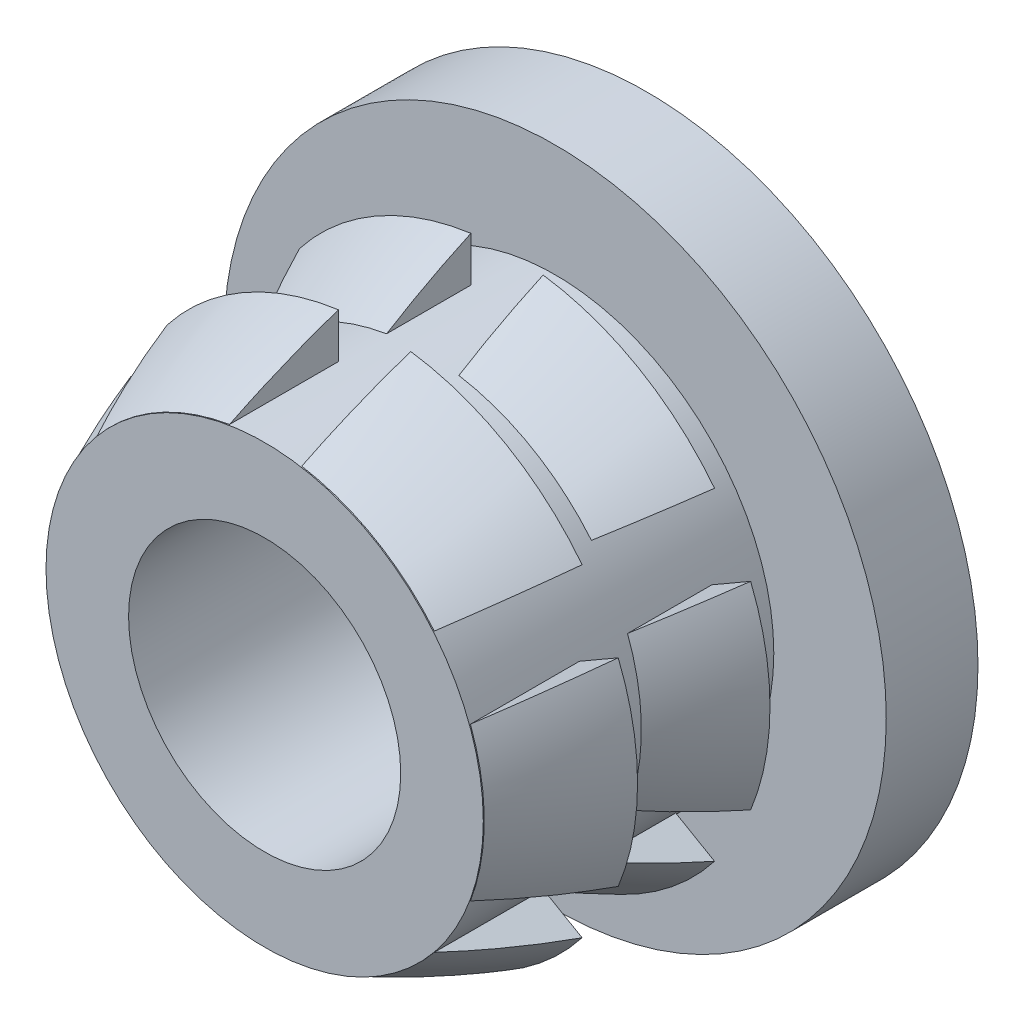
ISO-10303-21;
HEADER;
FILE_DESCRIPTION(('STEP AP214'),'2;1');
FILE_NAME('part.step','',(''),(''),'','','');
FILE_SCHEMA(('AUTOMOTIVE_DESIGN { 1 0 10303 214 1 1 1 1 }'));
ENDSEC;
DATA;
#1=APPLICATION_CONTEXT('core data for automotive mechanical design processes');
#2=APPLICATION_PROTOCOL_DEFINITION('international standard','automotive_design',2000,#1);
#3=PRODUCT_CONTEXT('',#1,'mechanical');
#4=PRODUCT('Part','Part','',(#3));
#5=PRODUCT_RELATED_PRODUCT_CATEGORY('part','',(#4));
#6=PRODUCT_DEFINITION_FORMATION('','',#4);
#7=PRODUCT_DEFINITION_CONTEXT('part definition',#1,'design');
#8=PRODUCT_DEFINITION('design','',#6,#7);
#9=PRODUCT_DEFINITION_SHAPE('','',#8);
#10=(LENGTH_UNIT() NAMED_UNIT(*) SI_UNIT(.MILLI.,.METRE.));
#11=(NAMED_UNIT(*) PLANE_ANGLE_UNIT() SI_UNIT($,.RADIAN.));
#12=(NAMED_UNIT(*) SI_UNIT($,.STERADIAN.) SOLID_ANGLE_UNIT());
#13=UNCERTAINTY_MEASURE_WITH_UNIT(LENGTH_MEASURE(1.E-05),#10,'distance_accuracy_value','');
#14=(GEOMETRIC_REPRESENTATION_CONTEXT(3) GLOBAL_UNCERTAINTY_ASSIGNED_CONTEXT((#13)) GLOBAL_UNIT_ASSIGNED_CONTEXT((#10,
#11,#12)) REPRESENTATION_CONTEXT('',''));
#15=CARTESIAN_POINT('',(0.,0.,0.));
#16=DIRECTION('',(0.,0.,1.));
#17=DIRECTION('',(1.,0.,0.));
#18=AXIS2_PLACEMENT_3D('',#15,#16,#17);
#19=CARTESIAN_POINT('',(10.75384757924,0.,-16.6204107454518));
#20=DIRECTION('',(0.,0.,1.));
#21=DIRECTION('',(1.,0.,0.));
#22=AXIS2_PLACEMENT_3D('',#19,#20,#21);
#23=PLANE('',#22);
#24=CARTESIAN_POINT('',(8.93774757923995,0.,-16.6204107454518));
#25=DIRECTION('',(0.,0.,-1.));
#26=DIRECTION('',(-1.,0.,0.));
#27=AXIS2_PLACEMENT_3D('',#24,#25,#26);
#28=CIRCLE('',#27,1.8161);
#29=CARTESIAN_POINT('',(7.53656596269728,1.15538274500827,-16.6204107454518));
#30=VERTEX_POINT('',#29);
#31=CARTESIAN_POINT('',(8.63774757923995,1.79115024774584,-16.6204107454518));
#32=VERTEX_POINT('',#31);
#33=EDGE_CURVE('E298',#30,#32,#28,.T.);
#34=ORIENTED_EDGE('',*,*,#33,.F.);
#35=DIRECTION('',(-0.866025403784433,0.50000000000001,0.));
#36=VECTOR('',#35,1.);
#37=CARTESIAN_POINT('',(10.4498225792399,-0.526586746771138,-16.6204107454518));
#38=LINE('',#37,#36);
#39=CARTESIAN_POINT('',(7.21392727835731,1.34165827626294,-16.6204107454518));
#40=VERTEX_POINT('',#39);
#41=EDGE_CURVE('E546',#30,#40,#38,.T.);
#42=ORIENTED_EDGE('',*,*,#41,.T.);
#43=CARTESIAN_POINT('',(8.93774757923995,0.,-16.6204107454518));
#44=DIRECTION('',(0.,0.,-1.));
#45=DIRECTION('',(-1.,0.,0.));
#46=AXIS2_PLACEMENT_3D('',#43,#44,#45);
#47=CIRCLE('',#46,2.18439999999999);
#48=CARTESIAN_POINT('',(8.63774757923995,2.16370131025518,-16.6204107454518));
#49=VERTEX_POINT('',#48);
#50=EDGE_CURVE('E345',#40,#49,#47,.T.);
#51=ORIENTED_EDGE('',*,*,#50,.T.);
#52=DIRECTION('',(0.,-1.,0.));
#53=VECTOR('',#52,1.);
#54=CARTESIAN_POINT('',(8.63774757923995,0.,-16.6204107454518));
#55=LINE('',#54,#53);
#56=EDGE_CURVE('E710',#49,#32,#55,.T.);
#57=ORIENTED_EDGE('',*,*,#56,.T.);
#58=EDGE_LOOP('',(#34,#42,#51,#57));
#59=FACE_BOUND('',#58,.T.);
#60=ADVANCED_FACE('F41',(#59),#23,.F.);
#61=CARTESIAN_POINT('',(8.93774757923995,0.,-19.2860468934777));
#62=DIRECTION('',(0.,0.,-1.));
#63=DIRECTION('',(-1.,0.,0.));
#64=AXIS2_PLACEMENT_3D('',#61,#62,#63);
#65=DEGENERATE_TOROIDAL_SURFACE('',#64,3.73134191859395,6.48857600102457,.F.);
#66=ORIENTED_EDGE('',*,*,#50,.F.);
#67=CARTESIAN_POINT('',(7.2138484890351,1.34170376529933,-16.6206107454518));
#68=CARTESIAN_POINT('',(7.26135249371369,1.31427731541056,-16.5000058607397));
#69=CARTESIAN_POINT('',(7.31200647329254,1.28503222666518,-16.3813367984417));
#70=CARTESIAN_POINT('',(7.41961447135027,1.22290472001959,-16.1478701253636));
#71=CARTESIAN_POINT('',(7.4765685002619,1.19002229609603,-16.0330725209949));
#72=CARTESIAN_POINT('',(7.53667251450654,1.15532122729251,-15.9202107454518));
#73=B_SPLINE_CURVE_WITH_KNOTS('',3,(#67,#68,#69,#70,#71,#72),.UNSPECIFIED.,.F.,.F.,(4,2,4),(0.,
0.39690178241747,0.793804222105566),.UNSPECIFIED.);
#74=CARTESIAN_POINT('',(7.53656596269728,1.15538274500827,-15.9204107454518));
#75=VERTEX_POINT('',#74);
#76=EDGE_CURVE('E541',#40,#75,#73,.T.);
#77=ORIENTED_EDGE('',*,*,#76,.T.);
#78=CARTESIAN_POINT('',(8.93774757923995,0.,-15.9204107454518));
#79=DIRECTION('',(0.,0.,-1.));
#80=DIRECTION('',(-1.,0.,0.));
#81=AXIS2_PLACEMENT_3D('',#78,#79,#80);
#82=CIRCLE('',#81,1.8161);
#83=CARTESIAN_POINT('',(8.63774757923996,1.79115024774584,-15.9204107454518));
#84=VERTEX_POINT('',#83);
#85=EDGE_CURVE('E341',#75,#84,#82,.T.);
#86=ORIENTED_EDGE('',*,*,#85,.T.);
#87=CARTESIAN_POINT('',(8.63774757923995,1.98832530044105,-16.2646102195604));
#88=CARTESIAN_POINT('',(8.63774757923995,2.07290769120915,-16.423559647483));
#89=CARTESIAN_POINT('',(8.63774757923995,2.15076258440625,-16.5861112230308));
#90=CARTESIAN_POINT('',(8.63774757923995,2.29254275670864,-16.9172554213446));
#91=CARTESIAN_POINT('',(8.63774757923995,2.35646153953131,-17.0858508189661));
#92=CARTESIAN_POINT('',(8.63774757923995,2.47000143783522,-17.4280603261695));
#93=CARTESIAN_POINT('',(8.63774757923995,2.51960188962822,-17.6016812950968));
#94=CARTESIAN_POINT('',(8.63774757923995,2.60407025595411,-17.9525392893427));
#95=CARTESIAN_POINT('',(8.63774757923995,2.63893256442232,-18.1297776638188));
#96=CARTESIAN_POINT('',(8.63774757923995,2.69363711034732,-18.4863654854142));
#97=CARTESIAN_POINT('',(8.63774757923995,2.71349517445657,-18.6657125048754));
#98=CARTESIAN_POINT('',(8.63774757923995,2.73812468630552,-19.0255203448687));
#99=CARTESIAN_POINT('',(8.63774757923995,2.74288935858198,-19.2059816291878));
#100=CARTESIAN_POINT('',(8.63774757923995,2.73728385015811,-19.5664922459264));
#101=CARTESIAN_POINT('',(8.63774757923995,2.72692847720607,-19.7465418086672));
#102=CARTESIAN_POINT('',(8.63774757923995,2.6911870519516,-20.1050612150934));
#103=CARTESIAN_POINT('',(8.63774757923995,2.66580773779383,-20.2835317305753));
#104=CARTESIAN_POINT('',(8.63774757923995,2.59998959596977,-20.6388165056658));
#105=CARTESIAN_POINT('',(8.63774757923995,2.55945865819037,-20.8156137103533));
#106=CARTESIAN_POINT('',(8.63774757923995,2.46364466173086,-21.1650935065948));
#107=CARTESIAN_POINT('',(8.63774757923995,2.40836717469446,-21.3377776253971));
#108=CARTESIAN_POINT('',(8.63774757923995,2.28330265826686,-21.6781724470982));
#109=CARTESIAN_POINT('',(8.63774757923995,2.21348890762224,-21.8458733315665));
#110=CARTESIAN_POINT('',(8.63774757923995,2.05989399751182,-22.1746702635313));
#111=CARTESIAN_POINT('',(8.63774757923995,1.97611917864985,-22.3357692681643));
#112=CARTESIAN_POINT('',(8.63774757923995,1.80942283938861,-22.6253329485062));
#113=CARTESIAN_POINT('',(8.63774757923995,1.72846102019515,-22.7549299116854));
#114=CARTESIAN_POINT('',(8.63774757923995,1.55727866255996,-23.0079167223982));
#115=CARTESIAN_POINT('',(8.63774757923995,1.46705546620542,-23.1313047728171));
#116=CARTESIAN_POINT('',(8.63774757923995,1.27798434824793,-23.370579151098));
#117=CARTESIAN_POINT('',(8.63774757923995,1.17916984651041,-23.4864917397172));
#118=CARTESIAN_POINT('',(8.63774757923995,1.02434953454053,-23.6541524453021));
#119=CARTESIAN_POINT('',(8.63774757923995,0.971659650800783,-23.7089892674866));
#120=CARTESIAN_POINT('',(8.63774757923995,0.863995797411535,-23.8163690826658));
#121=CARTESIAN_POINT('',(8.63774757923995,0.809022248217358,-23.8689124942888));
#122=CARTESIAN_POINT('',(8.63774757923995,0.709522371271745,-23.9594976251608));
#123=CARTESIAN_POINT('',(8.63774757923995,0.66550132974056,-23.9980951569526));
#124=CARTESIAN_POINT('',(8.63774757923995,0.575735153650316,-24.0733323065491));
#125=CARTESIAN_POINT('',(8.63774757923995,0.529988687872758,-24.10997035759));
#126=CARTESIAN_POINT('',(8.63774757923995,0.461364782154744,-24.161552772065));
#127=CARTESIAN_POINT('',(8.63774757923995,0.439334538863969,-24.1776243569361));
#128=CARTESIAN_POINT('',(8.63774757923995,0.394711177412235,-24.2089626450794));
#129=CARTESIAN_POINT('',(8.63774757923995,0.372118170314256,-24.2242295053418));
#130=CARTESIAN_POINT('',(8.63774757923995,0.326222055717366,-24.2536926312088));
#131=CARTESIAN_POINT('',(8.63774757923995,0.302918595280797,-24.2678883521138));
#132=CARTESIAN_POINT('',(8.63774757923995,0.25543262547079,-24.2947073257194));
#133=CARTESIAN_POINT('',(8.63774757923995,0.231250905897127,-24.3073319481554));
#134=CARTESIAN_POINT('',(8.63774757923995,0.182474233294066,-24.3298428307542));
#135=CARTESIAN_POINT('',(8.63774757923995,0.157912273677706,-24.3397986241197));
#136=CARTESIAN_POINT('',(8.63774757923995,0.107668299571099,-24.3560795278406));
#137=CARTESIAN_POINT('',(8.63774757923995,0.0819931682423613,-24.3624242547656));
#138=CARTESIAN_POINT('',(8.63774757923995,0.0426798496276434,-24.3681554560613));
#139=CARTESIAN_POINT('',(8.63774757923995,0.0293145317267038,-24.3694284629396));
#140=CARTESIAN_POINT('',(8.63774757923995,0.00252512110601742,-24.3705554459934));
#141=CARTESIAN_POINT('',(8.63774757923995,-0.0108989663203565,-24.3704095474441));
#142=CARTESIAN_POINT('',(8.63774757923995,-0.051078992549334,-24.3678247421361));
#143=CARTESIAN_POINT('',(8.63774757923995,-0.0777121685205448,-24.3632342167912));
#144=CARTESIAN_POINT('',(8.63774757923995,-0.121409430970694,-24.3518567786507));
#145=CARTESIAN_POINT('',(8.63774757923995,-0.138814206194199,-24.3462387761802));
#146=CARTESIAN_POINT('',(8.63774757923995,-0.173078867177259,-24.3335091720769));
#147=CARTESIAN_POINT('',(8.63774757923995,-0.189938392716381,-24.3263966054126));
#148=CARTESIAN_POINT('',(8.63774757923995,-0.223234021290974,-24.3110332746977));
#149=CARTESIAN_POINT('',(8.63774757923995,-0.23966723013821,-24.3027763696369));
#150=CARTESIAN_POINT('',(8.63774757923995,-0.27208473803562,-24.2854438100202));
#151=CARTESIAN_POINT('',(8.63774757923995,-0.288069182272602,-24.2763684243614));
#152=CARTESIAN_POINT('',(8.63774757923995,-0.336391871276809,-24.2476682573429));
#153=CARTESIAN_POINT('',(8.63774757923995,-0.368133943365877,-24.2270438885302));
#154=CARTESIAN_POINT('',(8.63774757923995,-0.430497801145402,-24.1841543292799));
#155=CARTESIAN_POINT('',(8.63774757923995,-0.461118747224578,-24.1618879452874));
#156=CARTESIAN_POINT('',(8.63774757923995,-0.52152452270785,-24.1161337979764));
#157=CARTESIAN_POINT('',(8.63774757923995,-0.551307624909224,-24.0926437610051));
#158=CARTESIAN_POINT('',(8.63774757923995,-0.610119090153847,-24.0447347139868));
#159=CARTESIAN_POINT('',(8.63774757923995,-0.639147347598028,-24.0203155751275));
#160=CARTESIAN_POINT('',(8.63774757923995,-0.7253305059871,-23.945813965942));
#161=CARTESIAN_POINT('',(8.63774757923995,-0.781481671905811,-23.8945663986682));
#162=CARTESIAN_POINT('',(8.63774757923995,-0.891352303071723,-23.7896822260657));
#163=CARTESIAN_POINT('',(8.63774757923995,-0.945074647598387,-23.7360486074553));
#164=CARTESIAN_POINT('',(8.63774757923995,-1.10275905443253,-23.5720767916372));
#165=CARTESIAN_POINT('',(8.63774757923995,-1.20340386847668,-23.4585215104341));
#166=CARTESIAN_POINT('',(8.63774757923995,-1.39598169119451,-23.2241275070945));
#167=CARTESIAN_POINT('',(8.63774757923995,-1.487906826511,-23.1032823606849));
#168=CARTESIAN_POINT('',(8.63774757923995,-1.66251925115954,-22.8555024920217));
#169=CARTESIAN_POINT('',(8.63774757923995,-1.74522715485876,-22.7285823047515));
#170=CARTESIAN_POINT('',(8.63774757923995,-1.90132316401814,-22.4691864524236));
#171=CARTESIAN_POINT('',(8.63774757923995,-1.97471352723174,-22.3367121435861));
#172=CARTESIAN_POINT('',(8.63774757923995,-2.12148236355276,-22.0480260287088));
#173=CARTESIAN_POINT('',(8.63774757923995,-2.19342748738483,-21.8910830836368));
#174=CARTESIAN_POINT('',(8.63774757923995,-2.32445897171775,-21.5718549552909));
#175=CARTESIAN_POINT('',(8.63774757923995,-2.38354037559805,-21.4095677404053));
#176=CARTESIAN_POINT('',(8.63774757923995,-2.48852514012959,-21.0805721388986));
#177=CARTESIAN_POINT('',(8.63774757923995,-2.53441281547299,-20.9138587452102));
#178=CARTESIAN_POINT('',(8.63774757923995,-2.61265311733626,-20.5772220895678));
#179=CARTESIAN_POINT('',(8.63774757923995,-2.64500063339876,-20.4072976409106));
#180=CARTESIAN_POINT('',(8.63774757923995,-2.69708973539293,-20.0576677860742));
#181=CARTESIAN_POINT('',(8.63774757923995,-2.71619570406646,-19.8778673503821));
#182=CARTESIAN_POINT('',(8.63774757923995,-2.73925454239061,-19.5172153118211));
#183=CARTESIAN_POINT('',(8.63774757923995,-2.74320033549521,-19.3363632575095));
#184=CARTESIAN_POINT('',(8.63774757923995,-2.73589618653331,-18.9751037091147));
#185=CARTESIAN_POINT('',(8.63774757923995,-2.72465782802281,-18.794695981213));
#186=CARTESIAN_POINT('',(8.63774757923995,-2.68708960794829,-18.4355418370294));
#187=CARTESIAN_POINT('',(8.63774757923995,-2.66076660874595,-18.2567947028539));
#188=CARTESIAN_POINT('',(8.63774757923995,-2.59307614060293,-17.9014370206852));
#189=CARTESIAN_POINT('',(8.63774757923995,-2.55164947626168,-17.724837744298));
#190=CARTESIAN_POINT('',(8.63774757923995,-2.45406204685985,-17.3758290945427));
#191=CARTESIAN_POINT('',(8.63774757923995,-2.39790684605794,-17.2034181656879));
#192=CARTESIAN_POINT('',(8.63774757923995,-2.27111498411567,-16.8636622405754));
#193=CARTESIAN_POINT('',(8.63774757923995,-2.20045311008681,-16.6963266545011));
#194=CARTESIAN_POINT('',(8.63774757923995,-2.04519300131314,-16.3683330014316));
#195=CARTESIAN_POINT('',(8.63774757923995,-1.96060117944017,-16.2076719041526));
#196=CARTESIAN_POINT('',(8.63774757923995,-1.79368465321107,-15.9211341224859));
#197=CARTESIAN_POINT('',(8.63774757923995,-1.71346834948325,-15.7940242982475));
#198=CARTESIAN_POINT('',(8.63774757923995,-1.54409394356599,-15.5458527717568));
#199=CARTESIAN_POINT('',(8.63774757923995,-1.45493342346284,-15.4247927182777));
#200=CARTESIAN_POINT('',(8.63774757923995,-1.26827786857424,-15.1899672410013));
#201=CARTESIAN_POINT('',(8.63774757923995,-1.17081477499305,-15.0761765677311));
#202=CARTESIAN_POINT('',(8.63774757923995,-1.01823000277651,-14.9115219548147));
#203=CARTESIAN_POINT('',(8.63774757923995,-0.966319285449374,-14.8576569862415));
#204=CARTESIAN_POINT('',(8.63774757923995,-0.860284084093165,-14.7521554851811));
#205=CARTESIAN_POINT('',(8.63774757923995,-0.806159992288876,-14.7005185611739));
#206=CARTESIAN_POINT('',(8.63774757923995,-0.707623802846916,-14.6109138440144));
#207=CARTESIAN_POINT('',(8.63774757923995,-0.663681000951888,-14.5724293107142));
#208=CARTESIAN_POINT('',(8.63774757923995,-0.574072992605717,-14.4974143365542));
#209=CARTESIAN_POINT('',(8.63774757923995,-0.528406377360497,-14.4608855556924));
#210=CARTESIAN_POINT('',(8.63774757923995,-0.459851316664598,-14.4094268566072));
#211=CARTESIAN_POINT('',(8.63774757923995,-0.437808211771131,-14.3933706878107));
#212=CARTESIAN_POINT('',(8.63774757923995,-0.39315660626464,-14.3620683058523));
#213=CARTESIAN_POINT('',(8.63774757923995,-0.370548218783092,-14.3468219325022));
#214=CARTESIAN_POINT('',(8.63774757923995,-0.324618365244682,-14.3174087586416));
#215=CARTESIAN_POINT('',(8.63774757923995,-0.301296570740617,-14.3032424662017));
#216=CARTESIAN_POINT('',(8.63774757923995,-0.253769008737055,-14.2764971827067));
#217=CARTESIAN_POINT('',(8.63774757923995,-0.229564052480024,-14.2639167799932));
#218=CARTESIAN_POINT('',(8.63774757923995,-0.180770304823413,-14.2415341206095));
#219=CARTESIAN_POINT('',(8.63774757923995,-0.156216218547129,-14.2316583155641));
#220=CARTESIAN_POINT('',(8.63774757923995,-0.105994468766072,-14.215563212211));
#221=CARTESIAN_POINT('',(8.63774757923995,-0.0803337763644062,-14.209323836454));
#222=CARTESIAN_POINT('',(8.63774757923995,-0.0410616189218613,-14.2037606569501));
#223=CARTESIAN_POINT('',(8.63774757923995,-0.0277154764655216,-14.2025457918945));
#224=CARTESIAN_POINT('',(8.63774757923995,-0.000970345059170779,-14.2015318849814));
#225=CARTESIAN_POINT('',(8.63774757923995,0.0124286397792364,-14.2017327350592));
#226=CARTESIAN_POINT('',(8.63774757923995,0.0525295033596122,-14.2044696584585));
#227=CARTESIAN_POINT('',(8.63774757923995,0.0791003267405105,-14.2091451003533));
#228=CARTESIAN_POINT('',(8.63774757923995,0.122845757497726,-14.2206676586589));
#229=CARTESIAN_POINT('',(8.63774757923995,0.140355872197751,-14.2263753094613));
#230=CARTESIAN_POINT('',(8.63774757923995,0.174824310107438,-14.2392903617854));
#231=CARTESIAN_POINT('',(8.63774757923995,0.191782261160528,-14.2464987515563));
#232=CARTESIAN_POINT('',(8.63774757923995,0.225269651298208,-14.2620556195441));
#233=CARTESIAN_POINT('',(8.63774757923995,0.241796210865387,-14.270410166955));
#234=CARTESIAN_POINT('',(8.63774757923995,0.274397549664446,-14.2879384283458));
#235=CARTESIAN_POINT('',(8.63774757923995,0.290472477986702,-14.2971118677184));
#236=CARTESIAN_POINT('',(8.63774757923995,0.339214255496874,-14.3261984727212));
#237=CARTESIAN_POINT('',(8.63774757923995,0.371275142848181,-14.3471228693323));
#238=CARTESIAN_POINT('',(8.63774757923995,0.434263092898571,-14.3906252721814));
#239=CARTESIAN_POINT('',(8.63774757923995,0.465189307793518,-14.4132044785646));
#240=CARTESIAN_POINT('',(8.63774757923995,0.526194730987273,-14.4595952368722));
#241=CARTESIAN_POINT('',(8.63774757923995,0.556272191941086,-14.4834090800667));
#242=CARTESIAN_POINT('',(8.63774757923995,0.615661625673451,-14.531975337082));
#243=CARTESIAN_POINT('',(8.63774757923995,0.644973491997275,-14.5567278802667));
#244=CARTESIAN_POINT('',(8.63774757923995,0.731984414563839,-14.6322381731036));
#245=CARTESIAN_POINT('',(8.63774757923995,0.788663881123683,-14.6841748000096));
#246=CARTESIAN_POINT('',(8.63774757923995,0.899546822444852,-14.790471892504));
#247=CARTESIAN_POINT('',(8.63774757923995,0.953753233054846,-14.8448293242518));
#248=CARTESIAN_POINT('',(8.63774757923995,1.10401277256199,-15.0018276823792));
#249=CARTESIAN_POINT('',(8.63774757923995,1.19739458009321,-15.1070436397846));
#250=CARTESIAN_POINT('',(8.63774757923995,1.3766659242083,-15.323776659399));
#251=CARTESIAN_POINT('',(8.63774757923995,1.46254960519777,-15.4352985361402));
#252=CARTESIAN_POINT('',(8.63774757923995,1.62639451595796,-15.6636474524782));
#253=CARTESIAN_POINT('',(8.63774757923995,1.70437282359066,-15.7804622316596));
#254=CARTESIAN_POINT('',(8.63774757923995,1.85237100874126,-16.018992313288));
#255=CARTESIAN_POINT('',(8.63774757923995,1.9223921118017,-16.1407068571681));
#256=CARTESIAN_POINT('',(8.63774757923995,1.98832530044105,-16.2646102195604));
#257=B_SPLINE_CURVE_WITH_KNOTS('',3,(#87,#88,#89,#90,#91,#92,#93,#94,#95,#96,#97,#98,#99,#100,
#101,#102,#103,#104,#105,#106,#107,#108,#109,#110,#111,#112,#113,#114,#115,#116,#117,#118,#119,
#120,#121,#122,#123,#124,#125,#126,#127,#128,#129,#130,#131,#132,#133,#134,#135,#136,#137,#138,
#139,#140,#141,#142,#143,#144,#145,#146,#147,#148,#149,#150,#151,#152,#153,#154,#155,#156,#157,
#158,#159,#160,#161,#162,#163,#164,#165,#166,#167,#168,#169,#170,#171,#172,#173,#174,#175,#176,
#177,#178,#179,#180,#181,#182,#183,#184,#185,#186,#187,#188,#189,#190,#191,#192,#193,#194,#195,
#196,#197,#198,#199,#200,#201,#202,#203,#204,#205,#206,#207,#208,#209,#210,#211,#212,#213,#214,
#215,#216,#217,#218,#219,#220,#221,#222,#223,#224,#225,#226,#227,#228,#229,#230,#231,#232,#233,
#234,#235,#236,#237,#238,#239,#240,#241,#242,#243,#244,#245,#246,#247,#248,#249,#250,#251,#252,
#253,#254,#255,#256),.UNSPECIFIED.,.T.,.F.,(4,2,2,2,2,2,2,2,2,2,2,2,2,2,2,2,2,2,2,2,2,2,2,2,2,2,
2,2,2,2,2,2,2,2,2,2,2,2,2,2,2,2,2,2,2,2,2,2,2,2,2,2,2,2,2,2,2,2,2,2,2,2,2,2,2,2,2,2,2,2,2,2,2,2,
2,2,2,2,2,2,2,2,2,2,4),(0.,0.540033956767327,1.08031911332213,1.62138013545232,2.16264678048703,
2.70334169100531,3.24427928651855,3.78468747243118,4.32485347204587,4.86835812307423,
5.41165771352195,5.95596498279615,6.50002571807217,6.95805761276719,7.41622132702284,
7.8726763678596,8.10076828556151,8.32881839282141,8.50441626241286,8.68015249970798,
8.76194845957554,8.84372840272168,8.9255496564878,9.0072990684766,9.08664760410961,
9.16556087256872,9.20576835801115,9.24597229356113,9.3264707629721,9.38127253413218,
9.43610979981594,9.49125364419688,9.54637943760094,9.65984750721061,9.77339888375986,
9.88716934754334,10.0009556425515,10.2289151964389,10.4565970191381,10.9113006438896,
11.3664110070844,11.8204821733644,12.2744431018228,12.7918089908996,13.3093738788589,
13.8275515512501,14.3459246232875,14.8877195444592,15.4297673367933,15.97140184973,
16.5127901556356,17.056323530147,17.5996518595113,18.1439326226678,18.6879635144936,
19.1385066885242,19.5891719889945,20.0381756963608,20.2625481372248,20.4868809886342,
20.6620789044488,20.8374232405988,20.9192229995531,21.0010065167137,21.0828282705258,
21.1645766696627,21.2438106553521,21.3226029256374,21.3627370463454,21.4028681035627,
21.4832339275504,21.5384187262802,21.5936399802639,21.6491658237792,21.7046731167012,
21.8194330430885,21.9342770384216,22.0493423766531,22.1644236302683,22.3949462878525,
22.6251877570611,23.0468224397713,23.4687835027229,23.8898126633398,24.3107768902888),.UNSPECIFIED.);
#258=EDGE_CURVE('E709',#84,#49,#257,.T.);
#259=ORIENTED_EDGE('',*,*,#258,.T.);
#260=EDGE_LOOP('',(#66,#77,#86,#259));
#261=FACE_BOUND('',#260,.T.);
#262=ADVANCED_FACE('F587',(#261),#65,.F.);
#263=CARTESIAN_POINT('',(10.75384757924,0.,-15.5204107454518));
#264=DIRECTION('',(0.,0.,1.));
#265=DIRECTION('',(1.,0.,0.));
#266=AXIS2_PLACEMENT_3D('',#263,#264,#265);
#267=PLANE('',#266);
#268=CARTESIAN_POINT('',(8.93774757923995,0.,-15.5204107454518));
#269=DIRECTION('',(0.,0.,-1.));
#270=DIRECTION('',(-1.,0.,0.));
#271=AXIS2_PLACEMENT_3D('',#268,#269,#270);
#272=CIRCLE('',#271,1.8161);
#273=CARTESIAN_POINT('',(7.53656596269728,1.15538274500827,-15.5204107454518));
#274=VERTEX_POINT('',#273);
#275=CARTESIAN_POINT('',(8.63774757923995,1.79115024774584,-15.5204107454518));
#276=VERTEX_POINT('',#275);
#277=EDGE_CURVE('E337',#274,#276,#272,.T.);
#278=ORIENTED_EDGE('',*,*,#277,.F.);
#279=DIRECTION('',(-0.866025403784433,0.50000000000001,0.));
#280=VECTOR('',#279,1.);
#281=CARTESIAN_POINT('',(10.4498225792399,-0.52658674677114,-15.5204107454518));
#282=LINE('',#281,#280);
#283=CARTESIAN_POINT('',(7.21392727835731,1.34165827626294,-15.5204107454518));
#284=VERTEX_POINT('',#283);
#285=EDGE_CURVE('E538',#274,#284,#282,.T.);
#286=ORIENTED_EDGE('',*,*,#285,.T.);
#287=CARTESIAN_POINT('',(8.93774757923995,0.,-15.5204107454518));
#288=DIRECTION('',(0.,0.,-1.));
#289=DIRECTION('',(-1.,0.,0.));
#290=AXIS2_PLACEMENT_3D('',#287,#288,#289);
#291=CIRCLE('',#290,2.1844);
#292=CARTESIAN_POINT('',(8.63774757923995,2.16370131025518,-15.5204107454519));
#293=VERTEX_POINT('',#292);
#294=EDGE_CURVE('E331',#284,#293,#291,.T.);
#295=ORIENTED_EDGE('',*,*,#294,.T.);
#296=DIRECTION('',(0.,-1.,0.));
#297=VECTOR('',#296,1.);
#298=CARTESIAN_POINT('',(8.63774757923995,0.,-15.5204107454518));
#299=LINE('',#298,#297);
#300=EDGE_CURVE('E712',#293,#276,#299,.T.);
#301=ORIENTED_EDGE('',*,*,#300,.T.);
#302=EDGE_LOOP('',(#278,#286,#295,#301));
#303=FACE_BOUND('',#302,.T.);
#304=ADVANCED_FACE('F593',(#303),#267,.F.);
#305=CARTESIAN_POINT('',(8.93774757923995,0.,-17.8385896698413));
#306=DIRECTION('',(0.,0.,-1.));
#307=DIRECTION('',(-1.,0.,0.));
#308=AXIS2_PLACEMENT_3D('',#305,#306,#307);
#309=DEGENERATE_TOROIDAL_SURFACE('',#308,4.8080264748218,7.3666804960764,.F.);
#310=ORIENTED_EDGE('',*,*,#294,.F.);
#311=CARTESIAN_POINT('',(7.21386930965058,1.34169174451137,-15.5206107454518));
#312=CARTESIAN_POINT('',(7.25881794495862,1.31574063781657,-15.3655036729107));
#313=CARTESIAN_POINT('',(7.30819074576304,1.2872352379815,-15.2124995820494));
#314=CARTESIAN_POINT('',(7.41578476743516,1.2251158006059,-14.9106971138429));
#315=CARTESIAN_POINT('',(7.47400600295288,1.19150175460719,-14.7618987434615));
#316=CARTESIAN_POINT('',(7.53665141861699,1.15533340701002,-14.6152033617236));
#317=B_SPLINE_CURVE_WITH_KNOTS('',3,(#311,#312,#313,#314,#315,#316),.UNSPECIFIED.,.F.,.F.,(4,2,
4),(0.,0.489841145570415,0.979683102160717),.UNSPECIFIED.);
#318=CARTESIAN_POINT('',(7.53656596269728,1.15538274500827,-14.6154033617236));
#319=VERTEX_POINT('',#318);
#320=EDGE_CURVE('E292',#284,#319,#317,.T.);
#321=ORIENTED_EDGE('',*,*,#320,.T.);
#322=CARTESIAN_POINT('',(8.93774757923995,0.,-14.6154033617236));
#323=DIRECTION('',(0.,0.,-1.));
#324=DIRECTION('',(-1.,0.,0.));
#325=AXIS2_PLACEMENT_3D('',#322,#323,#324);
#326=CIRCLE('',#325,1.8161);
#327=CARTESIAN_POINT('',(8.63774757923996,1.79115024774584,-14.6154033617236));
#328=VERTEX_POINT('',#327);
#329=EDGE_CURVE('E333',#319,#328,#326,.T.);
#330=ORIENTED_EDGE('',*,*,#329,.T.);
#331=CARTESIAN_POINT('',(8.63774757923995,1.99273815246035,-15.0616040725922));
#332=CARTESIAN_POINT('',(8.63774757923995,2.07059825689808,-15.2507812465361));
#333=CARTESIAN_POINT('',(8.63774757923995,2.14044196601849,-15.4432627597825));
#334=CARTESIAN_POINT('',(8.63774757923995,2.26368778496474,-15.8334635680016));
#335=CARTESIAN_POINT('',(8.63774757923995,2.31708605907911,-16.0311840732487));
#336=CARTESIAN_POINT('',(8.63774757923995,2.4071186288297,-16.4305491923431));
#337=CARTESIAN_POINT('',(8.63774757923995,2.4437413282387,-16.6321964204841));
#338=CARTESIAN_POINT('',(8.63774757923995,2.49993133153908,-17.0378377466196));
#339=CARTESIAN_POINT('',(8.63774757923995,2.51949986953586,-17.2418316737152));
#340=CARTESIAN_POINT('',(8.63774757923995,2.54144882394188,-17.6505433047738));
#341=CARTESIAN_POINT('',(8.63774757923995,2.54384590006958,-17.8552601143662));
#342=CARTESIAN_POINT('',(8.63774757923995,2.53147754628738,-18.2642673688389));
#343=CARTESIAN_POINT('',(8.63774757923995,2.51670436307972,-18.4685575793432));
#344=CARTESIAN_POINT('',(8.63774757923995,2.4700667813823,-18.8752820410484));
#345=CARTESIAN_POINT('',(8.63774757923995,2.43819381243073,-19.0777153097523));
#346=CARTESIAN_POINT('',(8.63774757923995,2.35757452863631,-19.4790986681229));
#347=CARTESIAN_POINT('',(8.63774757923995,2.3088358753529,-19.6780502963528));
#348=CARTESIAN_POINT('',(8.63774757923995,2.19446022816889,-20.0722814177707));
#349=CARTESIAN_POINT('',(8.63774757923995,2.12872741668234,-20.2675331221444));
#350=CARTESIAN_POINT('',(8.63774757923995,1.98088573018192,-20.6517924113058));
#351=CARTESIAN_POINT('',(8.63774757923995,1.89877317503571,-20.840798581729));
#352=CARTESIAN_POINT('',(8.63774757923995,1.71885417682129,-21.210641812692));
#353=CARTESIAN_POINT('',(8.63774757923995,1.62108419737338,-21.3914966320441));
#354=CARTESIAN_POINT('',(8.63774757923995,1.41020658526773,-21.743938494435));
#355=CARTESIAN_POINT('',(8.63774757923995,1.2971095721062,-21.9155318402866));
#356=CARTESIAN_POINT('',(8.63774757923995,1.1327863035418,-22.1415127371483));
#357=CARTESIAN_POINT('',(8.63774757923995,1.08816726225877,-22.2007756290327));
#358=CARTESIAN_POINT('',(8.63774757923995,0.996885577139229,-22.3177148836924));
#359=CARTESIAN_POINT('',(8.63774757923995,0.950222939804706,-22.3753912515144));
#360=CARTESIAN_POINT('',(8.63774757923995,0.854727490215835,-22.4890029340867));
#361=CARTESIAN_POINT('',(8.63774757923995,0.805892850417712,-22.5449367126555));
#362=CARTESIAN_POINT('',(8.63774757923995,0.705904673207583,-22.6546753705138));
#363=CARTESIAN_POINT('',(8.63774757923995,0.654751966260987,-22.708480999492));
#364=CARTESIAN_POINT('',(8.63774757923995,0.57572396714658,-22.7872335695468));
#365=CARTESIAN_POINT('',(8.63774757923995,0.548904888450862,-22.8132418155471));
#366=CARTESIAN_POINT('',(8.63774757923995,0.494398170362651,-22.8643664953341));
#367=CARTESIAN_POINT('',(8.63774757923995,0.466710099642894,-22.8894824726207));
#368=CARTESIAN_POINT('',(8.63774757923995,0.410314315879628,-22.9384487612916));
#369=CARTESIAN_POINT('',(8.63774757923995,0.381608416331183,-22.9623011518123));
#370=CARTESIAN_POINT('',(8.63774757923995,0.32278263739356,-23.0081748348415));
#371=CARTESIAN_POINT('',(8.63774757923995,0.292664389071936,-23.0301981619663));
#372=CARTESIAN_POINT('',(8.63774757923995,0.239091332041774,-23.0653527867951));
#373=CARTESIAN_POINT('',(8.63774757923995,0.216142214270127,-23.0792437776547));
#374=CARTESIAN_POINT('',(8.63774757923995,0.168810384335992,-23.1043719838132));
#375=CARTESIAN_POINT('',(8.63774757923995,0.144430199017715,-23.1156137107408));
#376=CARTESIAN_POINT('',(8.63774757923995,0.101018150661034,-23.1311663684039));
#377=CARTESIAN_POINT('',(8.63774757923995,0.0823792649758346,-23.1365348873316));
#378=CARTESIAN_POINT('',(8.63774757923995,0.0444874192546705,-23.1440854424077));
#379=CARTESIAN_POINT('',(8.63774757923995,0.025236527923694,-23.1462772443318));
#380=CARTESIAN_POINT('',(8.63774757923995,-0.0134322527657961,-23.1470132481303));
#381=CARTESIAN_POINT('',(8.63774757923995,-0.032850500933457,-23.1455400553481));
#382=CARTESIAN_POINT('',(8.63774757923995,-0.0711487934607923,-23.1392456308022));
#383=CARTESIAN_POINT('',(8.63774757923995,-0.0900273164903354,-23.1344157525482));
#384=CARTESIAN_POINT('',(8.63774757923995,-0.138891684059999,-23.118329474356));
#385=CARTESIAN_POINT('',(8.63774757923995,-0.168149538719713,-23.1049367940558));
#386=CARTESIAN_POINT('',(8.63774757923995,-0.210504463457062,-23.0821063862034));
#387=CARTESIAN_POINT('',(8.63774757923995,-0.224405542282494,-23.0740118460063));
#388=CARTESIAN_POINT('',(8.63774757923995,-0.251772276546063,-23.0571163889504));
#389=CARTESIAN_POINT('',(8.63774757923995,-0.265238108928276,-23.0483157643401));
#390=CARTESIAN_POINT('',(8.63774757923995,-0.30592069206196,-23.0205532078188));
#391=CARTESIAN_POINT('',(8.63774757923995,-0.332544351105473,-23.000730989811));
#392=CARTESIAN_POINT('',(8.63774757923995,-0.384693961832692,-22.9596815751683));
#393=CARTESIAN_POINT('',(8.63774757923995,-0.410219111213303,-22.9384533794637));
#394=CARTESIAN_POINT('',(8.63774757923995,-0.460469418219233,-22.8949698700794));
#395=CARTESIAN_POINT('',(8.63774757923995,-0.485192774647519,-22.872712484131));
#396=CARTESIAN_POINT('',(8.63774757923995,-0.533944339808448,-22.8274468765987));
#397=CARTESIAN_POINT('',(8.63774757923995,-0.557972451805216,-22.8044385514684));
#398=CARTESIAN_POINT('',(8.63774757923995,-0.629325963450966,-22.7343579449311));
#399=CARTESIAN_POINT('',(8.63774757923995,-0.675757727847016,-22.6863744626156));
#400=CARTESIAN_POINT('',(8.63774757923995,-0.766604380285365,-22.588670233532));
#401=CARTESIAN_POINT('',(8.63774757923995,-0.811021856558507,-22.5389518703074));
#402=CARTESIAN_POINT('',(8.63774757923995,-0.916276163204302,-22.416923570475));
#403=CARTESIAN_POINT('',(8.63774757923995,-0.976226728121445,-22.3438470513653));
#404=CARTESIAN_POINT('',(8.63774757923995,-1.09282500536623,-22.1950984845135));
#405=CARTESIAN_POINT('',(8.63774757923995,-1.14947203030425,-22.1194259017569));
#406=CARTESIAN_POINT('',(8.63774757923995,-1.31468590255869,-21.8887504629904));
#407=CARTESIAN_POINT('',(8.63774757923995,-1.41840133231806,-21.7302357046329));
#408=CARTESIAN_POINT('',(8.63774757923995,-1.61249883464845,-21.4058522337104));
#409=CARTESIAN_POINT('',(8.63774757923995,-1.70291499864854,-21.2400037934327));
#410=CARTESIAN_POINT('',(8.63774757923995,-1.87037191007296,-20.9017853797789));
#411=CARTESIAN_POINT('',(8.63774757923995,-1.9474192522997,-20.7294186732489));
#412=CARTESIAN_POINT('',(8.63774757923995,-2.08915430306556,-20.3759104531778));
#413=CARTESIAN_POINT('',(8.63774757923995,-2.15358244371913,-20.1946648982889));
#414=CARTESIAN_POINT('',(8.63774757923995,-2.26791851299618,-19.8275847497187));
#415=CARTESIAN_POINT('',(8.63774757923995,-2.31782151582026,-19.6417486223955));
#416=CARTESIAN_POINT('',(8.63774757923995,-2.40283340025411,-19.2665830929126));
#417=CARTESIAN_POINT('',(8.63774757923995,-2.43793169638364,-19.0772512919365));
#418=CARTESIAN_POINT('',(8.63774757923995,-2.49308505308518,-18.6964077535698));
#419=CARTESIAN_POINT('',(8.63774757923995,-2.5131397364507,-18.5048959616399));
#420=CARTESIAN_POINT('',(8.63774757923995,-2.53890497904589,-18.1083232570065));
#421=CARTESIAN_POINT('',(8.63774757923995,-2.54359205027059,-17.9031950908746));
#422=CARTESIAN_POINT('',(8.63774757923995,-2.53572810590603,-17.4933551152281));
#423=CARTESIAN_POINT('',(8.63774757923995,-2.52318399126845,-17.2886431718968));
#424=CARTESIAN_POINT('',(8.63774757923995,-2.48093147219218,-16.8807948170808));
#425=CARTESIAN_POINT('',(8.63774757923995,-2.45120631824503,-16.6776601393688));
#426=CARTESIAN_POINT('',(8.63774757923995,-2.3747856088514,-16.2746894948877));
#427=CARTESIAN_POINT('',(8.63774757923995,-2.32809662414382,-16.0748522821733));
#428=CARTESIAN_POINT('',(8.63774757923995,-2.21782825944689,-15.6790521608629));
#429=CARTESIAN_POINT('',(8.63774757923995,-2.15418373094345,-15.4831073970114));
#430=CARTESIAN_POINT('',(8.63774757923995,-2.01046480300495,-15.097285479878));
#431=CARTESIAN_POINT('',(8.63774757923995,-1.93038695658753,-14.9074096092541));
#432=CARTESIAN_POINT('',(8.63774757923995,-1.75446501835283,-14.5356267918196));
#433=CARTESIAN_POINT('',(8.63774757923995,-1.65865593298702,-14.3537032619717));
#434=CARTESIAN_POINT('',(8.63774757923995,-1.45164349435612,-13.998925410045));
#435=CARTESIAN_POINT('',(8.63774757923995,-1.34045022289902,-13.8260652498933));
#436=CARTESIAN_POINT('',(8.63774757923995,-1.17690315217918,-13.5955819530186));
#437=CARTESIAN_POINT('',(8.63774757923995,-1.13105995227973,-13.5332710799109));
#438=CARTESIAN_POINT('',(8.63774757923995,-1.03716932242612,-13.4103251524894));
#439=CARTESIAN_POINT('',(8.63774757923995,-0.989121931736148,-13.3496900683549));
#440=CARTESIAN_POINT('',(8.63774757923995,-0.890710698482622,-13.2302556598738));
#441=CARTESIAN_POINT('',(8.63774757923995,-0.84034519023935,-13.1714577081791));
#442=CARTESIAN_POINT('',(8.63774757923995,-0.737158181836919,-13.0560733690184));
#443=CARTESIAN_POINT('',(8.63774757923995,-0.684337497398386,-12.9994862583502));
#444=CARTESIAN_POINT('',(8.63774757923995,-0.602672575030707,-12.916548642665));
#445=CARTESIAN_POINT('',(8.63774757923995,-0.574924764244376,-12.8891166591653));
#446=CARTESIAN_POINT('',(8.63774757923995,-0.518535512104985,-12.8351547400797));
#447=CARTESIAN_POINT('',(8.63774757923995,-0.489893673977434,-12.8086252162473));
#448=CARTESIAN_POINT('',(8.63774757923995,-0.431571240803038,-12.7568318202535));
#449=CARTESIAN_POINT('',(8.63774757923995,-0.401892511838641,-12.7315658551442));
#450=CARTESIAN_POINT('',(8.63774757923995,-0.341102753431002,-12.6828371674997));
#451=CARTESIAN_POINT('',(8.63774757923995,-0.309993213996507,-12.6593726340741));
#452=CARTESIAN_POINT('',(8.63774757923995,-0.254981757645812,-12.6218880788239));
#453=CARTESIAN_POINT('',(8.63774757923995,-0.231607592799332,-12.6071031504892));
#454=CARTESIAN_POINT('',(8.63774757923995,-0.183404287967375,-12.5800550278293));
#455=CARTESIAN_POINT('',(8.63774757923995,-0.158576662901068,-12.5677892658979));
#456=CARTESIAN_POINT('',(8.63774757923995,-0.114389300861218,-12.5503954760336));
#457=CARTESIAN_POINT('',(8.63774757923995,-0.0954521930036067,-12.544230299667));
#458=CARTESIAN_POINT('',(8.63774757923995,-0.0568510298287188,-12.5350702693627));
#459=CARTESIAN_POINT('',(8.63774757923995,-0.0371897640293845,-12.5320643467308));
#460=CARTESIAN_POINT('',(8.63774757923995,0.00251424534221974,-12.5298556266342));
#461=CARTESIAN_POINT('',(8.63774757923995,0.0225587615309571,-12.5306823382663));
#462=CARTESIAN_POINT('',(8.63774757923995,0.06216574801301,-12.5360052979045));
#463=CARTESIAN_POINT('',(8.63774757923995,0.0817269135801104,-12.5405105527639));
#464=CARTESIAN_POINT('',(8.63774757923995,0.129986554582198,-12.5553821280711));
#465=CARTESIAN_POINT('',(8.63774757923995,0.158096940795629,-12.5675831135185));
#466=CARTESIAN_POINT('',(8.63774757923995,0.1988215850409,-12.5885901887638));
#467=CARTESIAN_POINT('',(8.63774757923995,0.212192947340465,-12.5960691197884));
#468=CARTESIAN_POINT('',(8.63774757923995,0.23852037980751,-12.6117265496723));
#469=CARTESIAN_POINT('',(8.63774757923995,0.251476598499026,-12.6199047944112));
#470=CARTESIAN_POINT('',(8.63774757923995,0.289707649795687,-12.6451574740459));
#471=CARTESIAN_POINT('',(8.63774757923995,0.314461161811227,-12.663013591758));
#472=CARTESIAN_POINT('',(8.63774757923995,0.362958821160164,-12.7000565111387));
#473=CARTESIAN_POINT('',(8.63774757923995,0.386702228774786,-12.7192442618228));
#474=CARTESIAN_POINT('',(8.63774757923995,0.45687268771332,-12.7782585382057));
#475=CARTESIAN_POINT('',(8.63774757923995,0.502137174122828,-12.8194625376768));
#476=CARTESIAN_POINT('',(8.63774757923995,0.590697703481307,-12.9042105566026));
#477=CARTESIAN_POINT('',(8.63774757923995,0.633985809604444,-12.947762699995));
#478=CARTESIAN_POINT('',(8.63774757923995,0.718758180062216,-13.0364727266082));
#479=CARTESIAN_POINT('',(8.63774757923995,0.760244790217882,-13.0816283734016));
#480=CARTESIAN_POINT('',(8.63774757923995,0.864127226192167,-13.1985705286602));
#481=CARTESIAN_POINT('',(8.63774757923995,0.925443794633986,-13.2713168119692));
#482=CARTESIAN_POINT('',(8.63774757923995,1.044692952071,-13.4195415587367));
#483=CARTESIAN_POINT('',(8.63774757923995,1.10262470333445,-13.495020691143));
#484=CARTESIAN_POINT('',(8.63774757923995,1.27163007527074,-13.7252728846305));
#485=CARTESIAN_POINT('',(8.63774757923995,1.37777445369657,-13.8837014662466));
#486=CARTESIAN_POINT('',(8.63774757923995,1.57660486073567,-14.2082123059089));
#487=CARTESIAN_POINT('',(8.63774757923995,1.66932279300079,-14.3742751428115));
#488=CARTESIAN_POINT('',(8.63774757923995,1.84123880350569,-14.7131461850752));
#489=CARTESIAN_POINT('',(8.63774757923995,1.92044408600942,-14.8859507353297));
#490=CARTESIAN_POINT('',(8.63774757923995,1.99273815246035,-15.0616040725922));
#491=B_SPLINE_CURVE_WITH_KNOTS('',3,(#331,#332,#333,#334,#335,#336,#337,#338,#339,#340,#341,
#342,#343,#344,#345,#346,#347,#348,#349,#350,#351,#352,#353,#354,#355,#356,#357,#358,#359,#360,
#361,#362,#363,#364,#365,#366,#367,#368,#369,#370,#371,#372,#373,#374,#375,#376,#377,#378,#379,
#380,#381,#382,#383,#384,#385,#386,#387,#388,#389,#390,#391,#392,#393,#394,#395,#396,#397,#398,
#399,#400,#401,#402,#403,#404,#405,#406,#407,#408,#409,#410,#411,#412,#413,#414,#415,#416,#417,
#418,#419,#420,#421,#422,#423,#424,#425,#426,#427,#428,#429,#430,#431,#432,#433,#434,#435,#436,
#437,#438,#439,#440,#441,#442,#443,#444,#445,#446,#447,#448,#449,#450,#451,#452,#453,#454,#455,
#456,#457,#458,#459,#460,#461,#462,#463,#464,#465,#466,#467,#468,#469,#470,#471,#472,#473,#474,
#475,#476,#477,#478,#479,#480,#481,#482,#483,#484,#485,#486,#487,#488,#489,#490),.UNSPECIFIED.,
.T.,.F.,(4,2,2,2,2,2,2,2,2,2,2,2,2,2,2,2,2,2,2,2,2,2,2,2,2,2,2,2,2,2,2,2,2,2,2,2,2,2,2,2,2,2,2,
2,2,2,2,2,2,2,2,2,2,2,2,2,2,2,2,2,2,2,2,2,2,2,2,2,2,2,2,2,2,2,2,2,2,2,2,4),(0.,
0.613546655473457,1.2272363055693,1.84134953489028,2.45541832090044,3.06889125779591,
3.68264131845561,4.29669928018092,4.91047865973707,5.52779717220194,6.14525453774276,
6.76129431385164,7.37690942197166,7.59942409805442,7.82193806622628,8.04464293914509,
8.26726864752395,8.37933091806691,8.49144971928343,8.60337791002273,8.71517987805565,
8.79556603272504,8.87581428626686,8.93379649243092,8.99160007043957,9.04967851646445,
9.10790712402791,9.20386074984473,9.25211838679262,9.30035615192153,9.39985231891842,
9.49941996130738,9.59919764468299,9.69898914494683,9.89922422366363,10.0991942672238,
10.3826431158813,10.6661507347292,11.2337386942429,11.7998453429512,12.365671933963,
12.9421351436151,13.5187936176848,14.0958637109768,14.6729482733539,15.2877607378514,
15.9023270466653,16.5174934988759,17.1324219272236,17.7497480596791,18.3672038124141,
18.983303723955,19.599001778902,19.8310407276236,20.06307554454,20.2952797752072,
20.5274074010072,20.6444486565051,20.7615426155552,20.8784357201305,20.9952097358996,
21.0781015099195,21.1609083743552,21.2204592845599,21.2798008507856,21.3396000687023,
21.3995461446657,21.4909303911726,21.5368896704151,21.5828323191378,21.6743213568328,
21.7658762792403,21.9493640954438,22.1335335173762,22.3174554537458,22.6027543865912,
22.8881236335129,23.4594948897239,24.029485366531,24.5991709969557),.UNSPECIFIED.);
#492=EDGE_CURVE('E440',#328,#293,#491,.T.);
#493=ORIENTED_EDGE('',*,*,#492,.T.);
#494=EDGE_LOOP('',(#310,#321,#330,#493));
#495=FACE_BOUND('',#494,.T.);
#496=ADVANCED_FACE('F434',(#495),#309,.F.);
#497=CARTESIAN_POINT('',(6.91392727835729,-0.822043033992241,-16.6204107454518));
#498=VERTEX_POINT('',#497);
#499=CARTESIAN_POINT('',(6.9139272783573,0.822043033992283,-16.6204107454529));
#500=VERTEX_POINT('',#499);
#501=EDGE_CURVE('E291',#498,#500,#47,.T.);
#502=ORIENTED_EDGE('',*,*,#501,.T.);
#503=DIRECTION('',(0.866025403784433,-0.50000000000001,0.));
#504=VECTOR('',#503,1.);
#505=CARTESIAN_POINT('',(10.1498225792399,-1.0462019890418,-16.6204107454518));
#506=LINE('',#505,#504);
#507=CARTESIAN_POINT('',(7.23656596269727,0.635767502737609,-16.6204107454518));
#508=VERTEX_POINT('',#507);
#509=EDGE_CURVE('E278',#500,#508,#506,.T.);
#510=ORIENTED_EDGE('',*,*,#509,.T.);
#511=CARTESIAN_POINT('',(7.23656596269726,-0.635767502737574,-16.6204107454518));
#512=VERTEX_POINT('',#511);
#513=EDGE_CURVE('E289',#512,#508,#28,.T.);
#514=ORIENTED_EDGE('',*,*,#513,.F.);
#515=DIRECTION('',(-0.866025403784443,-0.499999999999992,0.));
#516=VECTOR('',#515,1.);
#517=CARTESIAN_POINT('',(10.14982257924,1.04620198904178,-16.6204107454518));
#518=LINE('',#517,#516);
#519=EDGE_CURVE('E1181',#512,#498,#518,.T.);
#520=ORIENTED_EDGE('',*,*,#519,.T.);
#521=EDGE_LOOP('',(#502,#510,#514,#520));
#522=FACE_BOUND('',#521,.T.);
#523=ADVANCED_FACE('F287',(#522),#23,.F.);
#524=CARTESIAN_POINT('',(7.23656596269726,-0.635767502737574,-15.9204107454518));
#525=VERTEX_POINT('',#524);
#526=CARTESIAN_POINT('',(7.23656596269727,0.63576750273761,-15.9204107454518));
#527=VERTEX_POINT('',#526);
#528=EDGE_CURVE('E353',#525,#527,#82,.T.);
#529=ORIENTED_EDGE('',*,*,#528,.T.);
#530=CARTESIAN_POINT('',(7.23667251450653,0.635705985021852,-15.9202107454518));
#531=CARTESIAN_POINT('',(7.17656850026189,0.67040705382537,-16.0330725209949));
#532=CARTESIAN_POINT('',(7.11961447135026,0.703289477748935,-16.1478701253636));
#533=CARTESIAN_POINT('',(7.01200647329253,0.765416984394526,-16.3813367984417));
#534=CARTESIAN_POINT('',(6.96135249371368,0.7946620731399,-16.5000058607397));
#535=CARTESIAN_POINT('',(6.91384848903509,0.82208852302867,-16.6206107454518));
#536=B_SPLINE_CURVE_WITH_KNOTS('',3,(#530,#531,#532,#533,#534,#535),.UNSPECIFIED.,.F.,.F.,(4,2,
4),(0.,0.396902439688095,0.793804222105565),.UNSPECIFIED.);
#537=EDGE_CURVE('E280',#527,#500,#536,.T.);
#538=ORIENTED_EDGE('',*,*,#537,.T.);
#539=ORIENTED_EDGE('',*,*,#501,.F.);
#540=CARTESIAN_POINT('',(6.91384848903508,-0.822088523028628,-16.6206107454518));
#541=CARTESIAN_POINT('',(6.96135249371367,-0.794662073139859,-16.5000058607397));
#542=CARTESIAN_POINT('',(7.01200647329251,-0.765416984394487,-16.3813367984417));
#543=CARTESIAN_POINT('',(7.11961447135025,-0.703289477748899,-16.1478701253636));
#544=CARTESIAN_POINT('',(7.17656850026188,-0.670407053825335,-16.0330725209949));
#545=CARTESIAN_POINT('',(7.23667251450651,-0.635705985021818,-15.9202107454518));
#546=B_SPLINE_CURVE_WITH_KNOTS('',3,(#540,#541,#542,#543,#544,#545),.UNSPECIFIED.,.F.,.F.,(4,2,
4),(0.,0.396901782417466,0.793804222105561),.UNSPECIFIED.);
#547=EDGE_CURVE('E1182',#498,#525,#546,.T.);
#548=ORIENTED_EDGE('',*,*,#547,.T.);
#549=EDGE_LOOP('',(#529,#538,#539,#548));
#550=FACE_BOUND('',#549,.T.);
#551=ADVANCED_FACE('F594',(#550),#65,.F.);
#552=CARTESIAN_POINT('',(6.91392727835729,-0.822043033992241,-15.5204107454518));
#553=VERTEX_POINT('',#552);
#554=CARTESIAN_POINT('',(6.9139272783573,0.822043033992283,-15.5204107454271));
#555=VERTEX_POINT('',#554);
#556=EDGE_CURVE('E1169',#553,#555,#291,.T.);
#557=ORIENTED_EDGE('',*,*,#556,.T.);
#558=DIRECTION('',(0.866025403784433,-0.50000000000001,0.));
#559=VECTOR('',#558,1.);
#560=CARTESIAN_POINT('',(10.1498225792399,-1.0462019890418,-15.5204107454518));
#561=LINE('',#560,#559);
#562=CARTESIAN_POINT('',(7.23656596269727,0.635767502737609,-15.5204107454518));
#563=VERTEX_POINT('',#562);
#564=EDGE_CURVE('E520',#555,#563,#561,.T.);
#565=ORIENTED_EDGE('',*,*,#564,.T.);
#566=CARTESIAN_POINT('',(7.23656596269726,-0.635767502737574,-15.5204107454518));
#567=VERTEX_POINT('',#566);
#568=EDGE_CURVE('E729',#567,#563,#272,.T.);
#569=ORIENTED_EDGE('',*,*,#568,.F.);
#570=DIRECTION('',(-0.866025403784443,-0.499999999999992,0.));
#571=VECTOR('',#570,1.);
#572=CARTESIAN_POINT('',(10.14982257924,1.04620198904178,-15.5204107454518));
#573=LINE('',#572,#571);
#574=EDGE_CURVE('E1170',#567,#553,#573,.T.);
#575=ORIENTED_EDGE('',*,*,#574,.T.);
#576=EDGE_LOOP('',(#557,#565,#569,#575));
#577=FACE_BOUND('',#576,.T.);
#578=ADVANCED_FACE('F641',(#577),#267,.F.);
#579=CARTESIAN_POINT('',(7.23656596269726,-0.635767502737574,-14.6154033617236));
#580=VERTEX_POINT('',#579);
#581=CARTESIAN_POINT('',(7.23656596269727,0.635767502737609,-14.6154033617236));
#582=VERTEX_POINT('',#581);
#583=EDGE_CURVE('E791',#580,#582,#326,.T.);
#584=ORIENTED_EDGE('',*,*,#583,.T.);
#585=CARTESIAN_POINT('',(7.23665141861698,0.635718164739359,-14.6152033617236));
#586=CARTESIAN_POINT('',(7.17400600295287,0.67188651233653,-14.7618987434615));
#587=CARTESIAN_POINT('',(7.11578476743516,0.705500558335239,-14.9106971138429));
#588=CARTESIAN_POINT('',(7.00819074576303,0.767619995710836,-15.2124995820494));
#589=CARTESIAN_POINT('',(6.95881794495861,0.796125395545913,-15.3655036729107));
#590=CARTESIAN_POINT('',(6.91386930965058,0.822076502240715,-15.5206107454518));
#591=B_SPLINE_CURVE_WITH_KNOTS('',3,(#585,#586,#587,#588,#589,#590),.UNSPECIFIED.,.F.,.F.,(4,2,
4),(0.,0.489841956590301,0.979683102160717),.UNSPECIFIED.);
#592=EDGE_CURVE('E512',#582,#555,#591,.T.);
#593=ORIENTED_EDGE('',*,*,#592,.T.);
#594=ORIENTED_EDGE('',*,*,#556,.F.);
#595=CARTESIAN_POINT('',(6.91386930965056,-0.822076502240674,-15.5206107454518));
#596=CARTESIAN_POINT('',(6.9588179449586,-0.796125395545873,-15.3655036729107));
#597=CARTESIAN_POINT('',(7.00819074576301,-0.767619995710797,-15.2124995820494));
#598=CARTESIAN_POINT('',(7.11578476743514,-0.705500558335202,-14.9106971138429));
#599=CARTESIAN_POINT('',(7.17400600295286,-0.671886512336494,-14.7618987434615));
#600=CARTESIAN_POINT('',(7.23665141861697,-0.635718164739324,-14.6152033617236));
#601=B_SPLINE_CURVE_WITH_KNOTS('',3,(#595,#596,#597,#598,#599,#600),.UNSPECIFIED.,.F.,.F.,(4,2,
4),(0.,0.489841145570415,0.979683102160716),.UNSPECIFIED.);
#602=EDGE_CURVE('E505',#553,#580,#601,.T.);
#603=ORIENTED_EDGE('',*,*,#602,.T.);
#604=EDGE_LOOP('',(#584,#593,#594,#603));
#605=FACE_BOUND('',#604,.T.);
#606=ADVANCED_FACE('F634',(#605),#309,.F.);
#607=CARTESIAN_POINT('',(8.63774757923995,-2.16370131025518,-16.6204107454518));
#608=VERTEX_POINT('',#607);
#609=CARTESIAN_POINT('',(7.21392727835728,-1.34165827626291,-16.6204107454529));
#610=VERTEX_POINT('',#609);
#611=EDGE_CURVE('E644',#608,#610,#47,.T.);
#612=ORIENTED_EDGE('',*,*,#611,.T.);
#613=DIRECTION('',(0.866025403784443,0.499999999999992,0.));
#614=VECTOR('',#613,1.);
#615=CARTESIAN_POINT('',(10.44982257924,0.526586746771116,-16.6204107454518));
#616=LINE('',#615,#614);
#617=CARTESIAN_POINT('',(7.53656596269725,-1.15538274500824,-16.6204107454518));
#618=VERTEX_POINT('',#617);
#619=EDGE_CURVE('E564',#610,#618,#616,.T.);
#620=ORIENTED_EDGE('',*,*,#619,.T.);
#621=CARTESIAN_POINT('',(8.63774757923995,-1.79115024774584,-16.6204107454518));
#622=VERTEX_POINT('',#621);
#623=EDGE_CURVE('E297',#622,#618,#28,.T.);
#624=ORIENTED_EDGE('',*,*,#623,.F.);
#625=DIRECTION('',(0.,-1.,0.));
#626=VECTOR('',#625,1.);
#627=CARTESIAN_POINT('',(8.63774757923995,0.,-16.6204107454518));
#628=LINE('',#627,#626);
#629=EDGE_CURVE('E645',#622,#608,#628,.T.);
#630=ORIENTED_EDGE('',*,*,#629,.T.);
#631=EDGE_LOOP('',(#612,#620,#624,#630));
#632=FACE_BOUND('',#631,.T.);
#633=ADVANCED_FACE('F598',(#632),#23,.F.);
#634=CARTESIAN_POINT('',(8.63774757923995,-1.79115024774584,-15.9204107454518));
#635=VERTEX_POINT('',#634);
#636=CARTESIAN_POINT('',(7.53656596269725,-1.15538274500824,-15.9204107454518));
#637=VERTEX_POINT('',#636);
#638=EDGE_CURVE('E359',#635,#637,#82,.T.);
#639=ORIENTED_EDGE('',*,*,#638,.T.);
#640=CARTESIAN_POINT('',(7.53667251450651,-1.15532122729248,-15.9202107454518));
#641=CARTESIAN_POINT('',(7.47656850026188,-1.190022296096,-16.0330725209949));
#642=CARTESIAN_POINT('',(7.41961447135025,-1.22290472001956,-16.1478701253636));
#643=CARTESIAN_POINT('',(7.31200647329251,-1.28503222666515,-16.3813367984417));
#644=CARTESIAN_POINT('',(7.26135249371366,-1.31427731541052,-16.5000058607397));
#645=CARTESIAN_POINT('',(7.21384848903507,-1.34170376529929,-16.6206107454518));
#646=B_SPLINE_CURVE_WITH_KNOTS('',3,(#640,#641,#642,#643,#644,#645),.UNSPECIFIED.,.F.,.F.,(4,2,
4),(0.,0.396902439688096,0.793804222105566),.UNSPECIFIED.);
#647=EDGE_CURVE('E562',#637,#610,#646,.T.);
#648=ORIENTED_EDGE('',*,*,#647,.T.);
#649=ORIENTED_EDGE('',*,*,#611,.F.);
#650=CARTESIAN_POINT('',(8.63774757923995,-1.98832530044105,-16.2646102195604));
#651=CARTESIAN_POINT('',(8.63774757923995,-1.90588347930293,-16.109685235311));
#652=CARTESIAN_POINT('',(8.63774757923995,-1.81702705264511,-15.9581368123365));
#653=CARTESIAN_POINT('',(8.63774757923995,-1.62690692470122,-15.6628486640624));
#654=CARTESIAN_POINT('',(8.63774757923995,-1.52563123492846,-15.5191166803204));
#655=CARTESIAN_POINT('',(8.63774757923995,-1.31147293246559,-15.2411745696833));
#656=CARTESIAN_POINT('',(8.63774757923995,-1.19862507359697,-15.1069378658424));
#657=CARTESIAN_POINT('',(8.63774757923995,-1.02064860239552,-14.9138072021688));
#658=CARTESIAN_POINT('',(8.63774757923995,-0.959904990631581,-14.8508305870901));
#659=CARTESIAN_POINT('',(8.63774757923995,-0.835385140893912,-14.7279577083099));
#660=CARTESIAN_POINT('',(8.63774757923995,-0.771609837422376,-14.6680605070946));
#661=CARTESIAN_POINT('',(8.63774757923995,-0.66464733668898,-14.5733599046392));
#662=CARTESIAN_POINT('',(8.63774757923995,-0.622478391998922,-14.5374032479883));
#663=CARTESIAN_POINT('',(8.63774757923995,-0.536457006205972,-14.4673774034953));
#664=CARTESIAN_POINT('',(8.63774757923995,-0.492601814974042,-14.4333115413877));
#665=CARTESIAN_POINT('',(8.63774757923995,-0.42577717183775,-14.3847985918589));
#666=CARTESIAN_POINT('',(8.63774757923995,-0.403615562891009,-14.3692400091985));
#667=CARTESIAN_POINT('',(8.63774757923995,-0.35867499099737,-14.3390465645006));
#668=CARTESIAN_POINT('',(8.63774757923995,-0.33589619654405,-14.324411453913));
#669=CARTESIAN_POINT('',(8.63774757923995,-0.289572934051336,-14.2964297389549));
#670=CARTESIAN_POINT('',(8.63774757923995,-0.266029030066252,-14.2830822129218));
#671=CARTESIAN_POINT('',(8.63774757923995,-0.217964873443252,-14.2583105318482));
#672=CARTESIAN_POINT('',(8.63774757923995,-0.193445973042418,-14.246883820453));
#673=CARTESIAN_POINT('',(8.63774757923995,-0.144113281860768,-14.2274031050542));
#674=CARTESIAN_POINT('',(8.63774757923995,-0.119345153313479,-14.219238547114));
#675=CARTESIAN_POINT('',(8.63774757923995,-0.0688933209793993,-14.2072258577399));
#676=CARTESIAN_POINT('',(8.63774757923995,-0.0432176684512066,-14.2033464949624));
#677=CARTESIAN_POINT('',(8.63774757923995,0.00865519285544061,-14.2009764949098));
#678=CARTESIAN_POINT('',(8.63774757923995,0.0348550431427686,-14.2025381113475));
#679=CARTESIAN_POINT('',(8.63774757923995,0.0865623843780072,-14.2106510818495));
#680=CARTESIAN_POINT('',(8.63774757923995,0.112064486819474,-14.2172337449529));
#681=CARTESIAN_POINT('',(8.63774757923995,0.163598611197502,-14.2343996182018));
#682=CARTESIAN_POINT('',(8.63774757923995,0.18954304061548,-14.2452303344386));
#683=CARTESIAN_POINT('',(8.63774757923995,0.240295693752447,-14.2693312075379));
#684=CARTESIAN_POINT('',(8.63774757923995,0.265101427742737,-14.2826064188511));
#685=CARTESIAN_POINT('',(8.63774757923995,0.313968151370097,-14.3108179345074));
#686=CARTESIAN_POINT('',(8.63774757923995,0.338022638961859,-14.3257653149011));
#687=CARTESIAN_POINT('',(8.63774757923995,0.385382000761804,-14.3567413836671));
#688=CARTESIAN_POINT('',(8.63774757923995,0.40868760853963,-14.372768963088));
#689=CARTESIAN_POINT('',(8.63774757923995,0.478261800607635,-14.4224246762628));
#690=CARTESIAN_POINT('',(8.63774757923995,0.523643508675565,-14.4572922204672));
#691=CARTESIAN_POINT('',(8.63774757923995,0.612688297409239,-14.529170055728));
#692=CARTESIAN_POINT('',(8.63774757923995,0.65635042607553,-14.5661815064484));
#693=CARTESIAN_POINT('',(8.63774757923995,0.74227891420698,-14.6419484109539));
#694=CARTESIAN_POINT('',(8.63774757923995,0.784542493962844,-14.6807070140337));
#695=CARTESIAN_POINT('',(8.63774757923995,0.867703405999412,-14.7596366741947));
#696=CARTESIAN_POINT('',(8.63774757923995,0.908601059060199,-14.7998073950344));
#697=CARTESIAN_POINT('',(8.63774757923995,1.0292118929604,-14.9220713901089));
#698=CARTESIAN_POINT('',(8.63774757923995,1.10701058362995,-15.0060662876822));
#699=CARTESIAN_POINT('',(8.63774757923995,1.25753046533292,-15.178318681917));
#700=CARTESIAN_POINT('',(8.63774757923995,1.33025631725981,-15.2665721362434));
#701=CARTESIAN_POINT('',(8.63774757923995,1.5092763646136,-15.4966076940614));
#702=CARTESIAN_POINT('',(8.63774757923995,1.61205194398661,-15.6411511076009));
#703=CARTESIAN_POINT('',(8.63774757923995,1.80512467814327,-15.9384550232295));
#704=CARTESIAN_POINT('',(8.63774757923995,1.89541313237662,-16.0912211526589));
#705=CARTESIAN_POINT('',(8.63774757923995,2.0629277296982,-16.4037176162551));
#706=CARTESIAN_POINT('',(8.63774757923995,2.14015653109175,-16.5634465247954));
#707=CARTESIAN_POINT('',(8.63774757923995,2.28109470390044,-16.8887170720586));
#708=CARTESIAN_POINT('',(8.63774757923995,2.34480697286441,-17.0542574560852));
#709=CARTESIAN_POINT('',(8.63774757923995,2.45863647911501,-17.3909172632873));
#710=CARTESIAN_POINT('',(8.63774757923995,2.50868060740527,-17.5620614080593));
#711=CARTESIAN_POINT('',(8.63774757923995,2.59442391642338,-17.9079706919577));
#712=CARTESIAN_POINT('',(8.63774757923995,2.63011792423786,-18.0827371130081));
#713=CARTESIAN_POINT('',(8.63774757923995,2.68690697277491,-18.4346447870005));
#714=CARTESIAN_POINT('',(8.63774757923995,2.70800048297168,-18.6117862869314));
#715=CARTESIAN_POINT('',(8.63774757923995,2.73544537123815,-18.9672118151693));
#716=CARTESIAN_POINT('',(8.63774757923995,2.74179632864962,-19.1454958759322));
#717=CARTESIAN_POINT('',(8.63774757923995,2.73969603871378,-19.5048817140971));
#718=CARTESIAN_POINT('',(8.63774757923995,2.73100217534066,-19.6859821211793));
#719=CARTESIAN_POINT('',(8.63774757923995,2.69840217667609,-20.0468096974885));
#720=CARTESIAN_POINT('',(8.63774757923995,2.67449589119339,-20.2265368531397));
#721=CARTESIAN_POINT('',(8.63774757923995,2.61163053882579,-20.5833477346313));
#722=CARTESIAN_POINT('',(8.63774757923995,2.5726708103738,-20.7604313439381));
#723=CARTESIAN_POINT('',(8.63774757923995,2.4799602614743,-21.1106792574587));
#724=CARTESIAN_POINT('',(8.63774757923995,2.42620980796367,-21.2838436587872));
#725=CARTESIAN_POINT('',(8.63774757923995,2.30422071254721,-21.6251579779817));
#726=CARTESIAN_POINT('',(8.63774757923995,2.23596987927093,-21.7933035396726));
#727=CARTESIAN_POINT('',(8.63774757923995,2.08547659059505,-22.1231360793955));
#728=CARTESIAN_POINT('',(8.63774757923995,2.00323953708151,-22.2848255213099));
#729=CARTESIAN_POINT('',(8.63774757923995,1.82527455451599,-22.6005759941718));
#730=CARTESIAN_POINT('',(8.63774757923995,1.72954848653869,-22.754638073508));
#731=CARTESIAN_POINT('',(8.63774757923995,1.52517782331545,-23.0538259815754));
#732=CARTESIAN_POINT('',(8.63774757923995,1.4165405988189,-23.1989568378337));
#733=CARTESIAN_POINT('',(8.63774757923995,1.20611110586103,-23.4553472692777));
#734=CARTESIAN_POINT('',(8.63774757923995,1.10625375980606,-23.5681916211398));
#735=CARTESIAN_POINT('',(8.63774757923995,0.9500622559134,-23.7309790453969));
#736=CARTESIAN_POINT('',(8.63774757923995,0.897009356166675,-23.7840920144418));
#737=CARTESIAN_POINT('',(8.63774757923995,0.788616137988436,-23.8879259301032));
#738=CARTESIAN_POINT('',(8.63774757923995,0.73327633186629,-23.9386474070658));
#739=CARTESIAN_POINT('',(8.63774757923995,0.636325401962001,-24.0229290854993));
#740=CARTESIAN_POINT('',(8.63774757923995,0.595351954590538,-24.057223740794));
#741=CARTESIAN_POINT('',(8.63774757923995,0.511700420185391,-24.1239986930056));
#742=CARTESIAN_POINT('',(8.63774757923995,0.469017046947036,-24.1564724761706));
#743=CARTESIAN_POINT('',(8.63774757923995,0.403242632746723,-24.2030849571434));
#744=CARTESIAN_POINT('',(8.63774757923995,0.380936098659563,-24.2183278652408));
#745=CARTESIAN_POINT('',(8.63774757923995,0.335662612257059,-24.2477928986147));
#746=CARTESIAN_POINT('',(8.63774757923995,0.312695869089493,-24.26201534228));
#747=CARTESIAN_POINT('',(8.63774757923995,0.265974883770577,-24.2889781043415));
#748=CARTESIAN_POINT('',(8.63774757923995,0.242222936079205,-24.3017223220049));
#749=CARTESIAN_POINT('',(8.63774757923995,0.193686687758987,-24.3250064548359));
#750=CARTESIAN_POINT('',(8.63774757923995,0.168904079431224,-24.3355498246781));
#751=CARTESIAN_POINT('',(8.63774757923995,0.116319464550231,-24.3537527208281));
#752=CARTESIAN_POINT('',(8.63774757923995,0.0884263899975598,-24.3611719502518));
#753=CARTESIAN_POINT('',(8.63774757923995,0.0459894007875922,-24.3677977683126));
#754=CARTESIAN_POINT('',(8.63774757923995,0.0317971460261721,-24.3692586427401));
#755=CARTESIAN_POINT('',(8.63774757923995,0.00333855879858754,-24.3705796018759));
#756=CARTESIAN_POINT('',(8.63774757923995,-0.0109277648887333,-24.3704398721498));
#757=CARTESIAN_POINT('',(8.63774757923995,-0.0535022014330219,-24.3676026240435));
#758=CARTESIAN_POINT('',(8.63774757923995,-0.0816624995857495,-24.362499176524));
#759=CARTESIAN_POINT('',(8.63774757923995,-0.136836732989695,-24.3474712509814));
#760=CARTESIAN_POINT('',(8.63774757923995,-0.163835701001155,-24.3374971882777));
#761=CARTESIAN_POINT('',(8.63774757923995,-0.227173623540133,-24.3100103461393));
#762=CARTESIAN_POINT('',(8.63774757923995,-0.262871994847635,-24.2910801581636));
#763=CARTESIAN_POINT('',(8.63774757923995,-0.332515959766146,-24.2501822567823));
#764=CARTESIAN_POINT('',(8.63774757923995,-0.366456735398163,-24.2282067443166));
#765=CARTESIAN_POINT('',(8.63774757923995,-0.433168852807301,-24.1823079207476));
#766=CARTESIAN_POINT('',(8.63774757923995,-0.465935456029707,-24.1583777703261));
#767=CARTESIAN_POINT('',(8.63774757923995,-0.53041177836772,-24.1092316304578));
#768=CARTESIAN_POINT('',(8.63774757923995,-0.56212280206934,-24.0840173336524));
#769=CARTESIAN_POINT('',(8.63774757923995,-0.650615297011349,-24.0112752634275));
#770=CARTESIAN_POINT('',(8.63774757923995,-0.706418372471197,-23.9625557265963));
#771=CARTESIAN_POINT('',(8.63774757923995,-0.815698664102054,-23.8625652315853));
#772=CARTESIAN_POINT('',(8.63774757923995,-0.869175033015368,-23.8112933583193));
#773=CARTESIAN_POINT('',(8.63774757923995,-1.026520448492,-23.6540828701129));
#774=CARTESIAN_POINT('',(8.63774757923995,-1.12715223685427,-23.5448794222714));
#775=CARTESIAN_POINT('',(8.63774757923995,-1.31978799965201,-23.319615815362));
#776=CARTESIAN_POINT('',(8.63774757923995,-1.41181196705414,-23.2035726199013));
#777=CARTESIAN_POINT('',(8.63774757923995,-1.5872642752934,-22.9652994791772));
#778=CARTESIAN_POINT('',(8.63774757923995,-1.67069921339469,-22.8430743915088));
#779=CARTESIAN_POINT('',(8.63774757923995,-1.82841371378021,-22.5936580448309));
#780=CARTESIAN_POINT('',(8.63774757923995,-1.90273469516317,-22.46649299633));
#781=CARTESIAN_POINT('',(8.63774757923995,-2.04239830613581,-22.2073300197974));
#782=CARTESIAN_POINT('',(8.63774757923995,-2.10773909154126,-22.0753311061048));
#783=CARTESIAN_POINT('',(8.63774757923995,-2.28989190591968,-21.6729516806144));
#784=CARTESIAN_POINT('',(8.63774757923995,-2.39288726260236,-21.3961046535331));
#785=CARTESIAN_POINT('',(8.63774757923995,-2.52735276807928,-20.9414559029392));
#786=CARTESIAN_POINT('',(8.63774757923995,-2.57105324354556,-20.7671204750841));
#787=CARTESIAN_POINT('',(8.63774757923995,-2.64374553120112,-20.4154179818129));
#788=CARTESIAN_POINT('',(8.63774757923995,-2.67274166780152,-20.2380518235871));
#789=CARTESIAN_POINT('',(8.63774757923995,-2.71585958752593,-19.8812707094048));
#790=CARTESIAN_POINT('',(8.63774757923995,-2.72995968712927,-19.7018531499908));
#791=CARTESIAN_POINT('',(8.63774757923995,-2.74312131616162,-19.3425319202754));
#792=CARTESIAN_POINT('',(8.63774757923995,-2.74218846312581,-19.1626284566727));
#793=CARTESIAN_POINT('',(8.63774757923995,-2.72521956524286,-18.8017698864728));
#794=CARTESIAN_POINT('',(8.63774757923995,-2.70903580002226,-18.6208217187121));
#795=CARTESIAN_POINT('',(8.63774757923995,-2.66147029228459,-18.2610007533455));
#796=CARTESIAN_POINT('',(8.63774757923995,-2.63009416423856,-18.0821272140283));
#797=CARTESIAN_POINT('',(8.63774757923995,-2.55245239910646,-17.7280902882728));
#798=CARTESIAN_POINT('',(8.63774757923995,-2.50622220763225,-17.5529191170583));
#799=CARTESIAN_POINT('',(8.63774757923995,-2.39917617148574,-17.2071707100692));
#800=CARTESIAN_POINT('',(8.63774757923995,-2.33836789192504,-17.0365911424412));
#801=CARTESIAN_POINT('',(8.63774757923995,-2.22876698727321,-16.7659020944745));
#802=CARTESIAN_POINT('',(8.63774757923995,-2.18438386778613,-16.6639846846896));
#803=CARTESIAN_POINT('',(8.63774757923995,-2.09030695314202,-16.4624600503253));
#804=CARTESIAN_POINT('',(8.63774757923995,-2.04060593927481,-16.3628561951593));
#805=CARTESIAN_POINT('',(8.63774757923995,-1.98832530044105,-16.2646102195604));
#806=B_SPLINE_CURVE_WITH_KNOTS('',3,(#650,#651,#652,#653,#654,#655,#656,#657,#658,#659,#660,
#661,#662,#663,#664,#665,#666,#667,#668,#669,#670,#671,#672,#673,#674,#675,#676,#677,#678,#679,
#680,#681,#682,#683,#684,#685,#686,#687,#688,#689,#690,#691,#692,#693,#694,#695,#696,#697,#698,
#699,#700,#701,#702,#703,#704,#705,#706,#707,#708,#709,#710,#711,#712,#713,#714,#715,#716,#717,
#718,#719,#720,#721,#722,#723,#724,#725,#726,#727,#728,#729,#730,#731,#732,#733,#734,#735,#736,
#737,#738,#739,#740,#741,#742,#743,#744,#745,#746,#747,#748,#749,#750,#751,#752,#753,#754,#755,
#756,#757,#758,#759,#760,#761,#762,#763,#764,#765,#766,#767,#768,#769,#770,#771,#772,#773,#774,
#775,#776,#777,#778,#779,#780,#781,#782,#783,#784,#785,#786,#787,#788,#789,#790,#791,#792,#793,
#794,#795,#796,#797,#798,#799,#800,#801,#802,#803,#804,#805),.UNSPECIFIED.,.T.,.F.,(4,2,2,2,2,2,
2,2,2,2,2,2,2,2,2,2,2,2,2,2,2,2,2,2,2,2,2,2,2,2,2,2,2,2,2,2,2,2,2,2,2,2,2,2,2,2,2,2,2,2,2,2,2,2,
2,2,2,2,2,2,2,2,2,2,2,2,2,2,2,2,2,2,2,2,2,2,2,4),(0.,0.526383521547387,1.05327922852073,
1.5786364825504,1.84105189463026,2.10338693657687,2.26960275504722,2.43610222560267,
2.51731955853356,2.59851493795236,2.67965175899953,2.76067972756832,2.83866443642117,
2.91607694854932,2.99423495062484,3.07288433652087,3.15703210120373,3.2413558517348,
3.32627552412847,3.41110930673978,3.58268687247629,3.75435812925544,3.92635227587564,
4.0983057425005,4.44153949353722,4.78445361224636,5.31583477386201,5.8475843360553,
6.37922552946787,6.91075263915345,7.44506948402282,7.9795787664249,8.5141440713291,
9.04872462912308,9.59200648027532,10.1352936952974,10.6786047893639,11.221902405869,
11.7656586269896,12.3092053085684,12.8526770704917,13.3958400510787,13.8474099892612,
14.0725671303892,14.2976741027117,14.4579325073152,14.6187317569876,14.6997639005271,
14.7807706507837,14.8615586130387,14.9422187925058,15.0282785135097,15.0709970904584,
15.1137107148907,15.1989106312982,15.284996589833,15.4059114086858,15.5271418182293,
15.6488162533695,15.7703342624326,15.9924521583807,16.2146502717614,16.6596482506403,
17.1035855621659,17.547179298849,17.9886758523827,18.4302629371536,19.3131422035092,
19.8518078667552,20.3903150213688,20.9296049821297,21.4686934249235,22.0130577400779,
22.5572210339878,23.1000953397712,23.6426885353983,23.97603727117,24.3098443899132),.UNSPECIFIED.);
#807=EDGE_CURVE('E1194',#608,#635,#806,.T.);
#808=ORIENTED_EDGE('',*,*,#807,.T.);
#809=EDGE_LOOP('',(#639,#648,#649,#808));
#810=FACE_BOUND('',#809,.T.);
#811=ADVANCED_FACE('F631',(#810),#65,.F.);
#812=CARTESIAN_POINT('',(8.63774757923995,-2.16370131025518,-15.5204107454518));
#813=VERTEX_POINT('',#812);
#814=CARTESIAN_POINT('',(7.21392727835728,-1.34165827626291,-15.5204107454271));
#815=VERTEX_POINT('',#814);
#816=EDGE_CURVE('E1171',#813,#815,#291,.T.);
#817=ORIENTED_EDGE('',*,*,#816,.T.);
#818=DIRECTION('',(0.866025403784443,0.499999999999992,0.));
#819=VECTOR('',#818,1.);
#820=CARTESIAN_POINT('',(10.44982257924,0.526586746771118,-15.5204107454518));
#821=LINE('',#820,#819);
#822=CARTESIAN_POINT('',(7.53656596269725,-1.15538274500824,-15.5204107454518));
#823=VERTEX_POINT('',#822);
#824=EDGE_CURVE('E567',#815,#823,#821,.T.);
#825=ORIENTED_EDGE('',*,*,#824,.T.);
#826=CARTESIAN_POINT('',(8.63774757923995,-1.79115024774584,-15.5204107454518));
#827=VERTEX_POINT('',#826);
#828=EDGE_CURVE('E730',#827,#823,#272,.T.);
#829=ORIENTED_EDGE('',*,*,#828,.F.);
#830=DIRECTION('',(0.,-1.,0.));
#831=VECTOR('',#830,1.);
#832=CARTESIAN_POINT('',(8.63774757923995,0.,-15.5204107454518));
#833=LINE('',#832,#831);
#834=EDGE_CURVE('E1197',#827,#813,#833,.T.);
#835=ORIENTED_EDGE('',*,*,#834,.T.);
#836=EDGE_LOOP('',(#817,#825,#829,#835));
#837=FACE_BOUND('',#836,.T.);
#838=ADVANCED_FACE('F632',(#837),#267,.F.);
#839=CARTESIAN_POINT('',(8.63774757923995,-1.79115024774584,-14.6154033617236));
#840=VERTEX_POINT('',#839);
#841=CARTESIAN_POINT('',(7.53656596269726,-1.15538274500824,-14.6154033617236));
#842=VERTEX_POINT('',#841);
#843=EDGE_CURVE('E787',#840,#842,#326,.T.);
#844=ORIENTED_EDGE('',*,*,#843,.T.);
#845=CARTESIAN_POINT('',(7.53665141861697,-1.15533340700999,-14.6152033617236));
#846=CARTESIAN_POINT('',(7.47400600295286,-1.19150175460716,-14.7618987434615));
#847=CARTESIAN_POINT('',(7.41578476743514,-1.22511580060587,-14.9106971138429));
#848=CARTESIAN_POINT('',(7.30819074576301,-1.28723523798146,-15.2124995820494));
#849=CARTESIAN_POINT('',(7.25881794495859,-1.31574063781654,-15.3655036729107));
#850=CARTESIAN_POINT('',(7.21386930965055,-1.34169174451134,-15.5206107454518));
#851=B_SPLINE_CURVE_WITH_KNOTS('',3,(#845,#846,#847,#848,#849,#850),.UNSPECIFIED.,.F.,.F.,(4,2,
4),(0.,0.489841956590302,0.979683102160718),.UNSPECIFIED.);
#852=EDGE_CURVE('E498',#842,#815,#851,.T.);
#853=ORIENTED_EDGE('',*,*,#852,.T.);
#854=ORIENTED_EDGE('',*,*,#816,.F.);
#855=CARTESIAN_POINT('',(8.63774757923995,-1.99273815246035,-15.0616040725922));
#856=CARTESIAN_POINT('',(8.63774757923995,-1.91663032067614,-14.8766845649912));
#857=CARTESIAN_POINT('',(8.63774757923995,-1.83285533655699,-14.694908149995));
#858=CARTESIAN_POINT('',(8.63774757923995,-1.65032894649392,-14.3388292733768));
#859=CARTESIAN_POINT('',(8.63774757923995,-1.55156627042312,-14.1645325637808));
#860=CARTESIAN_POINT('',(8.63774757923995,-1.39259185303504,-13.9100427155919));
#861=CARTESIAN_POINT('',(8.63774757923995,-1.33782263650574,-13.8264083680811));
#862=CARTESIAN_POINT('',(8.63774757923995,-1.22465298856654,-13.6616047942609));
#863=CARTESIAN_POINT('',(8.63774757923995,-1.16625205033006,-13.580435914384));
#864=CARTESIAN_POINT('',(8.63774757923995,-1.04586960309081,-13.4209686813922));
#865=CARTESIAN_POINT('',(8.63774757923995,-0.983892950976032,-13.3426666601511));
#866=CARTESIAN_POINT('',(8.63774757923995,-0.856146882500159,-13.1892396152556));
#867=CARTESIAN_POINT('',(8.63774757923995,-0.790378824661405,-13.1141134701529));
#868=CARTESIAN_POINT('',(8.63774757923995,-0.692060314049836,-13.0083227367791));
#869=CARTESIAN_POINT('',(8.63774757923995,-0.661246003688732,-12.9760383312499));
#870=CARTESIAN_POINT('',(8.63774757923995,-0.598619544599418,-12.9124289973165));
#871=CARTESIAN_POINT('',(8.63774757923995,-0.566807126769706,-12.881104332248));
#872=CARTESIAN_POINT('',(8.63774757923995,-0.502081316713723,-12.819767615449));
#873=CARTESIAN_POINT('',(8.63774757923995,-0.469170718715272,-12.7897526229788));
#874=CARTESIAN_POINT('',(8.63774757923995,-0.401848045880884,-12.7314686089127));
#875=CARTESIAN_POINT('',(8.63774757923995,-0.367437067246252,-12.7031983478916));
#876=CARTESIAN_POINT('',(8.63774757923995,-0.307481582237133,-12.6579241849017));
#877=CARTESIAN_POINT('',(8.63774757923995,-0.282518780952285,-12.6401562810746));
#878=CARTESIAN_POINT('',(8.63774757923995,-0.231108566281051,-12.6067896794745));
#879=CARTESIAN_POINT('',(8.63774757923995,-0.204660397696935,-12.5911920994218));
#880=CARTESIAN_POINT('',(8.63774757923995,-0.157169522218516,-12.567524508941));
#881=CARTESIAN_POINT('',(8.63774757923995,-0.136586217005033,-12.5585582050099));
#882=CARTESIAN_POINT('',(8.63774757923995,-0.0943127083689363,-12.5438441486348));
#883=CARTESIAN_POINT('',(8.63774757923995,-0.0726268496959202,-12.5380846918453));
#884=CARTESIAN_POINT('',(8.63774757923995,-0.0323339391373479,-12.531635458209));
#885=CARTESIAN_POINT('',(8.63774757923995,-0.0138453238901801,-12.5302395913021));
#886=CARTESIAN_POINT('',(8.63774757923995,0.0230657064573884,-12.5307850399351));
#887=CARTESIAN_POINT('',(8.63774757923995,0.0414881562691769,-12.5327242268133));
#888=CARTESIAN_POINT('',(8.63774757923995,0.0836357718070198,-12.5406414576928));
#889=CARTESIAN_POINT('',(8.63774757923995,0.107146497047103,-12.5477239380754));
#890=CARTESIAN_POINT('',(8.63774757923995,0.141394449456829,-12.5609509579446));
#891=CARTESIAN_POINT('',(8.63774757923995,0.152676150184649,-12.5658141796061));
#892=CARTESIAN_POINT('',(8.63774757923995,0.174914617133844,-12.5762347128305));
#893=CARTESIAN_POINT('',(8.63774757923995,0.185871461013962,-12.5817918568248));
#894=CARTESIAN_POINT('',(8.63774757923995,0.217624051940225,-12.5989170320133));
#895=CARTESIAN_POINT('',(8.63774757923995,0.238011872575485,-12.611235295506));
#896=CARTESIAN_POINT('',(8.63774757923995,0.277923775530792,-12.6372104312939));
#897=CARTESIAN_POINT('',(8.63774757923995,0.297446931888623,-12.6508686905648));
#898=CARTESIAN_POINT('',(8.63774757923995,0.355122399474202,-12.6932884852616));
#899=CARTESIAN_POINT('',(8.63774757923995,0.392259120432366,-12.723422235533));
#900=CARTESIAN_POINT('',(8.63774757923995,0.465033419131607,-12.7859625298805));
#901=CARTESIAN_POINT('',(8.63774757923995,0.500656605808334,-12.8183853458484));
#902=CARTESIAN_POINT('',(8.63774757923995,0.570463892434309,-12.8846027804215));
#903=CARTESIAN_POINT('',(8.63774757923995,0.604650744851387,-12.9183945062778));
#904=CARTESIAN_POINT('',(8.63774757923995,0.697041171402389,-13.0127383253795));
#905=CARTESIAN_POINT('',(8.63774757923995,0.754096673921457,-13.0744138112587));
#906=CARTESIAN_POINT('',(8.63774757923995,0.865356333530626,-13.200296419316));
#907=CARTESIAN_POINT('',(8.63774757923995,0.919559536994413,-13.2645043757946));
#908=CARTESIAN_POINT('',(8.63774757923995,1.07837298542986,-13.4605602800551));
#909=CARTESIAN_POINT('',(8.63774757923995,1.17900855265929,-13.5956531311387));
#910=CARTESIAN_POINT('',(8.63774757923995,1.36955226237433,-13.8721358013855));
#911=CARTESIAN_POINT('',(8.63774757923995,1.45951251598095,-14.013489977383));
#912=CARTESIAN_POINT('',(8.63774757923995,1.62911001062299,-14.3021195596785));
#913=CARTESIAN_POINT('',(8.63774757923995,1.7087546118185,-14.4493906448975));
#914=CARTESIAN_POINT('',(8.63774757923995,1.87387478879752,-14.7819776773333));
#915=CARTESIAN_POINT('',(8.63774757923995,1.95680708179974,-14.9685617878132));
#916=CARTESIAN_POINT('',(8.63774757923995,2.10667532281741,-15.3481224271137));
#917=CARTESIAN_POINT('',(8.63774757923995,2.17360469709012,-15.5411015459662));
#918=CARTESIAN_POINT('',(8.63774757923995,2.29112103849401,-15.932305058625));
#919=CARTESIAN_POINT('',(8.63774757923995,2.34168217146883,-16.1305372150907));
#920=CARTESIAN_POINT('',(8.63774757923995,2.4259945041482,-16.5305176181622));
#921=CARTESIAN_POINT('',(8.63774757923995,2.45974776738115,-16.7322654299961));
#922=CARTESIAN_POINT('',(8.63774757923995,2.5102345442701,-17.1378490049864));
#923=CARTESIAN_POINT('',(8.63774757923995,2.52697056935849,-17.3416844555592));
#924=CARTESIAN_POINT('',(8.63774757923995,2.54332621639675,-17.7501107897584));
#925=CARTESIAN_POINT('',(8.63774757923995,2.54293996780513,-17.9547019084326));
#926=CARTESIAN_POINT('',(8.63774757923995,2.52504018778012,-18.3631068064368));
#927=CARTESIAN_POINT('',(8.63774757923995,2.50752890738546,-18.566920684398));
#928=CARTESIAN_POINT('',(8.63774757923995,2.45549564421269,-18.9723653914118));
#929=CARTESIAN_POINT('',(8.63774757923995,2.42097365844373,-19.1739962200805));
#930=CARTESIAN_POINT('',(8.63774757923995,2.33482738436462,-19.5751056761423));
#931=CARTESIAN_POINT('',(8.63774757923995,2.28308070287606,-19.774558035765));
#932=CARTESIAN_POINT('',(8.63774757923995,2.16290180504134,-20.1682944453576));
#933=CARTESIAN_POINT('',(8.63774757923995,2.09447551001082,-20.3625803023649));
#934=CARTESIAN_POINT('',(8.63774757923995,1.94144814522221,-20.7443694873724));
#935=CARTESIAN_POINT('',(8.63774757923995,1.85686940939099,-20.9318817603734));
#936=CARTESIAN_POINT('',(8.63774757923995,1.67198577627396,-21.2988701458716));
#937=CARTESIAN_POINT('',(8.63774757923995,1.57168876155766,-21.478350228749));
#938=CARTESIAN_POINT('',(8.63774757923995,1.36370125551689,-21.8150071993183));
#939=CARTESIAN_POINT('',(8.63774757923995,1.25709881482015,-21.9728532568));
#940=CARTESIAN_POINT('',(8.63774757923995,1.08732807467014,-22.2023033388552));
#941=CARTESIAN_POINT('',(8.63774757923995,1.02907920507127,-22.2775828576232));
#942=CARTESIAN_POINT('',(8.63774757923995,0.909177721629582,-22.4253747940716));
#943=CARTESIAN_POINT('',(8.63774757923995,0.847525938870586,-22.4978878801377));
#944=CARTESIAN_POINT('',(8.63774757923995,0.75167320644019,-22.6047638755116));
#945=CARTESIAN_POINT('',(8.63774757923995,0.718858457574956,-22.6403755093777));
#946=CARTESIAN_POINT('',(8.63774757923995,0.652142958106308,-22.7105884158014));
#947=CARTESIAN_POINT('',(8.63774757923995,0.61824194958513,-22.7451894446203));
#948=CARTESIAN_POINT('',(8.63774757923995,0.549250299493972,-22.8130564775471));
#949=CARTESIAN_POINT('',(8.63774757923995,0.514161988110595,-22.8463248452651));
#950=CARTESIAN_POINT('',(8.63774757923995,0.442424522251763,-22.9111222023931));
#951=CARTESIAN_POINT('',(8.63774757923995,0.405776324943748,-22.942652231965));
#952=CARTESIAN_POINT('',(8.63774757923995,0.342374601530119,-22.9932069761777));
#953=CARTESIAN_POINT('',(8.63774757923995,0.316230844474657,-23.0129915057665));
#954=CARTESIAN_POINT('',(8.63774757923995,0.262452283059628,-23.0505666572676));
#955=CARTESIAN_POINT('',(8.63774757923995,0.234815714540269,-23.0683548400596));
#956=CARTESIAN_POINT('',(8.63774757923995,0.184484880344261,-23.0964550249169));
#957=CARTESIAN_POINT('',(8.63774757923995,0.162228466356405,-23.1075324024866));
#958=CARTESIAN_POINT('',(8.63774757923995,0.116347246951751,-23.1263266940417));
#959=CARTESIAN_POINT('',(8.63774757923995,0.0927281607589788,-23.1340566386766));
#960=CARTESIAN_POINT('',(8.63774757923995,0.0504142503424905,-23.1431446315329));
#961=CARTESIAN_POINT('',(8.63774757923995,0.0319688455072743,-23.1456140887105));
#962=CARTESIAN_POINT('',(8.63774757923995,-0.00504620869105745,-23.1472071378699));
#963=CARTESIAN_POINT('',(8.63774757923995,-0.0236156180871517,-23.1463359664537));
#964=CARTESIAN_POINT('',(8.63774757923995,-0.0643576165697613,-23.1409023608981));
#965=CARTESIAN_POINT('',(8.63774757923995,-0.0864227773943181,-23.1355690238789));
#966=CARTESIAN_POINT('',(8.63774757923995,-0.129474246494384,-23.1214627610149));
#967=CARTESIAN_POINT('',(8.63774757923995,-0.150454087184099,-23.1126714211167));
#968=CARTESIAN_POINT('',(8.63774757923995,-0.200055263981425,-23.0886486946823));
#969=CARTESIAN_POINT('',(8.63774757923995,-0.228103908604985,-23.0722714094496));
#970=CARTESIAN_POINT('',(8.63774757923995,-0.282615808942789,-23.0370243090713));
#971=CARTESIAN_POINT('',(8.63774757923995,-0.309074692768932,-23.01814804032));
#972=CARTESIAN_POINT('',(8.63774757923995,-0.36098380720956,-22.9787452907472));
#973=CARTESIAN_POINT('',(8.63774757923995,-0.38642671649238,-22.9582092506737));
#974=CARTESIAN_POINT('',(8.63774757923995,-0.43638088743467,-22.9161096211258));
#975=CARTESIAN_POINT('',(8.63774757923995,-0.460893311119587,-22.8945473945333));
#976=CARTESIAN_POINT('',(8.63774757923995,-0.536550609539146,-22.8258186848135));
#977=CARTESIAN_POINT('',(8.63774757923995,-0.586450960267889,-22.7772837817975));
#978=CARTESIAN_POINT('',(8.63774757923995,-0.683923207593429,-22.6779161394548));
#979=CARTESIAN_POINT('',(8.63774757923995,-0.731493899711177,-22.6270822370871));
#980=CARTESIAN_POINT('',(8.63774757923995,-0.824702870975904,-22.5234963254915));
#981=CARTESIAN_POINT('',(8.63774757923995,-0.870337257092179,-22.4707408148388));
#982=CARTESIAN_POINT('',(8.63774757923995,-0.959720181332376,-22.3636832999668));
#983=CARTESIAN_POINT('',(8.63774757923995,-1.00346913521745,-22.3093816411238));
#984=CARTESIAN_POINT('',(8.63774757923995,-1.13185865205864,-22.1445880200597));
#985=CARTESIAN_POINT('',(8.63774757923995,-1.21382776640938,-22.031998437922));
#986=CARTESIAN_POINT('',(8.63774757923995,-1.37067657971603,-21.8021698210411));
#987=CARTESIAN_POINT('',(8.63774757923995,-1.44556267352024,-21.6849351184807));
#988=CARTESIAN_POINT('',(8.63774757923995,-1.62072168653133,-21.391973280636));
#989=CARTESIAN_POINT('',(8.63774757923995,-1.71706505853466,-21.2138769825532));
#990=CARTESIAN_POINT('',(8.63774757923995,-1.89445190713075,-20.8501095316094));
#991=CARTESIAN_POINT('',(8.63774757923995,-1.97548557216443,-20.6644336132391));
#992=CARTESIAN_POINT('',(8.63774757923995,-2.12176254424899,-20.286916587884));
#993=CARTESIAN_POINT('',(8.63774757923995,-2.18700267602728,-20.0950742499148));
#994=CARTESIAN_POINT('',(8.63774757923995,-2.30127121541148,-19.7066671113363));
#995=CARTESIAN_POINT('',(8.63774757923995,-2.35030295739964,-19.5101032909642));
#996=CARTESIAN_POINT('',(8.63774757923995,-2.43203022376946,-19.1128122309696));
#997=CARTESIAN_POINT('',(8.63774757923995,-2.46466163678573,-18.9120717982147));
#998=CARTESIAN_POINT('',(8.63774757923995,-2.51309638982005,-18.508571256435));
#999=CARTESIAN_POINT('',(8.63774757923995,-2.52889944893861,-18.3058111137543));
#1000=CARTESIAN_POINT('',(8.63774757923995,-2.5435654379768,-17.8998336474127));
#1001=CARTESIAN_POINT('',(8.63774757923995,-2.54244220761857,-17.6966168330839));
#1002=CARTESIAN_POINT('',(8.63774757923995,-2.52331417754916,-17.2910611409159));
#1003=CARTESIAN_POINT('',(8.63774757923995,-2.50531249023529,-17.088722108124));
#1004=CARTESIAN_POINT('',(8.63774757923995,-2.43784834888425,-16.5745021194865));
#1005=CARTESIAN_POINT('',(8.63774757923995,-2.37647890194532,-16.2640632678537));
#1006=CARTESIAN_POINT('',(8.63774757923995,-2.25471731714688,-15.8064338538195));
#1007=CARTESIAN_POINT('',(8.63774757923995,-2.20913322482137,-15.6551176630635));
#1008=CARTESIAN_POINT('',(8.63774757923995,-2.10820717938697,-15.3557484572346));
#1009=CARTESIAN_POINT('',(8.63774757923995,-2.05286536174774,-15.2076953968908));
#1010=CARTESIAN_POINT('',(8.63774757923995,-1.99273815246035,-15.0616040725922));
#1011=B_SPLINE_CURVE_WITH_KNOTS('',3,(#855,#856,#857,#858,#859,#860,#861,#862,#863,#864,#865,
#866,#867,#868,#869,#870,#871,#872,#873,#874,#875,#876,#877,#878,#879,#880,#881,#882,#883,#884,
#885,#886,#887,#888,#889,#890,#891,#892,#893,#894,#895,#896,#897,#898,#899,#900,#901,#902,#903,
#904,#905,#906,#907,#908,#909,#910,#911,#912,#913,#914,#915,#916,#917,#918,#919,#920,#921,#922,
#923,#924,#925,#926,#927,#928,#929,#930,#931,#932,#933,#934,#935,#936,#937,#938,#939,#940,#941,
#942,#943,#944,#945,#946,#947,#948,#949,#950,#951,#952,#953,#954,#955,#956,#957,#958,#959,#960,
#961,#962,#963,#964,#965,#966,#967,#968,#969,#970,#971,#972,#973,#974,#975,#976,#977,#978,#979,
#980,#981,#982,#983,#984,#985,#986,#987,#988,#989,#990,#991,#992,#993,#994,#995,#996,#997,#998,
#999,#1000,#1001,#1002,#1003,#1004,#1005,#1006,#1007,#1008,#1009,#1010),.UNSPECIFIED.,.T.,.F.,
(4,2,2,2,2,2,2,2,2,2,2,2,2,2,2,2,2,2,2,2,2,2,2,2,2,2,2,2,2,2,2,2,2,2,2,2,2,2,2,2,2,2,2,2,2,2,2,
2,2,2,2,2,2,2,2,2,2,2,2,2,2,2,2,2,2,2,2,2,2,2,2,2,2,2,2,2,2,4),(0.,0.599766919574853,
1.19998709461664,1.49982501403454,1.79970487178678,2.0991865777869,2.39856163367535,
2.53243521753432,2.66634521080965,2.79993717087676,2.93343311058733,3.02529588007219,
3.11720578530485,3.18439552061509,3.25133839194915,3.30666943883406,3.36196518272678,
3.43516511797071,3.47200822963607,3.50884246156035,3.58021518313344,3.65166257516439,
3.79498044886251,3.93944631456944,4.08362137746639,4.3355590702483,4.58758046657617,
5.0923967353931,5.59463746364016,6.09651784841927,6.7083174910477,7.32036802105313,
7.93337989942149,8.54631649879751,9.15916262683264,9.77221887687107,10.3851945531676,
10.9981703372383,11.6155981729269,12.2328071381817,12.8491687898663,13.4652223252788,
14.0359180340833,14.321393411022,14.6067993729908,14.7520581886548,14.8973517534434,
15.0423750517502,15.1873106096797,15.2856190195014,15.3840462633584,15.4584756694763,
15.5326126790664,15.5881693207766,15.6436389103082,15.7113284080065,15.7793833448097,
15.8765663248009,15.9740053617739,16.0720522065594,16.1699722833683,16.3786756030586,
16.5874857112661,16.7966974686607,17.0058628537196,17.4233561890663,17.8404689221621,
18.4471459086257,19.0542103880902,19.6613968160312,20.268458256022,20.877874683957,
21.4873012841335,22.0962296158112,22.705045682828,23.6512904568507,24.1251288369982,
24.5989606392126),.UNSPECIFIED.);
#1012=EDGE_CURVE('E394',#813,#840,#1011,.T.);
#1013=ORIENTED_EDGE('',*,*,#1012,.T.);
#1014=EDGE_LOOP('',(#844,#853,#854,#1013));
#1015=FACE_BOUND('',#1014,.T.);
#1016=ADVANCED_FACE('F623',(#1015),#309,.F.);
#1017=CARTESIAN_POINT('',(10.6615678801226,-1.34165827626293,-16.6204107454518));
#1018=VERTEX_POINT('',#1017);
#1019=CARTESIAN_POINT('',(9.23774757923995,-2.16370131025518,-16.6204107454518));
#1020=VERTEX_POINT('',#1019);
#1021=EDGE_CURVE('E646',#1018,#1020,#47,.T.);
#1022=ORIENTED_EDGE('',*,*,#1021,.T.);
#1023=DIRECTION('',(0.,1.,0.));
#1024=VECTOR('',#1023,1.);
#1025=CARTESIAN_POINT('',(9.23774757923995,0.,-16.6204107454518));
#1026=LINE('',#1025,#1024);
#1027=CARTESIAN_POINT('',(9.23774757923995,-1.79115024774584,-16.6204107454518));
#1028=VERTEX_POINT('',#1027);
#1029=EDGE_CURVE('E391',#1020,#1028,#1026,.T.);
#1030=ORIENTED_EDGE('',*,*,#1029,.T.);
#1031=CARTESIAN_POINT('',(10.3389291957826,-1.15538274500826,-16.6204107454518));
#1032=VERTEX_POINT('',#1031);
#1033=EDGE_CURVE('E301',#1032,#1028,#28,.T.);
#1034=ORIENTED_EDGE('',*,*,#1033,.F.);
#1035=DIRECTION('',(0.866025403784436,-0.500000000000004,0.));
#1036=VECTOR('',#1035,1.);
#1037=CARTESIAN_POINT('',(10.1498225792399,-1.04620198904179,-16.6204107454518));
#1038=LINE('',#1037,#1036);
#1039=EDGE_CURVE('E1209',#1032,#1018,#1038,.T.);
#1040=ORIENTED_EDGE('',*,*,#1039,.T.);
#1041=EDGE_LOOP('',(#1022,#1030,#1034,#1040));
#1042=FACE_BOUND('',#1041,.T.);
#1043=ADVANCED_FACE('F614',(#1042),#23,.F.);
#1044=CARTESIAN_POINT('',(10.3389291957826,-1.15538274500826,-15.9204107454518));
#1045=VERTEX_POINT('',#1044);
#1046=CARTESIAN_POINT('',(9.23774757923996,-1.79115024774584,-15.9204107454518));
#1047=VERTEX_POINT('',#1046);
#1048=EDGE_CURVE('E352',#1045,#1047,#82,.T.);
#1049=ORIENTED_EDGE('',*,*,#1048,.T.);
#1050=CARTESIAN_POINT('',(9.23774757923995,-1.98832530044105,-16.2646102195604));
#1051=CARTESIAN_POINT('',(9.23774757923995,-2.07290769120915,-16.423559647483));
#1052=CARTESIAN_POINT('',(9.23774757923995,-2.15076258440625,-16.5861112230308));
#1053=CARTESIAN_POINT('',(9.23774757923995,-2.29254275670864,-16.9172554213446));
#1054=CARTESIAN_POINT('',(9.23774757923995,-2.35646153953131,-17.0858508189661));
#1055=CARTESIAN_POINT('',(9.23774757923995,-2.47000143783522,-17.4280603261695));
#1056=CARTESIAN_POINT('',(9.23774757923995,-2.51960188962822,-17.6016812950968));
#1057=CARTESIAN_POINT('',(9.23774757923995,-2.60407025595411,-17.9525392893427));
#1058=CARTESIAN_POINT('',(9.23774757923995,-2.63893256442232,-18.1297776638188));
#1059=CARTESIAN_POINT('',(9.23774757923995,-2.69363711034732,-18.4863654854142));
#1060=CARTESIAN_POINT('',(9.23774757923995,-2.71349517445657,-18.6657125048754));
#1061=CARTESIAN_POINT('',(9.23774757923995,-2.73812468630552,-19.0255203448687));
#1062=CARTESIAN_POINT('',(9.23774757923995,-2.74288935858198,-19.2059816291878));
#1063=CARTESIAN_POINT('',(9.23774757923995,-2.73728385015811,-19.5664922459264));
#1064=CARTESIAN_POINT('',(9.23774757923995,-2.72692847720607,-19.7465418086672));
#1065=CARTESIAN_POINT('',(9.23774757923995,-2.6911870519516,-20.1050612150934));
#1066=CARTESIAN_POINT('',(9.23774757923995,-2.66580773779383,-20.2835317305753));
#1067=CARTESIAN_POINT('',(9.23774757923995,-2.59998959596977,-20.6388165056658));
#1068=CARTESIAN_POINT('',(9.23774757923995,-2.55945865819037,-20.8156137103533));
#1069=CARTESIAN_POINT('',(9.23774757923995,-2.46364466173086,-21.1650935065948));
#1070=CARTESIAN_POINT('',(9.23774757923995,-2.40836717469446,-21.3377776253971));
#1071=CARTESIAN_POINT('',(9.23774757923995,-2.28330265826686,-21.6781724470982));
#1072=CARTESIAN_POINT('',(9.23774757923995,-2.21348890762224,-21.8458733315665));
#1073=CARTESIAN_POINT('',(9.23774757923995,-2.05989399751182,-22.1746702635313));
#1074=CARTESIAN_POINT('',(9.23774757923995,-1.97611917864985,-22.3357692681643));
#1075=CARTESIAN_POINT('',(9.23774757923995,-1.80942283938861,-22.6253329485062));
#1076=CARTESIAN_POINT('',(9.23774757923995,-1.72846102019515,-22.7549299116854));
#1077=CARTESIAN_POINT('',(9.23774757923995,-1.55727866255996,-23.0079167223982));
#1078=CARTESIAN_POINT('',(9.23774757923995,-1.46705546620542,-23.1313047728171));
#1079=CARTESIAN_POINT('',(9.23774757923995,-1.27798434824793,-23.370579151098));
#1080=CARTESIAN_POINT('',(9.23774757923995,-1.1791698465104,-23.4864917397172));
#1081=CARTESIAN_POINT('',(9.23774757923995,-1.02434953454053,-23.6541524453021));
#1082=CARTESIAN_POINT('',(9.23774757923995,-0.97165965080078,-23.7089892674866));
#1083=CARTESIAN_POINT('',(9.23774757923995,-0.863995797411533,-23.8163690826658));
#1084=CARTESIAN_POINT('',(9.23774757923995,-0.809022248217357,-23.8689124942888));
#1085=CARTESIAN_POINT('',(9.23774757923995,-0.709522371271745,-23.9594976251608));
#1086=CARTESIAN_POINT('',(9.23774757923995,-0.665501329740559,-23.9980951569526));
#1087=CARTESIAN_POINT('',(9.23774757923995,-0.575735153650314,-24.0733323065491));
#1088=CARTESIAN_POINT('',(9.23774757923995,-0.529988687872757,-24.10997035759));
#1089=CARTESIAN_POINT('',(9.23774757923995,-0.461364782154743,-24.161552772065));
#1090=CARTESIAN_POINT('',(9.23774757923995,-0.439334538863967,-24.1776243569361));
#1091=CARTESIAN_POINT('',(9.23774757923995,-0.394711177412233,-24.2089626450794));
#1092=CARTESIAN_POINT('',(9.23774757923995,-0.372118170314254,-24.2242295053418));
#1093=CARTESIAN_POINT('',(9.23774757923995,-0.326222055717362,-24.2536926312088));
#1094=CARTESIAN_POINT('',(9.23774757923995,-0.302918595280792,-24.2678883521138));
#1095=CARTESIAN_POINT('',(9.23774757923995,-0.255432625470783,-24.2947073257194));
#1096=CARTESIAN_POINT('',(9.23774757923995,-0.23125090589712,-24.3073319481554));
#1097=CARTESIAN_POINT('',(9.23774757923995,-0.182474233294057,-24.3298428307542));
#1098=CARTESIAN_POINT('',(9.23774757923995,-0.157912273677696,-24.3397986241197));
#1099=CARTESIAN_POINT('',(9.23774757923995,-0.107668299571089,-24.3560795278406));
#1100=CARTESIAN_POINT('',(9.23774757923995,-0.0819931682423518,-24.3624242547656));
#1101=CARTESIAN_POINT('',(9.23774757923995,-0.0426798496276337,-24.3681554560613));
#1102=CARTESIAN_POINT('',(9.23774757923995,-0.0293145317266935,-24.3694284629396));
#1103=CARTESIAN_POINT('',(9.23774757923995,-0.00252512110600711,-24.3705554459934));
#1104=CARTESIAN_POINT('',(9.23774757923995,0.0108989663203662,-24.3704095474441));
#1105=CARTESIAN_POINT('',(9.23774757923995,0.0510789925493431,-24.3678247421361));
#1106=CARTESIAN_POINT('',(9.23774757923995,0.0777121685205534,-24.3632342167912));
#1107=CARTESIAN_POINT('',(9.23774757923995,0.121409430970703,-24.3518567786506));
#1108=CARTESIAN_POINT('',(9.23774757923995,0.13881420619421,-24.3462387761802));
#1109=CARTESIAN_POINT('',(9.23774757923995,0.173078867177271,-24.3335091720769));
#1110=CARTESIAN_POINT('',(9.23774757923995,0.189938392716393,-24.3263966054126));
#1111=CARTESIAN_POINT('',(9.23774757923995,0.223234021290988,-24.3110332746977));
#1112=CARTESIAN_POINT('',(9.23774757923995,0.239667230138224,-24.3027763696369));
#1113=CARTESIAN_POINT('',(9.23774757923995,0.272084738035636,-24.2854438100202));
#1114=CARTESIAN_POINT('',(9.23774757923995,0.288069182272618,-24.2763684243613));
#1115=CARTESIAN_POINT('',(9.23774757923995,0.336391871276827,-24.2476682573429));
#1116=CARTESIAN_POINT('',(9.23774757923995,0.368133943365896,-24.2270438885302));
#1117=CARTESIAN_POINT('',(9.23774757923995,0.430497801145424,-24.1841543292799));
#1118=CARTESIAN_POINT('',(9.23774757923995,0.461118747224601,-24.1618879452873));
#1119=CARTESIAN_POINT('',(9.23774757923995,0.521524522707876,-24.1161337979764));
#1120=CARTESIAN_POINT('',(9.23774757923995,0.551307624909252,-24.092643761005));
#1121=CARTESIAN_POINT('',(9.23774757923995,0.61011909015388,-24.0447347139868));
#1122=CARTESIAN_POINT('',(9.23774757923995,0.639147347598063,-24.0203155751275));
#1123=CARTESIAN_POINT('',(9.23774757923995,0.72533050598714,-23.945813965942));
#1124=CARTESIAN_POINT('',(9.23774757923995,0.781481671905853,-23.8945663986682));
#1125=CARTESIAN_POINT('',(9.23774757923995,0.891352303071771,-23.7896822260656));
#1126=CARTESIAN_POINT('',(9.23774757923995,0.94507464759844,-23.7360486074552));
#1127=CARTESIAN_POINT('',(9.23774757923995,1.1027590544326,-23.5720767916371));
#1128=CARTESIAN_POINT('',(9.23774757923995,1.20340386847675,-23.458521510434));
#1129=CARTESIAN_POINT('',(9.23774757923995,1.39598169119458,-23.2241275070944));
#1130=CARTESIAN_POINT('',(9.23774757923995,1.48790682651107,-23.1032823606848));
#1131=CARTESIAN_POINT('',(9.23774757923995,1.66251925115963,-22.8555024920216));
#1132=CARTESIAN_POINT('',(9.23774757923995,1.74522715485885,-22.7285823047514));
#1133=CARTESIAN_POINT('',(9.23774757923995,1.90132316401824,-22.4691864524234));
#1134=CARTESIAN_POINT('',(9.23774757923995,1.97471352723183,-22.3367121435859));
#1135=CARTESIAN_POINT('',(9.23774757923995,2.12148236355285,-22.0480260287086));
#1136=CARTESIAN_POINT('',(9.23774757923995,2.19342748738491,-21.8910830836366));
#1137=CARTESIAN_POINT('',(9.23774757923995,2.32445897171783,-21.5718549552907));
#1138=CARTESIAN_POINT('',(9.23774757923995,2.38354037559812,-21.409567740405));
#1139=CARTESIAN_POINT('',(9.23774757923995,2.48852514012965,-21.0805721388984));
#1140=CARTESIAN_POINT('',(9.23774757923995,2.53441281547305,-20.91385874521));
#1141=CARTESIAN_POINT('',(9.23774757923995,2.61265311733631,-20.5772220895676));
#1142=CARTESIAN_POINT('',(9.23774757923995,2.6450006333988,-20.4072976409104));
#1143=CARTESIAN_POINT('',(9.23774757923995,2.69708973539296,-20.057667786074));
#1144=CARTESIAN_POINT('',(9.23774757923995,2.71619570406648,-19.8778673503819));
#1145=CARTESIAN_POINT('',(9.23774757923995,2.73925454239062,-19.5172153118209));
#1146=CARTESIAN_POINT('',(9.23774757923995,2.74320033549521,-19.3363632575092));
#1147=CARTESIAN_POINT('',(9.23774757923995,2.7358961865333,-18.9751037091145));
#1148=CARTESIAN_POINT('',(9.23774757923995,2.72465782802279,-18.7946959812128));
#1149=CARTESIAN_POINT('',(9.23774757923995,2.68708960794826,-18.4355418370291));
#1150=CARTESIAN_POINT('',(9.23774757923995,2.66076660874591,-18.2567947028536));
#1151=CARTESIAN_POINT('',(9.23774757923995,2.59307614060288,-17.9014370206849));
#1152=CARTESIAN_POINT('',(9.23774757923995,2.55164947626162,-17.7248377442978));
#1153=CARTESIAN_POINT('',(9.23774757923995,2.45406204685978,-17.3758290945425));
#1154=CARTESIAN_POINT('',(9.23774757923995,2.39790684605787,-17.2034181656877));
#1155=CARTESIAN_POINT('',(9.23774757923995,2.27111498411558,-16.8636622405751));
#1156=CARTESIAN_POINT('',(9.23774757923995,2.20045311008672,-16.6963266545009));
#1157=CARTESIAN_POINT('',(9.23774757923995,2.04519300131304,-16.3683330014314));
#1158=CARTESIAN_POINT('',(9.23774757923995,1.96060117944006,-16.2076719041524));
#1159=CARTESIAN_POINT('',(9.23774757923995,1.79368465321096,-15.9211341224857));
#1160=CARTESIAN_POINT('',(9.23774757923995,1.71346834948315,-15.7940242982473));
#1161=CARTESIAN_POINT('',(9.23774757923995,1.5440939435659,-15.5458527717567));
#1162=CARTESIAN_POINT('',(9.23774757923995,1.45493342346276,-15.4247927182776));
#1163=CARTESIAN_POINT('',(9.23774757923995,1.26827786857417,-15.1899672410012));
#1164=CARTESIAN_POINT('',(9.23774757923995,1.17081477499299,-15.076176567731));
#1165=CARTESIAN_POINT('',(9.23774757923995,1.01823000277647,-14.9115219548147));
#1166=CARTESIAN_POINT('',(9.23774757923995,0.966319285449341,-14.8576569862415));
#1167=CARTESIAN_POINT('',(9.23774757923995,0.860284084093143,-14.7521554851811));
#1168=CARTESIAN_POINT('',(9.23774757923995,0.806159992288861,-14.7005185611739));
#1169=CARTESIAN_POINT('',(9.23774757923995,0.707623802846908,-14.6109138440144));
#1170=CARTESIAN_POINT('',(9.23774757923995,0.663681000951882,-14.5724293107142));
#1171=CARTESIAN_POINT('',(9.23774757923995,0.574072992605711,-14.4974143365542));
#1172=CARTESIAN_POINT('',(9.23774757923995,0.528406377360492,-14.4608855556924));
#1173=CARTESIAN_POINT('',(9.23774757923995,0.459851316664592,-14.4094268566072));
#1174=CARTESIAN_POINT('',(9.23774757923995,0.437808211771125,-14.3933706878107));
#1175=CARTESIAN_POINT('',(9.23774757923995,0.393156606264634,-14.3620683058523));
#1176=CARTESIAN_POINT('',(9.23774757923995,0.370548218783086,-14.3468219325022));
#1177=CARTESIAN_POINT('',(9.23774757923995,0.324618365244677,-14.3174087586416));
#1178=CARTESIAN_POINT('',(9.23774757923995,0.301296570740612,-14.3032424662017));
#1179=CARTESIAN_POINT('',(9.23774757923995,0.253769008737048,-14.2764971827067));
#1180=CARTESIAN_POINT('',(9.23774757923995,0.229564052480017,-14.2639167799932));
#1181=CARTESIAN_POINT('',(9.23774757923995,0.180770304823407,-14.2415341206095));
#1182=CARTESIAN_POINT('',(9.23774757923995,0.156216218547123,-14.2316583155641));
#1183=CARTESIAN_POINT('',(9.23774757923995,0.105994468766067,-14.215563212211));
#1184=CARTESIAN_POINT('',(9.23774757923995,0.0803337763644,-14.209323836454));
#1185=CARTESIAN_POINT('',(9.23774757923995,0.0410616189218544,-14.2037606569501));
#1186=CARTESIAN_POINT('',(9.23774757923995,0.027715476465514,-14.2025457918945));
#1187=CARTESIAN_POINT('',(9.23774757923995,0.000970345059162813,-14.2015318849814));
#1188=CARTESIAN_POINT('',(9.23774757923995,-0.012428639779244,-14.2017327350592));
#1189=CARTESIAN_POINT('',(9.23774757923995,-0.0525295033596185,-14.2044696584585));
#1190=CARTESIAN_POINT('',(9.23774757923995,-0.0791003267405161,-14.2091451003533));
#1191=CARTESIAN_POINT('',(9.23774757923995,-0.122845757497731,-14.2206676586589));
#1192=CARTESIAN_POINT('',(9.23774757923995,-0.140355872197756,-14.2263753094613));
#1193=CARTESIAN_POINT('',(9.23774757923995,-0.174824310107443,-14.2392903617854));
#1194=CARTESIAN_POINT('',(9.23774757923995,-0.191782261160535,-14.2464987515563));
#1195=CARTESIAN_POINT('',(9.23774757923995,-0.225269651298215,-14.2620556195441));
#1196=CARTESIAN_POINT('',(9.23774757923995,-0.241796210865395,-14.270410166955));
#1197=CARTESIAN_POINT('',(9.23774757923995,-0.274397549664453,-14.2879384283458));
#1198=CARTESIAN_POINT('',(9.23774757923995,-0.29047247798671,-14.2971118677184));
#1199=CARTESIAN_POINT('',(9.23774757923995,-0.339214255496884,-14.3261984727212));
#1200=CARTESIAN_POINT('',(9.23774757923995,-0.371275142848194,-14.3471228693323));
#1201=CARTESIAN_POINT('',(9.23774757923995,-0.434263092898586,-14.3906252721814));
#1202=CARTESIAN_POINT('',(9.23774757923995,-0.465189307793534,-14.4132044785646));
#1203=CARTESIAN_POINT('',(9.23774757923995,-0.52619473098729,-14.4595952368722));
#1204=CARTESIAN_POINT('',(9.23774757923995,-0.556272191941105,-14.4834090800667));
#1205=CARTESIAN_POINT('',(9.23774757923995,-0.615661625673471,-14.531975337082));
#1206=CARTESIAN_POINT('',(9.23774757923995,-0.644973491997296,-14.5567278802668));
#1207=CARTESIAN_POINT('',(9.23774757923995,-0.731984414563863,-14.6322381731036));
#1208=CARTESIAN_POINT('',(9.23774757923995,-0.788663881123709,-14.6841748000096));
#1209=CARTESIAN_POINT('',(9.23774757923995,-0.899546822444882,-14.790471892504));
#1210=CARTESIAN_POINT('',(9.23774757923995,-0.953753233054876,-14.8448293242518));
#1211=CARTESIAN_POINT('',(9.23774757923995,-1.10401277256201,-15.0018276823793));
#1212=CARTESIAN_POINT('',(9.23774757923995,-1.19739458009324,-15.1070436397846));
#1213=CARTESIAN_POINT('',(9.23774757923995,-1.37666592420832,-15.323776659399));
#1214=CARTESIAN_POINT('',(9.23774757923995,-1.46254960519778,-15.4352985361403));
#1215=CARTESIAN_POINT('',(9.23774757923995,-1.62639451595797,-15.6636474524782));
#1216=CARTESIAN_POINT('',(9.23774757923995,-1.70437282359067,-15.7804622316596));
#1217=CARTESIAN_POINT('',(9.23774757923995,-1.85237100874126,-16.018992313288));
#1218=CARTESIAN_POINT('',(9.23774757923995,-1.9223921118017,-16.1407068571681));
#1219=CARTESIAN_POINT('',(9.23774757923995,-1.98832530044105,-16.2646102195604));
#1220=B_SPLINE_CURVE_WITH_KNOTS('',3,(#1050,#1051,#1052,#1053,#1054,#1055,#1056,#1057,#1058,
#1059,#1060,#1061,#1062,#1063,#1064,#1065,#1066,#1067,#1068,#1069,#1070,#1071,#1072,#1073,#1074,
#1075,#1076,#1077,#1078,#1079,#1080,#1081,#1082,#1083,#1084,#1085,#1086,#1087,#1088,#1089,#1090,
#1091,#1092,#1093,#1094,#1095,#1096,#1097,#1098,#1099,#1100,#1101,#1102,#1103,#1104,#1105,#1106,
#1107,#1108,#1109,#1110,#1111,#1112,#1113,#1114,#1115,#1116,#1117,#1118,#1119,#1120,#1121,#1122,
#1123,#1124,#1125,#1126,#1127,#1128,#1129,#1130,#1131,#1132,#1133,#1134,#1135,#1136,#1137,#1138,
#1139,#1140,#1141,#1142,#1143,#1144,#1145,#1146,#1147,#1148,#1149,#1150,#1151,#1152,#1153,#1154,
#1155,#1156,#1157,#1158,#1159,#1160,#1161,#1162,#1163,#1164,#1165,#1166,#1167,#1168,#1169,#1170,
#1171,#1172,#1173,#1174,#1175,#1176,#1177,#1178,#1179,#1180,#1181,#1182,#1183,#1184,#1185,#1186,
#1187,#1188,#1189,#1190,#1191,#1192,#1193,#1194,#1195,#1196,#1197,#1198,#1199,#1200,#1201,#1202,
#1203,#1204,#1205,#1206,#1207,#1208,#1209,#1210,#1211,#1212,#1213,#1214,#1215,#1216,#1217,#1218,
#1219),.UNSPECIFIED.,.T.,.F.,(4,2,2,2,2,2,2,2,2,2,2,2,2,2,2,2,2,2,2,2,2,2,2,2,2,2,2,2,2,2,2,2,2,
2,2,2,2,2,2,2,2,2,2,2,2,2,2,2,2,2,2,2,2,2,2,2,2,2,2,2,2,2,2,2,2,2,2,2,2,2,2,2,2,2,2,2,2,2,2,2,2,
2,2,2,4),(0.,0.540033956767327,1.08031911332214,1.62138013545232,2.16264678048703,
2.70334169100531,3.24427928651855,3.78468747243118,4.32485347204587,4.86835812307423,
5.41165771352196,5.95596498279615,6.50002571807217,6.95805761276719,7.41622132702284,
7.87267636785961,8.10076828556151,8.32881839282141,8.50441626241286,8.68015249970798,
8.76194845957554,8.84372840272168,8.92554965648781,9.00729906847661,9.08664760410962,
9.16556087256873,9.20576835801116,9.24597229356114,9.32647076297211,9.3812725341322,
9.43610979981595,9.4912536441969,9.54637943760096,9.65984750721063,9.77339888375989,
9.88716934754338,10.0009556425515,10.228915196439,10.4565970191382,10.9113006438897,
11.3664110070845,11.8204821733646,12.274443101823,12.7918089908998,13.3093738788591,
13.8275515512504,14.3459246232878,14.8877195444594,15.4297673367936,15.9714018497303,
16.5127901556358,17.0563235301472,17.5996518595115,18.143932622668,18.6879635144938,
19.1385066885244,19.5891719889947,20.0381756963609,20.2625481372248,20.4868809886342,
20.6620789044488,20.8374232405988,20.9192229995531,21.0010065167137,21.0828282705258,
21.1645766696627,21.2438106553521,21.3226029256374,21.3627370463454,21.4028681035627,
21.4832339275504,21.5384187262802,21.5936399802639,21.6491658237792,21.7046731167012,
21.8194330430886,21.9342770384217,22.0493423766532,22.1644236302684,22.3949462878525,
22.6251877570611,23.0468224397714,23.468783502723,23.8898126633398,24.3107768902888),.UNSPECIFIED.);
#1221=EDGE_CURVE('E375',#1047,#1020,#1220,.T.);
#1222=ORIENTED_EDGE('',*,*,#1221,.T.);
#1223=ORIENTED_EDGE('',*,*,#1021,.F.);
#1224=CARTESIAN_POINT('',(10.6616466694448,-1.34170376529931,-16.6206107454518));
#1225=CARTESIAN_POINT('',(10.6141426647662,-1.31427731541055,-16.5000058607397));
#1226=CARTESIAN_POINT('',(10.5634886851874,-1.28503222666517,-16.3813367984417));
#1227=CARTESIAN_POINT('',(10.4558806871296,-1.22290472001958,-16.1478701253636));
#1228=CARTESIAN_POINT('',(10.398926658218,-1.19002229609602,-16.0330725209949));
#1229=CARTESIAN_POINT('',(10.3388226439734,-1.1553212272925,-15.9202107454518));
#1230=B_SPLINE_CURVE_WITH_KNOTS('',3,(#1224,#1225,#1226,#1227,#1228,#1229),.UNSPECIFIED.,.F.,
.F.,(4,2,4),(0.,0.39690178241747,0.793804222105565),.UNSPECIFIED.);
#1231=EDGE_CURVE('E377',#1018,#1045,#1230,.T.);
#1232=ORIENTED_EDGE('',*,*,#1231,.T.);
#1233=EDGE_LOOP('',(#1049,#1222,#1223,#1232));
#1234=FACE_BOUND('',#1233,.T.);
#1235=ADVANCED_FACE('F372',(#1234),#65,.F.);
#1236=CARTESIAN_POINT('',(10.6615678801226,-1.34165827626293,-15.5204107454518));
#1237=VERTEX_POINT('',#1236);
#1238=CARTESIAN_POINT('',(9.23774757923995,-2.16370131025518,-15.5204107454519));
#1239=VERTEX_POINT('',#1238);
#1240=EDGE_CURVE('E1173',#1237,#1239,#291,.T.);
#1241=ORIENTED_EDGE('',*,*,#1240,.T.);
#1242=DIRECTION('',(0.,1.,0.));
#1243=VECTOR('',#1242,1.);
#1244=CARTESIAN_POINT('',(9.23774757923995,0.,-15.5204107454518));
#1245=LINE('',#1244,#1243);
#1246=CARTESIAN_POINT('',(9.23774757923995,-1.79115024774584,-15.5204107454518));
#1247=VERTEX_POINT('',#1246);
#1248=EDGE_CURVE('E392',#1239,#1247,#1245,.T.);
#1249=ORIENTED_EDGE('',*,*,#1248,.T.);
#1250=CARTESIAN_POINT('',(10.3389291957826,-1.15538274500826,-15.5204107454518));
#1251=VERTEX_POINT('',#1250);
#1252=EDGE_CURVE('E733',#1251,#1247,#272,.T.);
#1253=ORIENTED_EDGE('',*,*,#1252,.F.);
#1254=DIRECTION('',(0.866025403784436,-0.500000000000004,0.));
#1255=VECTOR('',#1254,1.);
#1256=CARTESIAN_POINT('',(10.1498225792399,-1.04620198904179,-15.5204107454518));
#1257=LINE('',#1256,#1255);
#1258=EDGE_CURVE('E1179',#1251,#1237,#1257,.T.);
#1259=ORIENTED_EDGE('',*,*,#1258,.T.);
#1260=EDGE_LOOP('',(#1241,#1249,#1253,#1259));
#1261=FACE_BOUND('',#1260,.T.);
#1262=ADVANCED_FACE('F621',(#1261),#267,.F.);
#1263=CARTESIAN_POINT('',(10.3389291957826,-1.15538274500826,-14.6154033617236));
#1264=VERTEX_POINT('',#1263);
#1265=CARTESIAN_POINT('',(9.23774757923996,-1.79115024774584,-14.6154033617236));
#1266=VERTEX_POINT('',#1265);
#1267=EDGE_CURVE('E785',#1264,#1266,#326,.T.);
#1268=ORIENTED_EDGE('',*,*,#1267,.T.);
#1269=CARTESIAN_POINT('',(9.23774757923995,-1.99273815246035,-15.0616040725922));
#1270=CARTESIAN_POINT('',(9.23774757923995,-2.07059825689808,-15.2507812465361));
#1271=CARTESIAN_POINT('',(9.23774757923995,-2.14044196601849,-15.4432627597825));
#1272=CARTESIAN_POINT('',(9.23774757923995,-2.26368778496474,-15.8334635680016));
#1273=CARTESIAN_POINT('',(9.23774757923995,-2.31708605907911,-16.0311840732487));
#1274=CARTESIAN_POINT('',(9.23774757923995,-2.4071186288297,-16.4305491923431));
#1275=CARTESIAN_POINT('',(9.23774757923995,-2.4437413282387,-16.6321964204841));
#1276=CARTESIAN_POINT('',(9.23774757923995,-2.49993133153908,-17.0378377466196));
#1277=CARTESIAN_POINT('',(9.23774757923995,-2.51949986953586,-17.2418316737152));
#1278=CARTESIAN_POINT('',(9.23774757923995,-2.54144882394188,-17.6505433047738));
#1279=CARTESIAN_POINT('',(9.23774757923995,-2.54384590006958,-17.8552601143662));
#1280=CARTESIAN_POINT('',(9.23774757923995,-2.53147754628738,-18.2642673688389));
#1281=CARTESIAN_POINT('',(9.23774757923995,-2.51670436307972,-18.4685575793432));
#1282=CARTESIAN_POINT('',(9.23774757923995,-2.4700667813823,-18.8752820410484));
#1283=CARTESIAN_POINT('',(9.23774757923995,-2.43819381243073,-19.0777153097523));
#1284=CARTESIAN_POINT('',(9.23774757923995,-2.35757452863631,-19.4790986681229));
#1285=CARTESIAN_POINT('',(9.23774757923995,-2.3088358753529,-19.6780502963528));
#1286=CARTESIAN_POINT('',(9.23774757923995,-2.19446022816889,-20.0722814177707));
#1287=CARTESIAN_POINT('',(9.23774757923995,-2.12872741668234,-20.2675331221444));
#1288=CARTESIAN_POINT('',(9.23774757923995,-1.98088573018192,-20.6517924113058));
#1289=CARTESIAN_POINT('',(9.23774757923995,-1.89877317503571,-20.840798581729));
#1290=CARTESIAN_POINT('',(9.23774757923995,-1.71885417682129,-21.210641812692));
#1291=CARTESIAN_POINT('',(9.23774757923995,-1.62108419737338,-21.3914966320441));
#1292=CARTESIAN_POINT('',(9.23774757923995,-1.41020658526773,-21.743938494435));
#1293=CARTESIAN_POINT('',(9.23774757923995,-1.2971095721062,-21.9155318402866));
#1294=CARTESIAN_POINT('',(9.23774757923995,-1.13278630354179,-22.1415127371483));
#1295=CARTESIAN_POINT('',(9.23774757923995,-1.08816726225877,-22.2007756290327));
#1296=CARTESIAN_POINT('',(9.23774757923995,-0.996885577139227,-22.3177148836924));
#1297=CARTESIAN_POINT('',(9.23774757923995,-0.950222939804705,-22.3753912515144));
#1298=CARTESIAN_POINT('',(9.23774757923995,-0.854727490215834,-22.4890029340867));
#1299=CARTESIAN_POINT('',(9.23774757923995,-0.805892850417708,-22.5449367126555));
#1300=CARTESIAN_POINT('',(9.23774757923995,-0.705904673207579,-22.6546753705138));
#1301=CARTESIAN_POINT('',(9.23774757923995,-0.654751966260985,-22.708480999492));
#1302=CARTESIAN_POINT('',(9.23774757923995,-0.575723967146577,-22.7872335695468));
#1303=CARTESIAN_POINT('',(9.23774757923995,-0.548904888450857,-22.8132418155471));
#1304=CARTESIAN_POINT('',(9.23774757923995,-0.494398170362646,-22.8643664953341));
#1305=CARTESIAN_POINT('',(9.23774757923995,-0.466710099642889,-22.8894824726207));
#1306=CARTESIAN_POINT('',(9.23774757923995,-0.410314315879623,-22.9384487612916));
#1307=CARTESIAN_POINT('',(9.23774757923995,-0.381608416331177,-22.9623011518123));
#1308=CARTESIAN_POINT('',(9.23774757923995,-0.322782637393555,-23.0081748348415));
#1309=CARTESIAN_POINT('',(9.23774757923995,-0.292664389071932,-23.0301981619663));
#1310=CARTESIAN_POINT('',(9.23774757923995,-0.239091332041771,-23.0653527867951));
#1311=CARTESIAN_POINT('',(9.23774757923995,-0.216142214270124,-23.0792437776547));
#1312=CARTESIAN_POINT('',(9.23774757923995,-0.16881038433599,-23.1043719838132));
#1313=CARTESIAN_POINT('',(9.23774757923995,-0.144430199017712,-23.1156137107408));
#1314=CARTESIAN_POINT('',(9.23774757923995,-0.101018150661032,-23.1311663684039));
#1315=CARTESIAN_POINT('',(9.23774757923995,-0.0823792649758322,-23.1365348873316));
#1316=CARTESIAN_POINT('',(9.23774757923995,-0.0444874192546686,-23.1440854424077));
#1317=CARTESIAN_POINT('',(9.23774757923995,-0.0252365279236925,-23.1462772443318));
#1318=CARTESIAN_POINT('',(9.23774757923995,0.0134322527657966,-23.1470132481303));
#1319=CARTESIAN_POINT('',(9.23774757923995,0.0328505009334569,-23.145540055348));
#1320=CARTESIAN_POINT('',(9.23774757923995,0.0711487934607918,-23.1392456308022));
#1321=CARTESIAN_POINT('',(9.23774757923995,0.0900273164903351,-23.1344157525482));
#1322=CARTESIAN_POINT('',(9.23774757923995,0.138891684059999,-23.118329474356));
#1323=CARTESIAN_POINT('',(9.23774757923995,0.168149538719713,-23.1049367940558));
#1324=CARTESIAN_POINT('',(9.23774757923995,0.210504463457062,-23.0821063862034));
#1325=CARTESIAN_POINT('',(9.23774757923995,0.224405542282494,-23.0740118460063));
#1326=CARTESIAN_POINT('',(9.23774757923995,0.251772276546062,-23.0571163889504));
#1327=CARTESIAN_POINT('',(9.23774757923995,0.265238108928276,-23.0483157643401));
#1328=CARTESIAN_POINT('',(9.23774757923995,0.305920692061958,-23.0205532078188));
#1329=CARTESIAN_POINT('',(9.23774757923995,0.332544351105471,-23.000730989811));
#1330=CARTESIAN_POINT('',(9.23774757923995,0.384693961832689,-22.9596815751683));
#1331=CARTESIAN_POINT('',(9.23774757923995,0.4102191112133,-22.9384533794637));
#1332=CARTESIAN_POINT('',(9.23774757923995,0.460469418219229,-22.8949698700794));
#1333=CARTESIAN_POINT('',(9.23774757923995,0.485192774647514,-22.872712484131));
#1334=CARTESIAN_POINT('',(9.23774757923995,0.533944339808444,-22.8274468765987));
#1335=CARTESIAN_POINT('',(9.23774757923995,0.557972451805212,-22.8044385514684));
#1336=CARTESIAN_POINT('',(9.23774757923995,0.629325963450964,-22.7343579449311));
#1337=CARTESIAN_POINT('',(9.23774757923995,0.675757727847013,-22.6863744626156));
#1338=CARTESIAN_POINT('',(9.23774757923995,0.766604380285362,-22.588670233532));
#1339=CARTESIAN_POINT('',(9.23774757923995,0.811021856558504,-22.5389518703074));
#1340=CARTESIAN_POINT('',(9.23774757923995,0.916276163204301,-22.416923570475));
#1341=CARTESIAN_POINT('',(9.23774757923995,0.976226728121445,-22.3438470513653));
#1342=CARTESIAN_POINT('',(9.23774757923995,1.09282500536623,-22.1950984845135));
#1343=CARTESIAN_POINT('',(9.23774757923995,1.14947203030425,-22.1194259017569));
#1344=CARTESIAN_POINT('',(9.23774757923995,1.31468590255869,-21.8887504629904));
#1345=CARTESIAN_POINT('',(9.23774757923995,1.41840133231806,-21.7302357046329));
#1346=CARTESIAN_POINT('',(9.23774757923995,1.61249883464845,-21.4058522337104));
#1347=CARTESIAN_POINT('',(9.23774757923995,1.70291499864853,-21.2400037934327));
#1348=CARTESIAN_POINT('',(9.23774757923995,1.87037191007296,-20.9017853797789));
#1349=CARTESIAN_POINT('',(9.23774757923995,1.94741925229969,-20.7294186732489));
#1350=CARTESIAN_POINT('',(9.23774757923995,2.08915430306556,-20.3759104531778));
#1351=CARTESIAN_POINT('',(9.23774757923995,2.15358244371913,-20.1946648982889));
#1352=CARTESIAN_POINT('',(9.23774757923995,2.26791851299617,-19.8275847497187));
#1353=CARTESIAN_POINT('',(9.23774757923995,2.31782151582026,-19.6417486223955));
#1354=CARTESIAN_POINT('',(9.23774757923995,2.4028334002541,-19.2665830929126));
#1355=CARTESIAN_POINT('',(9.23774757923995,2.43793169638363,-19.0772512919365));
#1356=CARTESIAN_POINT('',(9.23774757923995,2.49308505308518,-18.6964077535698));
#1357=CARTESIAN_POINT('',(9.23774757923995,2.5131397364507,-18.5048959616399));
#1358=CARTESIAN_POINT('',(9.23774757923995,2.53890497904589,-18.1083232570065));
#1359=CARTESIAN_POINT('',(9.23774757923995,2.54359205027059,-17.9031950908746));
#1360=CARTESIAN_POINT('',(9.23774757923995,2.53572810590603,-17.4933551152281));
#1361=CARTESIAN_POINT('',(9.23774757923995,2.52318399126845,-17.2886431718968));
#1362=CARTESIAN_POINT('',(9.23774757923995,2.48093147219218,-16.8807948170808));
#1363=CARTESIAN_POINT('',(9.23774757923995,2.45120631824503,-16.6776601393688));
#1364=CARTESIAN_POINT('',(9.23774757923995,2.3747856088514,-16.2746894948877));
#1365=CARTESIAN_POINT('',(9.23774757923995,2.32809662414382,-16.0748522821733));
#1366=CARTESIAN_POINT('',(9.23774757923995,2.21782825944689,-15.6790521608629));
#1367=CARTESIAN_POINT('',(9.23774757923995,2.15418373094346,-15.4831073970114));
#1368=CARTESIAN_POINT('',(9.23774757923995,2.01046480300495,-15.0972854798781));
#1369=CARTESIAN_POINT('',(9.23774757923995,1.93038695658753,-14.9074096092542));
#1370=CARTESIAN_POINT('',(9.23774757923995,1.75446501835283,-14.5356267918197));
#1371=CARTESIAN_POINT('',(9.23774757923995,1.65865593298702,-14.3537032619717));
#1372=CARTESIAN_POINT('',(9.23774757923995,1.45164349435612,-13.998925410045));
#1373=CARTESIAN_POINT('',(9.23774757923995,1.34045022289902,-13.8260652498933));
#1374=CARTESIAN_POINT('',(9.23774757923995,1.17690315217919,-13.5955819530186));
#1375=CARTESIAN_POINT('',(9.23774757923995,1.13105995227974,-13.5332710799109));
#1376=CARTESIAN_POINT('',(9.23774757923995,1.03716932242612,-13.4103251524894));
#1377=CARTESIAN_POINT('',(9.23774757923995,0.989121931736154,-13.3496900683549));
#1378=CARTESIAN_POINT('',(9.23774757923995,0.890710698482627,-13.2302556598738));
#1379=CARTESIAN_POINT('',(9.23774757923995,0.840345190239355,-13.1714577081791));
#1380=CARTESIAN_POINT('',(9.23774757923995,0.737158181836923,-13.0560733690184));
#1381=CARTESIAN_POINT('',(9.23774757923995,0.68433749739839,-12.9994862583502));
#1382=CARTESIAN_POINT('',(9.23774757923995,0.602672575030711,-12.916548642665));
#1383=CARTESIAN_POINT('',(9.23774757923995,0.57492476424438,-12.8891166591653));
#1384=CARTESIAN_POINT('',(9.23774757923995,0.518535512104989,-12.8351547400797));
#1385=CARTESIAN_POINT('',(9.23774757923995,0.489893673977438,-12.8086252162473));
#1386=CARTESIAN_POINT('',(9.23774757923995,0.431571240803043,-12.7568318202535));
#1387=CARTESIAN_POINT('',(9.23774757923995,0.401892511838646,-12.7315658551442));
#1388=CARTESIAN_POINT('',(9.23774757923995,0.341102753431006,-12.6828371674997));
#1389=CARTESIAN_POINT('',(9.23774757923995,0.30999321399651,-12.6593726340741));
#1390=CARTESIAN_POINT('',(9.23774757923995,0.254981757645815,-12.6218880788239));
#1391=CARTESIAN_POINT('',(9.23774757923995,0.231607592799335,-12.6071031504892));
#1392=CARTESIAN_POINT('',(9.23774757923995,0.183404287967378,-12.5800550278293));
#1393=CARTESIAN_POINT('',(9.23774757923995,0.15857666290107,-12.5677892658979));
#1394=CARTESIAN_POINT('',(9.23774757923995,0.11438930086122,-12.5503954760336));
#1395=CARTESIAN_POINT('',(9.23774757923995,0.0954521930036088,-12.544230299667));
#1396=CARTESIAN_POINT('',(9.23774757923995,0.0568510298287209,-12.5350702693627));
#1397=CARTESIAN_POINT('',(9.23774757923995,0.0371897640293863,-12.5320643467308));
#1398=CARTESIAN_POINT('',(9.23774757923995,-0.00251424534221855,-12.5298556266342));
#1399=CARTESIAN_POINT('',(9.23774757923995,-0.0225587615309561,-12.5306823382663));
#1400=CARTESIAN_POINT('',(9.23774757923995,-0.0621657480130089,-12.5360052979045));
#1401=CARTESIAN_POINT('',(9.23774757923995,-0.0817269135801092,-12.5405105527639));
#1402=CARTESIAN_POINT('',(9.23774757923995,-0.129986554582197,-12.5553821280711));
#1403=CARTESIAN_POINT('',(9.23774757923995,-0.158096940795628,-12.5675831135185));
#1404=CARTESIAN_POINT('',(9.23774757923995,-0.198821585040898,-12.5885901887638));
#1405=CARTESIAN_POINT('',(9.23774757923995,-0.212192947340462,-12.5960691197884));
#1406=CARTESIAN_POINT('',(9.23774757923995,-0.238520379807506,-12.6117265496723));
#1407=CARTESIAN_POINT('',(9.23774757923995,-0.251476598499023,-12.6199047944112));
#1408=CARTESIAN_POINT('',(9.23774757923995,-0.289707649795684,-12.6451574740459));
#1409=CARTESIAN_POINT('',(9.23774757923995,-0.314461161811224,-12.663013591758));
#1410=CARTESIAN_POINT('',(9.23774757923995,-0.362958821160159,-12.7000565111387));
#1411=CARTESIAN_POINT('',(9.23774757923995,-0.38670222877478,-12.7192442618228));
#1412=CARTESIAN_POINT('',(9.23774757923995,-0.456872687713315,-12.7782585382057));
#1413=CARTESIAN_POINT('',(9.23774757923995,-0.502137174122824,-12.8194625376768));
#1414=CARTESIAN_POINT('',(9.23774757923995,-0.590697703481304,-12.9042105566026));
#1415=CARTESIAN_POINT('',(9.23774757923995,-0.633985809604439,-12.947762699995));
#1416=CARTESIAN_POINT('',(9.23774757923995,-0.718758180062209,-13.0364727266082));
#1417=CARTESIAN_POINT('',(9.23774757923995,-0.760244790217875,-13.0816283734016));
#1418=CARTESIAN_POINT('',(9.23774757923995,-0.864127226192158,-13.1985705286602));
#1419=CARTESIAN_POINT('',(9.23774757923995,-0.925443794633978,-13.2713168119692));
#1420=CARTESIAN_POINT('',(9.23774757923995,-1.04469295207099,-13.4195415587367));
#1421=CARTESIAN_POINT('',(9.23774757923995,-1.10262470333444,-13.495020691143));
#1422=CARTESIAN_POINT('',(9.23774757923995,-1.27163007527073,-13.7252728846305));
#1423=CARTESIAN_POINT('',(9.23774757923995,-1.37777445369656,-13.8837014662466));
#1424=CARTESIAN_POINT('',(9.23774757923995,-1.57660486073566,-14.2082123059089));
#1425=CARTESIAN_POINT('',(9.23774757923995,-1.66932279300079,-14.3742751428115));
#1426=CARTESIAN_POINT('',(9.23774757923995,-1.84123880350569,-14.7131461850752));
#1427=CARTESIAN_POINT('',(9.23774757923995,-1.92044408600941,-14.8859507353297));
#1428=CARTESIAN_POINT('',(9.23774757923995,-1.99273815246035,-15.0616040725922));
#1429=B_SPLINE_CURVE_WITH_KNOTS('',3,(#1269,#1270,#1271,#1272,#1273,#1274,#1275,#1276,#1277,
#1278,#1279,#1280,#1281,#1282,#1283,#1284,#1285,#1286,#1287,#1288,#1289,#1290,#1291,#1292,#1293,
#1294,#1295,#1296,#1297,#1298,#1299,#1300,#1301,#1302,#1303,#1304,#1305,#1306,#1307,#1308,#1309,
#1310,#1311,#1312,#1313,#1314,#1315,#1316,#1317,#1318,#1319,#1320,#1321,#1322,#1323,#1324,#1325,
#1326,#1327,#1328,#1329,#1330,#1331,#1332,#1333,#1334,#1335,#1336,#1337,#1338,#1339,#1340,#1341,
#1342,#1343,#1344,#1345,#1346,#1347,#1348,#1349,#1350,#1351,#1352,#1353,#1354,#1355,#1356,#1357,
#1358,#1359,#1360,#1361,#1362,#1363,#1364,#1365,#1366,#1367,#1368,#1369,#1370,#1371,#1372,#1373,
#1374,#1375,#1376,#1377,#1378,#1379,#1380,#1381,#1382,#1383,#1384,#1385,#1386,#1387,#1388,#1389,
#1390,#1391,#1392,#1393,#1394,#1395,#1396,#1397,#1398,#1399,#1400,#1401,#1402,#1403,#1404,#1405,
#1406,#1407,#1408,#1409,#1410,#1411,#1412,#1413,#1414,#1415,#1416,#1417,#1418,#1419,#1420,#1421,
#1422,#1423,#1424,#1425,#1426,#1427,#1428),.UNSPECIFIED.,.T.,.F.,(4,2,2,2,2,2,2,2,2,2,2,2,2,2,2,
2,2,2,2,2,2,2,2,2,2,2,2,2,2,2,2,2,2,2,2,2,2,2,2,2,2,2,2,2,2,2,2,2,2,2,2,2,2,2,2,2,2,2,2,2,2,2,2,
2,2,2,2,2,2,2,2,2,2,2,2,2,2,2,2,4),(0.,0.613546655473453,1.2272363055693,1.84134953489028,
2.45541832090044,3.06889125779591,3.68264131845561,4.29669928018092,4.91047865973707,
5.52779717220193,6.14525453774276,6.76129431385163,7.37690942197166,7.59942409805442,
7.82193806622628,8.04464293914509,8.26726864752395,8.37933091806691,8.49144971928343,
8.60337791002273,8.71517987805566,8.79556603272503,8.87581428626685,8.93379649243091,
8.99160007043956,9.04967851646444,9.1079071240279,9.20386074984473,9.25211838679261,
9.30035615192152,9.39985231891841,9.49941996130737,9.59919764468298,9.69898914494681,
9.89922422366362,10.0991942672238,10.3826431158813,10.6661507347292,11.2337386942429,
11.7998453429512,12.365671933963,12.9421351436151,13.5187936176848,14.0958637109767,
14.6729482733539,15.2877607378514,15.9023270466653,16.5174934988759,17.1324219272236,
17.749748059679,18.3672038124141,18.983303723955,19.599001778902,19.8310407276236,
20.06307554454,20.2952797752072,20.5274074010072,20.644448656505,20.7615426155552,
20.8784357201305,20.9952097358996,21.0781015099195,21.1609083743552,21.2204592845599,
21.2798008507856,21.3396000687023,21.3995461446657,21.4909303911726,21.536889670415,
21.5828323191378,21.6743213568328,21.7658762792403,21.9493640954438,22.1335335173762,
22.3174554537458,22.6027543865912,22.8881236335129,23.4594948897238,24.029485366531,
24.5991709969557),.UNSPECIFIED.);
#1430=EDGE_CURVE('E397',#1266,#1239,#1429,.T.);
#1431=ORIENTED_EDGE('',*,*,#1430,.T.);
#1432=ORIENTED_EDGE('',*,*,#1240,.F.);
#1433=CARTESIAN_POINT('',(10.6616258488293,-1.34169174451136,-15.5206107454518));
#1434=CARTESIAN_POINT('',(10.6166772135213,-1.31574063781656,-15.3655036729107));
#1435=CARTESIAN_POINT('',(10.5673044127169,-1.28723523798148,-15.2124995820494));
#1436=CARTESIAN_POINT('',(10.4597103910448,-1.22511580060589,-14.9106971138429));
#1437=CARTESIAN_POINT('',(10.401489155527,-1.19150175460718,-14.7618987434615));
#1438=CARTESIAN_POINT('',(10.3388437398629,-1.15533340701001,-14.6152033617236));
#1439=B_SPLINE_CURVE_WITH_KNOTS('',3,(#1433,#1434,#1435,#1436,#1437,#1438),.UNSPECIFIED.,.F.,
.F.,(4,2,4),(0.,0.489841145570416,0.979683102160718),.UNSPECIFIED.);
#1440=EDGE_CURVE('E484',#1237,#1264,#1439,.T.);
#1441=ORIENTED_EDGE('',*,*,#1440,.T.);
#1442=EDGE_LOOP('',(#1268,#1431,#1432,#1441));
#1443=FACE_BOUND('',#1442,.T.);
#1444=ADVANCED_FACE('F612',(#1443),#309,.F.);
#1445=CARTESIAN_POINT('',(10.9615678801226,0.822043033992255,-16.6204107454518));
#1446=VERTEX_POINT('',#1445);
#1447=CARTESIAN_POINT('',(10.9615678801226,-0.822043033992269,-16.6204107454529));
#1448=VERTEX_POINT('',#1447);
#1449=EDGE_CURVE('E647',#1446,#1448,#47,.T.);
#1450=ORIENTED_EDGE('',*,*,#1449,.T.);
#1451=DIRECTION('',(-0.866025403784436,0.500000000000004,0.));
#1452=VECTOR('',#1451,1.);
#1453=CARTESIAN_POINT('',(10.4498225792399,-0.526586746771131,-16.6204107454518));
#1454=LINE('',#1453,#1452);
#1455=CARTESIAN_POINT('',(10.6389291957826,-0.635767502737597,-16.6204107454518));
#1456=VERTEX_POINT('',#1455);
#1457=EDGE_CURVE('E758',#1448,#1456,#1454,.T.);
#1458=ORIENTED_EDGE('',*,*,#1457,.T.);
#1459=CARTESIAN_POINT('',(10.6389291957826,0.635767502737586,-16.6204107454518));
#1460=VERTEX_POINT('',#1459);
#1461=EDGE_CURVE('E307',#1460,#1456,#28,.T.);
#1462=ORIENTED_EDGE('',*,*,#1461,.F.);
#1463=DIRECTION('',(0.86602540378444,0.499999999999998,0.));
#1464=VECTOR('',#1463,1.);
#1465=CARTESIAN_POINT('',(10.44982257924,0.526586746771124,-16.6204107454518));
#1466=LINE('',#1465,#1464);
#1467=EDGE_CURVE('E690',#1460,#1446,#1466,.T.);
#1468=ORIENTED_EDGE('',*,*,#1467,.T.);
#1469=EDGE_LOOP('',(#1450,#1458,#1462,#1468));
#1470=FACE_BOUND('',#1469,.T.);
#1471=ADVANCED_FACE('F602',(#1470),#23,.F.);
#1472=CARTESIAN_POINT('',(10.6389291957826,0.635767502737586,-15.9204107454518));
#1473=VERTEX_POINT('',#1472);
#1474=CARTESIAN_POINT('',(10.6389291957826,-0.635767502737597,-15.9204107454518));
#1475=VERTEX_POINT('',#1474);
#1476=EDGE_CURVE('E346',#1473,#1475,#82,.T.);
#1477=ORIENTED_EDGE('',*,*,#1476,.T.);
#1478=CARTESIAN_POINT('',(10.6388226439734,-0.63570598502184,-15.9202107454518));
#1479=CARTESIAN_POINT('',(10.698926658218,-0.670407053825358,-16.0330725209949));
#1480=CARTESIAN_POINT('',(10.7558806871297,-0.703289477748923,-16.1478701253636));
#1481=CARTESIAN_POINT('',(10.8634886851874,-0.765416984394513,-16.3813367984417));
#1482=CARTESIAN_POINT('',(10.9141426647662,-0.794662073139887,-16.5000058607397));
#1483=CARTESIAN_POINT('',(10.9616466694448,-0.822088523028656,-16.6206107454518));
#1484=B_SPLINE_CURVE_WITH_KNOTS('',3,(#1478,#1479,#1480,#1481,#1482,#1483),.UNSPECIFIED.,.F.,
.F.,(4,2,4),(0.,0.396902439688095,0.793804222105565),.UNSPECIFIED.);
#1485=EDGE_CURVE('E756',#1475,#1448,#1484,.T.);
#1486=ORIENTED_EDGE('',*,*,#1485,.T.);
#1487=ORIENTED_EDGE('',*,*,#1449,.F.);
#1488=CARTESIAN_POINT('',(10.9616466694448,0.822088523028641,-16.6206107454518));
#1489=CARTESIAN_POINT('',(10.9141426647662,0.794662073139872,-16.5000058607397));
#1490=CARTESIAN_POINT('',(10.8634886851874,0.765416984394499,-16.3813367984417));
#1491=CARTESIAN_POINT('',(10.7558806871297,0.70328947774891,-16.1478701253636));
#1492=CARTESIAN_POINT('',(10.698926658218,0.670407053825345,-16.0330725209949));
#1493=CARTESIAN_POINT('',(10.6388226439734,0.635705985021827,-15.9202107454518));
#1494=B_SPLINE_CURVE_WITH_KNOTS('',3,(#1488,#1489,#1490,#1491,#1492,#1493),.UNSPECIFIED.,.F.,
.F.,(4,2,4),(0.,0.39690178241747,0.793804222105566),.UNSPECIFIED.);
#1495=EDGE_CURVE('E684',#1446,#1473,#1494,.T.);
#1496=ORIENTED_EDGE('',*,*,#1495,.T.);
#1497=EDGE_LOOP('',(#1477,#1486,#1487,#1496));
#1498=FACE_BOUND('',#1497,.T.);
#1499=ADVANCED_FACE('F607',(#1498),#65,.F.);
#1500=CARTESIAN_POINT('',(10.9615678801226,0.822043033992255,-15.5204107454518));
#1501=VERTEX_POINT('',#1500);
#1502=CARTESIAN_POINT('',(10.9615678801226,-0.822043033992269,-15.5204107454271));
#1503=VERTEX_POINT('',#1502);
#1504=EDGE_CURVE('E338',#1501,#1503,#291,.T.);
#1505=ORIENTED_EDGE('',*,*,#1504,.T.);
#1506=DIRECTION('',(-0.866025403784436,0.500000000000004,0.));
#1507=VECTOR('',#1506,1.);
#1508=CARTESIAN_POINT('',(10.4498225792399,-0.526586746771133,-15.5204107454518));
#1509=LINE('',#1508,#1507);
#1510=CARTESIAN_POINT('',(10.6389291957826,-0.635767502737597,-15.5204107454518));
#1511=VERTEX_POINT('',#1510);
#1512=EDGE_CURVE('E753',#1503,#1511,#1509,.T.);
#1513=ORIENTED_EDGE('',*,*,#1512,.T.);
#1514=CARTESIAN_POINT('',(10.6389291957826,0.635767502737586,-15.5204107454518));
#1515=VERTEX_POINT('',#1514);
#1516=EDGE_CURVE('E342',#1515,#1511,#272,.T.);
#1517=ORIENTED_EDGE('',*,*,#1516,.F.);
#1518=DIRECTION('',(0.86602540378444,0.499999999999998,0.));
#1519=VECTOR('',#1518,1.);
#1520=CARTESIAN_POINT('',(10.44982257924,0.526586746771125,-15.5204107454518));
#1521=LINE('',#1520,#1519);
#1522=EDGE_CURVE('E691',#1515,#1501,#1521,.T.);
#1523=ORIENTED_EDGE('',*,*,#1522,.T.);
#1524=EDGE_LOOP('',(#1505,#1513,#1517,#1523));
#1525=FACE_BOUND('',#1524,.T.);
#1526=ADVANCED_FACE('F619',(#1525),#267,.F.);
#1527=CARTESIAN_POINT('',(10.6389291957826,0.635767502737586,-14.6154033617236));
#1528=VERTEX_POINT('',#1527);
#1529=CARTESIAN_POINT('',(10.6389291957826,-0.635767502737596,-14.6154033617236));
#1530=VERTEX_POINT('',#1529);
#1531=EDGE_CURVE('E332',#1528,#1530,#326,.T.);
#1532=ORIENTED_EDGE('',*,*,#1531,.T.);
#1533=CARTESIAN_POINT('',(10.6388437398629,-0.635718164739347,-14.6152033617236));
#1534=CARTESIAN_POINT('',(10.701489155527,-0.671886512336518,-14.7618987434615));
#1535=CARTESIAN_POINT('',(10.7597103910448,-0.705500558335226,-14.9106971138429));
#1536=CARTESIAN_POINT('',(10.8673044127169,-0.767619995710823,-15.2124995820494));
#1537=CARTESIAN_POINT('',(10.9166772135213,-0.7961253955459,-15.3655036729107));
#1538=CARTESIAN_POINT('',(10.9616258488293,-0.822076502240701,-15.5206107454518));
#1539=B_SPLINE_CURVE_WITH_KNOTS('',3,(#1533,#1534,#1535,#1536,#1537,#1538),.UNSPECIFIED.,.F.,
.F.,(4,2,4),(0.,0.489841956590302,0.979683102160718),.UNSPECIFIED.);
#1540=EDGE_CURVE('E476',#1530,#1503,#1539,.T.);
#1541=ORIENTED_EDGE('',*,*,#1540,.T.);
#1542=ORIENTED_EDGE('',*,*,#1504,.F.);
#1543=CARTESIAN_POINT('',(10.9616258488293,0.822076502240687,-15.5206107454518));
#1544=CARTESIAN_POINT('',(10.9166772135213,0.796125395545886,-15.3655036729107));
#1545=CARTESIAN_POINT('',(10.8673044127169,0.76761999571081,-15.2124995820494));
#1546=CARTESIAN_POINT('',(10.7597103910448,0.705500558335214,-14.910697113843));
#1547=CARTESIAN_POINT('',(10.701489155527,0.671886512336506,-14.7618987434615));
#1548=CARTESIAN_POINT('',(10.6388437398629,0.635718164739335,-14.6152033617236));
#1549=B_SPLINE_CURVE_WITH_KNOTS('',3,(#1543,#1544,#1545,#1546,#1547,#1548),.UNSPECIFIED.,.F.,
.F.,(4,2,4),(0.,0.489841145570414,0.979683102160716),.UNSPECIFIED.);
#1550=EDGE_CURVE('E467',#1501,#1528,#1549,.T.);
#1551=ORIENTED_EDGE('',*,*,#1550,.T.);
#1552=EDGE_LOOP('',(#1532,#1541,#1542,#1551));
#1553=FACE_BOUND('',#1552,.T.);
#1554=ADVANCED_FACE('F435',(#1553),#309,.F.);
#1555=CARTESIAN_POINT('',(8.93774757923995,0.,-17.7824107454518));
#1556=DIRECTION('',(0.,0.,1.));
#1557=DIRECTION('',(1.,0.,0.));
#1558=AXIS2_PLACEMENT_3D('',#1555,#1556,#1557);
#1559=PLANE('',#1558);
#1560=CARTESIAN_POINT('',(8.93774757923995,0.,-17.7824107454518));
#1561=DIRECTION('',(0.,0.,1.));
#1562=DIRECTION('',(1.,0.,0.));
#1563=AXIS2_PLACEMENT_3D('',#1560,#1561,#1562);
#1564=CIRCLE('',#1563,2.74999999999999);
#1565=CARTESIAN_POINT('',(11.6877475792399,0.,-17.7824107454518));
#1566=VERTEX_POINT('',#1565);
#1567=EDGE_CURVE('E311',#1566,#1566,#1564,.F.);
#1568=ORIENTED_EDGE('',*,*,#1567,.T.);
#1569=EDGE_LOOP('',(#1568));
#1570=FACE_BOUND('',#1569,.T.);
#1571=CARTESIAN_POINT('',(8.93774757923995,0.,-17.7824107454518));
#1572=DIRECTION('',(0.,0.,-1.));
#1573=DIRECTION('',(-1.,0.,0.));
#1574=AXIS2_PLACEMENT_3D('',#1571,#1572,#1573);
#1575=CIRCLE('',#1574,1.905);
#1576=CARTESIAN_POINT('',(7.03274757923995,0.,-17.7824107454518));
#1577=VERTEX_POINT('',#1576);
#1578=EDGE_CURVE('E319',#1577,#1577,#1575,.T.);
#1579=ORIENTED_EDGE('',*,*,#1578,.F.);
#1580=EDGE_LOOP('',(#1579));
#1581=FACE_BOUND('',#1580,.T.);
#1582=ADVANCED_FACE('F1048',(#1570,#1581),#1559,.F.);
#1583=CARTESIAN_POINT('',(8.93774757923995,0.,-55.2887828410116));
#1584=DIRECTION('',(0.,0.,-1.));
#1585=DIRECTION('',(-1.,0.,0.));
#1586=AXIS2_PLACEMENT_3D('',#1583,#1584,#1585);
#1587=CYLINDRICAL_SURFACE('',#1586,2.74999999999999);
#1588=ORIENTED_EDGE('',*,*,#1567,.F.);
#1589=EDGE_LOOP('',(#1588));
#1590=FACE_BOUND('',#1589,.T.);
#1591=CARTESIAN_POINT('',(8.93774757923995,0.,-17.0204107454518));
#1592=DIRECTION('',(0.,0.,-1.));
#1593=DIRECTION('',(-1.,0.,0.));
#1594=AXIS2_PLACEMENT_3D('',#1591,#1592,#1593);
#1595=CIRCLE('',#1594,2.74999999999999);
#1596=CARTESIAN_POINT('',(6.18774757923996,0.,-17.0204107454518));
#1597=VERTEX_POINT('',#1596);
#1598=EDGE_CURVE('E11',#1597,#1597,#1595,.T.);
#1599=ORIENTED_EDGE('',*,*,#1598,.T.);
#1600=EDGE_LOOP('',(#1599));
#1601=FACE_BOUND('',#1600,.T.);
#1602=ADVANCED_FACE('F608',(#1590,#1601),#1587,.T.);
#1603=CARTESIAN_POINT('',(12.1127475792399,0.,-17.0204107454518));
#1604=DIRECTION('',(0.,0.,-1.));
#1605=DIRECTION('',(-1.,0.,0.));
#1606=AXIS2_PLACEMENT_3D('',#1603,#1604,#1605);
#1607=PLANE('',#1606);
#1608=CARTESIAN_POINT('',(8.93774757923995,0.,-17.0204107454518));
#1609=DIRECTION('',(0.,0.,-1.));
#1610=DIRECTION('',(-1.,0.,0.));
#1611=AXIS2_PLACEMENT_3D('',#1608,#1609,#1610);
#1612=CIRCLE('',#1611,1.8161);
#1613=CARTESIAN_POINT('',(7.12164757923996,0.,-17.0204107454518));
#1614=VERTEX_POINT('',#1613);
#1615=EDGE_CURVE('E50',#1614,#1614,#1612,.T.);
#1616=ORIENTED_EDGE('',*,*,#1615,.T.);
#1617=EDGE_LOOP('',(#1616));
#1618=FACE_BOUND('',#1617,.T.);
#1619=ORIENTED_EDGE('',*,*,#1598,.F.);
#1620=EDGE_LOOP('',(#1619));
#1621=FACE_BOUND('',#1620,.T.);
#1622=ADVANCED_FACE('F600',(#1618,#1621),#1607,.F.);
#1623=CARTESIAN_POINT('',(9.23774757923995,2.16370131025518,-16.6204107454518));
#1624=VERTEX_POINT('',#1623);
#1625=CARTESIAN_POINT('',(10.6615678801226,1.34165827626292,-16.6204107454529));
#1626=VERTEX_POINT('',#1625);
#1627=EDGE_CURVE('E302',#1624,#1626,#47,.T.);
#1628=ORIENTED_EDGE('',*,*,#1627,.T.);
#1629=DIRECTION('',(-0.86602540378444,-0.499999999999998,0.));
#1630=VECTOR('',#1629,1.);
#1631=CARTESIAN_POINT('',(10.14982257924,1.04620198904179,-16.6204107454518));
#1632=LINE('',#1631,#1630);
#1633=CARTESIAN_POINT('',(10.3389291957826,1.15538274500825,-16.6204107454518));
#1634=VERTEX_POINT('',#1633);
#1635=EDGE_CURVE('E656',#1626,#1634,#1632,.T.);
#1636=ORIENTED_EDGE('',*,*,#1635,.T.);
#1637=CARTESIAN_POINT('',(9.23774757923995,1.79115024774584,-16.6204107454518));
#1638=VERTEX_POINT('',#1637);
#1639=EDGE_CURVE('E303',#1638,#1634,#28,.T.);
#1640=ORIENTED_EDGE('',*,*,#1639,.F.);
#1641=DIRECTION('',(0.,1.,0.));
#1642=VECTOR('',#1641,1.);
#1643=CARTESIAN_POINT('',(9.23774757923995,0.,-16.6204107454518));
#1644=LINE('',#1643,#1642);
#1645=EDGE_CURVE('E324',#1638,#1624,#1644,.T.);
#1646=ORIENTED_EDGE('',*,*,#1645,.T.);
#1647=EDGE_LOOP('',(#1628,#1636,#1640,#1646));
#1648=FACE_BOUND('',#1647,.T.);
#1649=ADVANCED_FACE('F589',(#1648),#23,.F.);
#1650=CARTESIAN_POINT('',(9.23774757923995,1.79115024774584,-15.9204107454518));
#1651=VERTEX_POINT('',#1650);
#1652=CARTESIAN_POINT('',(10.3389291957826,1.15538274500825,-15.9204107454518));
#1653=VERTEX_POINT('',#1652);
#1654=EDGE_CURVE('E343',#1651,#1653,#82,.T.);
#1655=ORIENTED_EDGE('',*,*,#1654,.T.);
#1656=CARTESIAN_POINT('',(10.3388226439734,1.15532122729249,-15.9202107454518));
#1657=CARTESIAN_POINT('',(10.398926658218,1.19002229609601,-16.0330725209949));
#1658=CARTESIAN_POINT('',(10.4558806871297,1.22290472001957,-16.1478701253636));
#1659=CARTESIAN_POINT('',(10.5634886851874,1.28503222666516,-16.3813367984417));
#1660=CARTESIAN_POINT('',(10.6141426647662,1.31427731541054,-16.5000058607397));
#1661=CARTESIAN_POINT('',(10.6616466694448,1.3417037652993,-16.6206107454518));
#1662=B_SPLINE_CURVE_WITH_KNOTS('',3,(#1656,#1657,#1658,#1659,#1660,#1661),.UNSPECIFIED.,.F.,
.F.,(4,2,4),(0.,0.396902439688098,0.793804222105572),.UNSPECIFIED.);
#1663=EDGE_CURVE('E659',#1653,#1626,#1662,.T.);
#1664=ORIENTED_EDGE('',*,*,#1663,.T.);
#1665=ORIENTED_EDGE('',*,*,#1627,.F.);
#1666=CARTESIAN_POINT('',(9.23774757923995,1.98832530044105,-16.2646102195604));
#1667=CARTESIAN_POINT('',(9.23774757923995,1.90588347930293,-16.109685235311));
#1668=CARTESIAN_POINT('',(9.23774757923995,1.81702705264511,-15.9581368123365));
#1669=CARTESIAN_POINT('',(9.23774757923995,1.62690692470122,-15.6628486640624));
#1670=CARTESIAN_POINT('',(9.23774757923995,1.52563123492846,-15.5191166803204));
#1671=CARTESIAN_POINT('',(9.23774757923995,1.31147293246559,-15.2411745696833));
#1672=CARTESIAN_POINT('',(9.23774757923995,1.19862507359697,-15.1069378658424));
#1673=CARTESIAN_POINT('',(9.23774757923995,1.02064860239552,-14.9138072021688));
#1674=CARTESIAN_POINT('',(9.23774757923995,0.95990499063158,-14.8508305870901));
#1675=CARTESIAN_POINT('',(9.23774757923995,0.83538514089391,-14.7279577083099));
#1676=CARTESIAN_POINT('',(9.23774757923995,0.771609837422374,-14.6680605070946));
#1677=CARTESIAN_POINT('',(9.23774757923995,0.664647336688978,-14.5733599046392));
#1678=CARTESIAN_POINT('',(9.23774757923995,0.62247839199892,-14.5374032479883));
#1679=CARTESIAN_POINT('',(9.23774757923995,0.53645700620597,-14.4673774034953));
#1680=CARTESIAN_POINT('',(9.23774757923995,0.492601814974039,-14.4333115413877));
#1681=CARTESIAN_POINT('',(9.23774757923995,0.425777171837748,-14.3847985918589));
#1682=CARTESIAN_POINT('',(9.23774757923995,0.403615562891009,-14.3692400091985));
#1683=CARTESIAN_POINT('',(9.23774757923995,0.35867499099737,-14.3390465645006));
#1684=CARTESIAN_POINT('',(9.23774757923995,0.335896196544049,-14.324411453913));
#1685=CARTESIAN_POINT('',(9.23774757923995,0.289572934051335,-14.2964297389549));
#1686=CARTESIAN_POINT('',(9.23774757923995,0.26602903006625,-14.2830822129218));
#1687=CARTESIAN_POINT('',(9.23774757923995,0.217964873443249,-14.2583105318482));
#1688=CARTESIAN_POINT('',(9.23774757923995,0.193445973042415,-14.246883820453));
#1689=CARTESIAN_POINT('',(9.23774757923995,0.144113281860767,-14.2274031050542));
#1690=CARTESIAN_POINT('',(9.23774757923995,0.119345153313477,-14.219238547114));
#1691=CARTESIAN_POINT('',(9.23774757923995,0.0688933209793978,-14.2072258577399));
#1692=CARTESIAN_POINT('',(9.23774757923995,0.0432176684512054,-14.2033464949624));
#1693=CARTESIAN_POINT('',(9.23774757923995,-0.00865519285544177,-14.2009764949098));
#1694=CARTESIAN_POINT('',(9.23774757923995,-0.0348550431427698,-14.2025381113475));
#1695=CARTESIAN_POINT('',(9.23774757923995,-0.0865623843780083,-14.2106510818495));
#1696=CARTESIAN_POINT('',(9.23774757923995,-0.112064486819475,-14.2172337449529));
#1697=CARTESIAN_POINT('',(9.23774757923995,-0.163598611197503,-14.2343996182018));
#1698=CARTESIAN_POINT('',(9.23774757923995,-0.189543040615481,-14.2452303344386));
#1699=CARTESIAN_POINT('',(9.23774757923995,-0.240295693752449,-14.2693312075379));
#1700=CARTESIAN_POINT('',(9.23774757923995,-0.265101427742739,-14.2826064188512));
#1701=CARTESIAN_POINT('',(9.23774757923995,-0.3139681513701,-14.3108179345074));
#1702=CARTESIAN_POINT('',(9.23774757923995,-0.338022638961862,-14.3257653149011));
#1703=CARTESIAN_POINT('',(9.23774757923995,-0.385382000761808,-14.3567413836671));
#1704=CARTESIAN_POINT('',(9.23774757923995,-0.408687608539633,-14.372768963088));
#1705=CARTESIAN_POINT('',(9.23774757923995,-0.478261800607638,-14.4224246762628));
#1706=CARTESIAN_POINT('',(9.23774757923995,-0.52364350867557,-14.4572922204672));
#1707=CARTESIAN_POINT('',(9.23774757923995,-0.612688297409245,-14.529170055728));
#1708=CARTESIAN_POINT('',(9.23774757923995,-0.656350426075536,-14.5661815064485));
#1709=CARTESIAN_POINT('',(9.23774757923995,-0.742278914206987,-14.6419484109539));
#1710=CARTESIAN_POINT('',(9.23774757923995,-0.784542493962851,-14.6807070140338));
#1711=CARTESIAN_POINT('',(9.23774757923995,-0.867703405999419,-14.7596366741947));
#1712=CARTESIAN_POINT('',(9.23774757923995,-0.908601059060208,-14.7998073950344));
#1713=CARTESIAN_POINT('',(9.23774757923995,-1.0292118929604,-14.9220713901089));
#1714=CARTESIAN_POINT('',(9.23774757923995,-1.10701058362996,-15.0060662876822));
#1715=CARTESIAN_POINT('',(9.23774757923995,-1.25753046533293,-15.178318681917));
#1716=CARTESIAN_POINT('',(9.23774757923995,-1.33025631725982,-15.2665721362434));
#1717=CARTESIAN_POINT('',(9.23774757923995,-1.50927636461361,-15.4966076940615));
#1718=CARTESIAN_POINT('',(9.23774757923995,-1.61205194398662,-15.6411511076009));
#1719=CARTESIAN_POINT('',(9.23774757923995,-1.80512467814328,-15.9384550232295));
#1720=CARTESIAN_POINT('',(9.23774757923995,-1.89541313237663,-16.0912211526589));
#1721=CARTESIAN_POINT('',(9.23774757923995,-2.0629277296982,-16.4037176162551));
#1722=CARTESIAN_POINT('',(9.23774757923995,-2.14015653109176,-16.5634465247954));
#1723=CARTESIAN_POINT('',(9.23774757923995,-2.28109470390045,-16.8887170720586));
#1724=CARTESIAN_POINT('',(9.23774757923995,-2.34480697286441,-17.0542574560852));
#1725=CARTESIAN_POINT('',(9.23774757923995,-2.45863647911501,-17.3909172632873));
#1726=CARTESIAN_POINT('',(9.23774757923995,-2.50868060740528,-17.5620614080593));
#1727=CARTESIAN_POINT('',(9.23774757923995,-2.59442391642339,-17.9079706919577));
#1728=CARTESIAN_POINT('',(9.23774757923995,-2.63011792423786,-18.0827371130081));
#1729=CARTESIAN_POINT('',(9.23774757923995,-2.68690697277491,-18.4346447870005));
#1730=CARTESIAN_POINT('',(9.23774757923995,-2.70800048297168,-18.6117862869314));
#1731=CARTESIAN_POINT('',(9.23774757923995,-2.73544537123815,-18.9672118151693));
#1732=CARTESIAN_POINT('',(9.23774757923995,-2.74179632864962,-19.1454958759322));
#1733=CARTESIAN_POINT('',(9.23774757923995,-2.73969603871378,-19.5048817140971));
#1734=CARTESIAN_POINT('',(9.23774757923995,-2.73100217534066,-19.6859821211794));
#1735=CARTESIAN_POINT('',(9.23774757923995,-2.69840217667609,-20.0468096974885));
#1736=CARTESIAN_POINT('',(9.23774757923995,-2.67449589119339,-20.2265368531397));
#1737=CARTESIAN_POINT('',(9.23774757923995,-2.61163053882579,-20.5833477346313));
#1738=CARTESIAN_POINT('',(9.23774757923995,-2.57267081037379,-20.7604313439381));
#1739=CARTESIAN_POINT('',(9.23774757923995,-2.4799602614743,-21.1106792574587));
#1740=CARTESIAN_POINT('',(9.23774757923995,-2.42620980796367,-21.2838436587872));
#1741=CARTESIAN_POINT('',(9.23774757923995,-2.3042207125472,-21.6251579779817));
#1742=CARTESIAN_POINT('',(9.23774757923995,-2.23596987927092,-21.7933035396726));
#1743=CARTESIAN_POINT('',(9.23774757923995,-2.08547659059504,-22.1231360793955));
#1744=CARTESIAN_POINT('',(9.23774757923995,-2.00323953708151,-22.2848255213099));
#1745=CARTESIAN_POINT('',(9.23774757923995,-1.82527455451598,-22.6005759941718));
#1746=CARTESIAN_POINT('',(9.23774757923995,-1.72954848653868,-22.754638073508));
#1747=CARTESIAN_POINT('',(9.23774757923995,-1.52517782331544,-23.0538259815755));
#1748=CARTESIAN_POINT('',(9.23774757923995,-1.41654059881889,-23.1989568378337));
#1749=CARTESIAN_POINT('',(9.23774757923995,-1.20611110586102,-23.4553472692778));
#1750=CARTESIAN_POINT('',(9.23774757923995,-1.10625375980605,-23.5681916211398));
#1751=CARTESIAN_POINT('',(9.23774757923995,-0.950062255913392,-23.7309790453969));
#1752=CARTESIAN_POINT('',(9.23774757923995,-0.897009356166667,-23.7840920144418));
#1753=CARTESIAN_POINT('',(9.23774757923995,-0.78861613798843,-23.8879259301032));
#1754=CARTESIAN_POINT('',(9.23774757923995,-0.733276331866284,-23.9386474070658));
#1755=CARTESIAN_POINT('',(9.23774757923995,-0.636325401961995,-24.0229290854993));
#1756=CARTESIAN_POINT('',(9.23774757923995,-0.595351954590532,-24.057223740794));
#1757=CARTESIAN_POINT('',(9.23774757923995,-0.511700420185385,-24.1239986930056));
#1758=CARTESIAN_POINT('',(9.23774757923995,-0.469017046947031,-24.1564724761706));
#1759=CARTESIAN_POINT('',(9.23774757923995,-0.403242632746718,-24.2030849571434));
#1760=CARTESIAN_POINT('',(9.23774757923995,-0.380936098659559,-24.2183278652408));
#1761=CARTESIAN_POINT('',(9.23774757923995,-0.335662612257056,-24.2477928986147));
#1762=CARTESIAN_POINT('',(9.23774757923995,-0.31269586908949,-24.26201534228));
#1763=CARTESIAN_POINT('',(9.23774757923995,-0.265974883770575,-24.2889781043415));
#1764=CARTESIAN_POINT('',(9.23774757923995,-0.242222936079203,-24.3017223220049));
#1765=CARTESIAN_POINT('',(9.23774757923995,-0.193686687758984,-24.3250064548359));
#1766=CARTESIAN_POINT('',(9.23774757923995,-0.168904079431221,-24.3355498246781));
#1767=CARTESIAN_POINT('',(9.23774757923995,-0.116319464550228,-24.3537527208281));
#1768=CARTESIAN_POINT('',(9.23774757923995,-0.0884263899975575,-24.3611719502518));
#1769=CARTESIAN_POINT('',(9.23774757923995,-0.0459894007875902,-24.3677977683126));
#1770=CARTESIAN_POINT('',(9.23774757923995,-0.0317971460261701,-24.3692586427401));
#1771=CARTESIAN_POINT('',(9.23774757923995,-0.00333855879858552,-24.3705796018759));
#1772=CARTESIAN_POINT('',(9.23774757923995,0.0109277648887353,-24.3704398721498));
#1773=CARTESIAN_POINT('',(9.23774757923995,0.0535022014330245,-24.3676026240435));
#1774=CARTESIAN_POINT('',(9.23774757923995,0.0816624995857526,-24.362499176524));
#1775=CARTESIAN_POINT('',(9.23774757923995,0.136836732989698,-24.3474712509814));
#1776=CARTESIAN_POINT('',(9.23774757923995,0.163835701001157,-24.3374971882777));
#1777=CARTESIAN_POINT('',(9.23774757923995,0.227173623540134,-24.3100103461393));
#1778=CARTESIAN_POINT('',(9.23774757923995,0.262871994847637,-24.2910801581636));
#1779=CARTESIAN_POINT('',(9.23774757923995,0.332515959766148,-24.2501822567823));
#1780=CARTESIAN_POINT('',(9.23774757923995,0.366456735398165,-24.2282067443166));
#1781=CARTESIAN_POINT('',(9.23774757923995,0.433168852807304,-24.1823079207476));
#1782=CARTESIAN_POINT('',(9.23774757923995,0.465935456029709,-24.1583777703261));
#1783=CARTESIAN_POINT('',(9.23774757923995,0.530411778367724,-24.1092316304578));
#1784=CARTESIAN_POINT('',(9.23774757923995,0.562122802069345,-24.0840173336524));
#1785=CARTESIAN_POINT('',(9.23774757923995,0.650615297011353,-24.0112752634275));
#1786=CARTESIAN_POINT('',(9.23774757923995,0.706418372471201,-23.9625557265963));
#1787=CARTESIAN_POINT('',(9.23774757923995,0.815698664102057,-23.8625652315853));
#1788=CARTESIAN_POINT('',(9.23774757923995,0.869175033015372,-23.8112933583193));
#1789=CARTESIAN_POINT('',(9.23774757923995,1.02652044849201,-23.6540828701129));
#1790=CARTESIAN_POINT('',(9.23774757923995,1.12715223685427,-23.5448794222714));
#1791=CARTESIAN_POINT('',(9.23774757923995,1.31978799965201,-23.319615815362));
#1792=CARTESIAN_POINT('',(9.23774757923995,1.41181196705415,-23.2035726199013));
#1793=CARTESIAN_POINT('',(9.23774757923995,1.58726427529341,-22.9652994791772));
#1794=CARTESIAN_POINT('',(9.23774757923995,1.67069921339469,-22.8430743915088));
#1795=CARTESIAN_POINT('',(9.23774757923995,1.82841371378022,-22.5936580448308));
#1796=CARTESIAN_POINT('',(9.23774757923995,1.90273469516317,-22.46649299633));
#1797=CARTESIAN_POINT('',(9.23774757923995,2.04239830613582,-22.2073300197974));
#1798=CARTESIAN_POINT('',(9.23774757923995,2.10773909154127,-22.0753311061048));
#1799=CARTESIAN_POINT('',(9.23774757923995,2.28989190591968,-21.6729516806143));
#1800=CARTESIAN_POINT('',(9.23774757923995,2.39288726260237,-21.3961046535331));
#1801=CARTESIAN_POINT('',(9.23774757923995,2.52735276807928,-20.9414559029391));
#1802=CARTESIAN_POINT('',(9.23774757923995,2.57105324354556,-20.7671204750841));
#1803=CARTESIAN_POINT('',(9.23774757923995,2.64374553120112,-20.4154179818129));
#1804=CARTESIAN_POINT('',(9.23774757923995,2.67274166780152,-20.2380518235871));
#1805=CARTESIAN_POINT('',(9.23774757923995,2.71585958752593,-19.8812707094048));
#1806=CARTESIAN_POINT('',(9.23774757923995,2.72995968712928,-19.7018531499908));
#1807=CARTESIAN_POINT('',(9.23774757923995,2.74312131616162,-19.3425319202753));
#1808=CARTESIAN_POINT('',(9.23774757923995,2.74218846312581,-19.1626284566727));
#1809=CARTESIAN_POINT('',(9.23774757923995,2.72521956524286,-18.8017698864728));
#1810=CARTESIAN_POINT('',(9.23774757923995,2.70903580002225,-18.6208217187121));
#1811=CARTESIAN_POINT('',(9.23774757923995,2.66147029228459,-18.2610007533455));
#1812=CARTESIAN_POINT('',(9.23774757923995,2.63009416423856,-18.0821272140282));
#1813=CARTESIAN_POINT('',(9.23774757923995,2.55245239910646,-17.7280902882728));
#1814=CARTESIAN_POINT('',(9.23774757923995,2.50622220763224,-17.5529191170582));
#1815=CARTESIAN_POINT('',(9.23774757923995,2.39917617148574,-17.2071707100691));
#1816=CARTESIAN_POINT('',(9.23774757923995,2.33836789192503,-17.0365911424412));
#1817=CARTESIAN_POINT('',(9.23774757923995,2.22876698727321,-16.7659020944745));
#1818=CARTESIAN_POINT('',(9.23774757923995,2.18438386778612,-16.6639846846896));
#1819=CARTESIAN_POINT('',(9.23774757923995,2.09030695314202,-16.4624600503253));
#1820=CARTESIAN_POINT('',(9.23774757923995,2.0406059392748,-16.3628561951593));
#1821=CARTESIAN_POINT('',(9.23774757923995,1.98832530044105,-16.2646102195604));
#1822=B_SPLINE_CURVE_WITH_KNOTS('',3,(#1666,#1667,#1668,#1669,#1670,#1671,#1672,#1673,#1674,
#1675,#1676,#1677,#1678,#1679,#1680,#1681,#1682,#1683,#1684,#1685,#1686,#1687,#1688,#1689,#1690,
#1691,#1692,#1693,#1694,#1695,#1696,#1697,#1698,#1699,#1700,#1701,#1702,#1703,#1704,#1705,#1706,
#1707,#1708,#1709,#1710,#1711,#1712,#1713,#1714,#1715,#1716,#1717,#1718,#1719,#1720,#1721,#1722,
#1723,#1724,#1725,#1726,#1727,#1728,#1729,#1730,#1731,#1732,#1733,#1734,#1735,#1736,#1737,#1738,
#1739,#1740,#1741,#1742,#1743,#1744,#1745,#1746,#1747,#1748,#1749,#1750,#1751,#1752,#1753,#1754,
#1755,#1756,#1757,#1758,#1759,#1760,#1761,#1762,#1763,#1764,#1765,#1766,#1767,#1768,#1769,#1770,
#1771,#1772,#1773,#1774,#1775,#1776,#1777,#1778,#1779,#1780,#1781,#1782,#1783,#1784,#1785,#1786,
#1787,#1788,#1789,#1790,#1791,#1792,#1793,#1794,#1795,#1796,#1797,#1798,#1799,#1800,#1801,#1802,
#1803,#1804,#1805,#1806,#1807,#1808,#1809,#1810,#1811,#1812,#1813,#1814,#1815,#1816,#1817,#1818,
#1819,#1820,#1821),.UNSPECIFIED.,.T.,.F.,(4,2,2,2,2,2,2,2,2,2,2,2,2,2,2,2,2,2,2,2,2,2,2,2,2,2,2,
2,2,2,2,2,2,2,2,2,2,2,2,2,2,2,2,2,2,2,2,2,2,2,2,2,2,2,2,2,2,2,2,2,2,2,2,2,2,2,2,2,2,2,2,2,2,2,2,
2,2,4),(0.,0.526383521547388,1.05327922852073,1.5786364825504,1.84105189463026,2.10338693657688,
2.26960275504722,2.43610222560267,2.51731955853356,2.59851493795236,2.67965175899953,
2.76067972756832,2.83866443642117,2.91607694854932,2.99423495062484,3.07288433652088,
3.15703210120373,3.24135585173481,3.32627552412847,3.41110930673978,3.5826868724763,
3.75435812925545,3.92635227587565,4.09830574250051,4.44153949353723,4.78445361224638,
5.31583477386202,5.84758433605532,6.37922552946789,6.91075263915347,7.44506948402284,
7.97957876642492,8.51414407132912,9.0487246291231,9.59200648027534,10.1352936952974,
10.6786047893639,11.221902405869,11.7656586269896,12.3092053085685,12.8526770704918,
13.3958400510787,13.8474099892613,14.0725671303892,14.2976741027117,14.4579325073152,
14.6187317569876,14.6997639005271,14.7807706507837,14.8615586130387,14.9422187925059,
15.0282785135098,15.0709970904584,15.1137107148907,15.1989106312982,15.284996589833,
15.4059114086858,15.5271418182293,15.6488162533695,15.7703342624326,15.9924521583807,
16.2146502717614,16.6596482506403,17.103585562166,17.547179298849,17.9886758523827,
18.4302629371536,19.3131422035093,19.8518078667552,20.3903150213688,20.9296049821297,
21.4686934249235,22.013057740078,22.5572210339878,23.1000953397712,23.6426885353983,
23.97603727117,24.3098443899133),.UNSPECIFIED.);
#1823=EDGE_CURVE('E657',#1624,#1651,#1822,.T.);
#1824=ORIENTED_EDGE('',*,*,#1823,.T.);
#1825=EDGE_LOOP('',(#1655,#1664,#1665,#1824));
#1826=FACE_BOUND('',#1825,.T.);
#1827=ADVANCED_FACE('F405',(#1826),#65,.F.);
#1828=CARTESIAN_POINT('',(9.23774757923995,2.16370131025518,-15.5204107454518));
#1829=VERTEX_POINT('',#1828);
#1830=CARTESIAN_POINT('',(10.6615678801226,1.34165827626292,-15.5204107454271));
#1831=VERTEX_POINT('',#1830);
#1832=EDGE_CURVE('E334',#1829,#1831,#291,.T.);
#1833=ORIENTED_EDGE('',*,*,#1832,.T.);
#1834=DIRECTION('',(-0.86602540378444,-0.499999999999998,0.));
#1835=VECTOR('',#1834,1.);
#1836=CARTESIAN_POINT('',(10.14982257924,1.04620198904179,-15.5204107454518));
#1837=LINE('',#1836,#1835);
#1838=CARTESIAN_POINT('',(10.3389291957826,1.15538274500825,-15.5204107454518));
#1839=VERTEX_POINT('',#1838);
#1840=EDGE_CURVE('E661',#1831,#1839,#1837,.T.);
#1841=ORIENTED_EDGE('',*,*,#1840,.T.);
#1842=CARTESIAN_POINT('',(9.23774757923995,1.79115024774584,-15.5204107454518));
#1843=VERTEX_POINT('',#1842);
#1844=EDGE_CURVE('E339',#1843,#1839,#272,.T.);
#1845=ORIENTED_EDGE('',*,*,#1844,.F.);
#1846=DIRECTION('',(0.,1.,0.));
#1847=VECTOR('',#1846,1.);
#1848=CARTESIAN_POINT('',(9.23774757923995,0.,-15.5204107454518));
#1849=LINE('',#1848,#1847);
#1850=EDGE_CURVE('E1220',#1843,#1829,#1849,.T.);
#1851=ORIENTED_EDGE('',*,*,#1850,.T.);
#1852=EDGE_LOOP('',(#1833,#1841,#1845,#1851));
#1853=FACE_BOUND('',#1852,.T.);
#1854=ADVANCED_FACE('F432',(#1853),#267,.F.);
#1855=CARTESIAN_POINT('',(9.23774757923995,1.79115024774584,-14.6154033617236));
#1856=VERTEX_POINT('',#1855);
#1857=CARTESIAN_POINT('',(10.3389291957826,1.15538274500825,-14.6154033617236));
#1858=VERTEX_POINT('',#1857);
#1859=EDGE_CURVE('E328',#1856,#1858,#326,.T.);
#1860=ORIENTED_EDGE('',*,*,#1859,.T.);
#1861=CARTESIAN_POINT('',(10.3388437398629,1.15533340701,-14.6152033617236));
#1862=CARTESIAN_POINT('',(10.401489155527,1.19150175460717,-14.7618987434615));
#1863=CARTESIAN_POINT('',(10.4597103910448,1.22511580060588,-14.9106971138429));
#1864=CARTESIAN_POINT('',(10.5673044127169,1.28723523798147,-15.2124995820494));
#1865=CARTESIAN_POINT('',(10.6166772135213,1.31574063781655,-15.3655036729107));
#1866=CARTESIAN_POINT('',(10.6616258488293,1.34169174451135,-15.5206107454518));
#1867=B_SPLINE_CURVE_WITH_KNOTS('',3,(#1861,#1862,#1863,#1864,#1865,#1866),.UNSPECIFIED.,.F.,
.F.,(4,2,4),(0.,0.4898419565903,0.979683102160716),.UNSPECIFIED.);
#1868=EDGE_CURVE('E458',#1858,#1831,#1867,.T.);
#1869=ORIENTED_EDGE('',*,*,#1868,.T.);
#1870=ORIENTED_EDGE('',*,*,#1832,.F.);
#1871=CARTESIAN_POINT('',(9.23774757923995,1.99273815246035,-15.0616040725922));
#1872=CARTESIAN_POINT('',(9.23774757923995,1.91663032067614,-14.8766845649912));
#1873=CARTESIAN_POINT('',(9.23774757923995,1.83285533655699,-14.694908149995));
#1874=CARTESIAN_POINT('',(9.23774757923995,1.65032894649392,-14.3388292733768));
#1875=CARTESIAN_POINT('',(9.23774757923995,1.55156627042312,-14.1645325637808));
#1876=CARTESIAN_POINT('',(9.23774757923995,1.39259185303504,-13.9100427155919));
#1877=CARTESIAN_POINT('',(9.23774757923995,1.33782263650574,-13.8264083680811));
#1878=CARTESIAN_POINT('',(9.23774757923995,1.22465298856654,-13.6616047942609));
#1879=CARTESIAN_POINT('',(9.23774757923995,1.16625205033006,-13.580435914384));
#1880=CARTESIAN_POINT('',(9.23774757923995,1.04586960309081,-13.4209686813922));
#1881=CARTESIAN_POINT('',(9.23774757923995,0.983892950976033,-13.3426666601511));
#1882=CARTESIAN_POINT('',(9.23774757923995,0.85614688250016,-13.1892396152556));
#1883=CARTESIAN_POINT('',(9.23774757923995,0.790378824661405,-13.1141134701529));
#1884=CARTESIAN_POINT('',(9.23774757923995,0.692060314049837,-13.0083227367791));
#1885=CARTESIAN_POINT('',(9.23774757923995,0.661246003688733,-12.9760383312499));
#1886=CARTESIAN_POINT('',(9.23774757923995,0.598619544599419,-12.9124289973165));
#1887=CARTESIAN_POINT('',(9.23774757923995,0.566807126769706,-12.881104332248));
#1888=CARTESIAN_POINT('',(9.23774757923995,0.502081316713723,-12.819767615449));
#1889=CARTESIAN_POINT('',(9.23774757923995,0.469170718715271,-12.7897526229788));
#1890=CARTESIAN_POINT('',(9.23774757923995,0.401848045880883,-12.7314686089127));
#1891=CARTESIAN_POINT('',(9.23774757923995,0.367437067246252,-12.7031983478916));
#1892=CARTESIAN_POINT('',(9.23774757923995,0.307481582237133,-12.6579241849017));
#1893=CARTESIAN_POINT('',(9.23774757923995,0.282518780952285,-12.6401562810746));
#1894=CARTESIAN_POINT('',(9.23774757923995,0.231108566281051,-12.6067896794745));
#1895=CARTESIAN_POINT('',(9.23774757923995,0.204660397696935,-12.5911920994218));
#1896=CARTESIAN_POINT('',(9.23774757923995,0.157169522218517,-12.567524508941));
#1897=CARTESIAN_POINT('',(9.23774757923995,0.136586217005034,-12.5585582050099));
#1898=CARTESIAN_POINT('',(9.23774757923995,0.0943127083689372,-12.5438441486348));
#1899=CARTESIAN_POINT('',(9.23774757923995,0.0726268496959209,-12.5380846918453));
#1900=CARTESIAN_POINT('',(9.23774757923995,0.0323339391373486,-12.531635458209));
#1901=CARTESIAN_POINT('',(9.23774757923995,0.013845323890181,-12.5302395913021));
#1902=CARTESIAN_POINT('',(9.23774757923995,-0.0230657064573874,-12.5307850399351));
#1903=CARTESIAN_POINT('',(9.23774757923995,-0.0414881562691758,-12.5327242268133));
#1904=CARTESIAN_POINT('',(9.23774757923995,-0.0836357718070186,-12.5406414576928));
#1905=CARTESIAN_POINT('',(9.23774757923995,-0.107146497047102,-12.5477239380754));
#1906=CARTESIAN_POINT('',(9.23774757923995,-0.141394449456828,-12.5609509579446));
#1907=CARTESIAN_POINT('',(9.23774757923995,-0.152676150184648,-12.5658141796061));
#1908=CARTESIAN_POINT('',(9.23774757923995,-0.174914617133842,-12.5762347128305));
#1909=CARTESIAN_POINT('',(9.23774757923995,-0.185871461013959,-12.5817918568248));
#1910=CARTESIAN_POINT('',(9.23774757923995,-0.217624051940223,-12.5989170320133));
#1911=CARTESIAN_POINT('',(9.23774757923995,-0.238011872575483,-12.611235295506));
#1912=CARTESIAN_POINT('',(9.23774757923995,-0.277923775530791,-12.6372104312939));
#1913=CARTESIAN_POINT('',(9.23774757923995,-0.297446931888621,-12.6508686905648));
#1914=CARTESIAN_POINT('',(9.23774757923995,-0.355122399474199,-12.6932884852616));
#1915=CARTESIAN_POINT('',(9.23774757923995,-0.392259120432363,-12.723422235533));
#1916=CARTESIAN_POINT('',(9.23774757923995,-0.465033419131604,-12.7859625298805));
#1917=CARTESIAN_POINT('',(9.23774757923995,-0.500656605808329,-12.8183853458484));
#1918=CARTESIAN_POINT('',(9.23774757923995,-0.570463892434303,-12.8846027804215));
#1919=CARTESIAN_POINT('',(9.23774757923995,-0.60465074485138,-12.9183945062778));
#1920=CARTESIAN_POINT('',(9.23774757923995,-0.697041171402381,-13.0127383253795));
#1921=CARTESIAN_POINT('',(9.23774757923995,-0.75409667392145,-13.0744138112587));
#1922=CARTESIAN_POINT('',(9.23774757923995,-0.86535633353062,-13.200296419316));
#1923=CARTESIAN_POINT('',(9.23774757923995,-0.919559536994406,-13.2645043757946));
#1924=CARTESIAN_POINT('',(9.23774757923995,-1.07837298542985,-13.4605602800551));
#1925=CARTESIAN_POINT('',(9.23774757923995,-1.17900855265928,-13.5956531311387));
#1926=CARTESIAN_POINT('',(9.23774757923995,-1.36955226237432,-13.8721358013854));
#1927=CARTESIAN_POINT('',(9.23774757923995,-1.45951251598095,-14.013489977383));
#1928=CARTESIAN_POINT('',(9.23774757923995,-1.62911001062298,-14.3021195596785));
#1929=CARTESIAN_POINT('',(9.23774757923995,-1.70875461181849,-14.4493906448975));
#1930=CARTESIAN_POINT('',(9.23774757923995,-1.87387478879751,-14.7819776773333));
#1931=CARTESIAN_POINT('',(9.23774757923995,-1.95680708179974,-14.9685617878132));
#1932=CARTESIAN_POINT('',(9.23774757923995,-2.1066753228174,-15.3481224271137));
#1933=CARTESIAN_POINT('',(9.23774757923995,-2.17360469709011,-15.5411015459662));
#1934=CARTESIAN_POINT('',(9.23774757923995,-2.291121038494,-15.932305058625));
#1935=CARTESIAN_POINT('',(9.23774757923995,-2.34168217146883,-16.1305372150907));
#1936=CARTESIAN_POINT('',(9.23774757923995,-2.42599450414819,-16.5305176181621));
#1937=CARTESIAN_POINT('',(9.23774757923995,-2.45974776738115,-16.7322654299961));
#1938=CARTESIAN_POINT('',(9.23774757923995,-2.5102345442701,-17.1378490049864));
#1939=CARTESIAN_POINT('',(9.23774757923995,-2.52697056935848,-17.3416844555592));
#1940=CARTESIAN_POINT('',(9.23774757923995,-2.54332621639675,-17.7501107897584));
#1941=CARTESIAN_POINT('',(9.23774757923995,-2.54293996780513,-17.9547019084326));
#1942=CARTESIAN_POINT('',(9.23774757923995,-2.52504018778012,-18.3631068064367));
#1943=CARTESIAN_POINT('',(9.23774757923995,-2.50752890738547,-18.566920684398));
#1944=CARTESIAN_POINT('',(9.23774757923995,-2.45549564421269,-18.9723653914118));
#1945=CARTESIAN_POINT('',(9.23774757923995,-2.42097365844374,-19.1739962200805));
#1946=CARTESIAN_POINT('',(9.23774757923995,-2.33482738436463,-19.5751056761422));
#1947=CARTESIAN_POINT('',(9.23774757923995,-2.28308070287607,-19.774558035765));
#1948=CARTESIAN_POINT('',(9.23774757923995,-2.16290180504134,-20.1682944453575));
#1949=CARTESIAN_POINT('',(9.23774757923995,-2.09447551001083,-20.3625803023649));
#1950=CARTESIAN_POINT('',(9.23774757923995,-1.94144814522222,-20.7443694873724));
#1951=CARTESIAN_POINT('',(9.23774757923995,-1.856869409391,-20.9318817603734));
#1952=CARTESIAN_POINT('',(9.23774757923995,-1.67198577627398,-21.2988701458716));
#1953=CARTESIAN_POINT('',(9.23774757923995,-1.57168876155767,-21.478350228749));
#1954=CARTESIAN_POINT('',(9.23774757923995,-1.3637012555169,-21.8150071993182));
#1955=CARTESIAN_POINT('',(9.23774757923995,-1.25709881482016,-21.9728532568));
#1956=CARTESIAN_POINT('',(9.23774757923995,-1.08732807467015,-22.2023033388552));
#1957=CARTESIAN_POINT('',(9.23774757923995,-1.02907920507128,-22.2775828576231));
#1958=CARTESIAN_POINT('',(9.23774757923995,-0.909177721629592,-22.4253747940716));
#1959=CARTESIAN_POINT('',(9.23774757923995,-0.847525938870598,-22.4978878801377));
#1960=CARTESIAN_POINT('',(9.23774757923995,-0.751673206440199,-22.6047638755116));
#1961=CARTESIAN_POINT('',(9.23774757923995,-0.718858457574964,-22.6403755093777));
#1962=CARTESIAN_POINT('',(9.23774757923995,-0.652142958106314,-22.7105884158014));
#1963=CARTESIAN_POINT('',(9.23774757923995,-0.618241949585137,-22.7451894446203));
#1964=CARTESIAN_POINT('',(9.23774757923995,-0.549250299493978,-22.8130564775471));
#1965=CARTESIAN_POINT('',(9.23774757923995,-0.514161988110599,-22.8463248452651));
#1966=CARTESIAN_POINT('',(9.23774757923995,-0.442424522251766,-22.9111222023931));
#1967=CARTESIAN_POINT('',(9.23774757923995,-0.405776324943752,-22.942652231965));
#1968=CARTESIAN_POINT('',(9.23774757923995,-0.342374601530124,-22.9932069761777));
#1969=CARTESIAN_POINT('',(9.23774757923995,-0.316230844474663,-23.0129915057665));
#1970=CARTESIAN_POINT('',(9.23774757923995,-0.262452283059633,-23.0505666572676));
#1971=CARTESIAN_POINT('',(9.23774757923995,-0.234815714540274,-23.0683548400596));
#1972=CARTESIAN_POINT('',(9.23774757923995,-0.184484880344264,-23.0964550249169));
#1973=CARTESIAN_POINT('',(9.23774757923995,-0.162228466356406,-23.1075324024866));
#1974=CARTESIAN_POINT('',(9.23774757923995,-0.116347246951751,-23.1263266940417));
#1975=CARTESIAN_POINT('',(9.23774757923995,-0.0927281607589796,-23.1340566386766));
#1976=CARTESIAN_POINT('',(9.23774757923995,-0.0504142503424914,-23.1431446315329));
#1977=CARTESIAN_POINT('',(9.23774757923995,-0.0319688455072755,-23.1456140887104));
#1978=CARTESIAN_POINT('',(9.23774757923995,0.00504620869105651,-23.1472071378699));
#1979=CARTESIAN_POINT('',(9.23774757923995,0.0236156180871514,-23.1463359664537));
#1980=CARTESIAN_POINT('',(9.23774757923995,0.0643576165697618,-23.1409023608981));
#1981=CARTESIAN_POINT('',(9.23774757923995,0.0864227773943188,-23.1355690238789));
#1982=CARTESIAN_POINT('',(9.23774757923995,0.129474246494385,-23.1214627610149));
#1983=CARTESIAN_POINT('',(9.23774757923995,0.1504540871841,-23.1126714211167));
#1984=CARTESIAN_POINT('',(9.23774757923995,0.200055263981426,-23.0886486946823));
#1985=CARTESIAN_POINT('',(9.23774757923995,0.228103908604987,-23.0722714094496));
#1986=CARTESIAN_POINT('',(9.23774757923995,0.282615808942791,-23.0370243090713));
#1987=CARTESIAN_POINT('',(9.23774757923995,0.309074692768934,-23.01814804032));
#1988=CARTESIAN_POINT('',(9.23774757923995,0.360983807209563,-22.9787452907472));
#1989=CARTESIAN_POINT('',(9.23774757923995,0.386426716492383,-22.9582092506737));
#1990=CARTESIAN_POINT('',(9.23774757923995,0.436380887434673,-22.9161096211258));
#1991=CARTESIAN_POINT('',(9.23774757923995,0.460893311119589,-22.8945473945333));
#1992=CARTESIAN_POINT('',(9.23774757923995,0.536550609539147,-22.8258186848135));
#1993=CARTESIAN_POINT('',(9.23774757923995,0.58645096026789,-22.7772837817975));
#1994=CARTESIAN_POINT('',(9.23774757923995,0.683923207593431,-22.6779161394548));
#1995=CARTESIAN_POINT('',(9.23774757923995,0.731493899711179,-22.6270822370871));
#1996=CARTESIAN_POINT('',(9.23774757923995,0.824702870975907,-22.5234963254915));
#1997=CARTESIAN_POINT('',(9.23774757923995,0.870337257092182,-22.4707408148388));
#1998=CARTESIAN_POINT('',(9.23774757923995,0.95972018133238,-22.3636832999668));
#1999=CARTESIAN_POINT('',(9.23774757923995,1.00346913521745,-22.3093816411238));
#2000=CARTESIAN_POINT('',(9.23774757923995,1.13185865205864,-22.1445880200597));
#2001=CARTESIAN_POINT('',(9.23774757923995,1.21382776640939,-22.031998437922));
#2002=CARTESIAN_POINT('',(9.23774757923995,1.37067657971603,-21.8021698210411));
#2003=CARTESIAN_POINT('',(9.23774757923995,1.44556267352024,-21.6849351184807));
#2004=CARTESIAN_POINT('',(9.23774757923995,1.62072168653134,-21.391973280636));
#2005=CARTESIAN_POINT('',(9.23774757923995,1.71706505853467,-21.2138769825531));
#2006=CARTESIAN_POINT('',(9.23774757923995,1.89445190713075,-20.8501095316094));
#2007=CARTESIAN_POINT('',(9.23774757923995,1.97548557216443,-20.6644336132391));
#2008=CARTESIAN_POINT('',(9.23774757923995,2.12176254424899,-20.286916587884));
#2009=CARTESIAN_POINT('',(9.23774757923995,2.18700267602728,-20.0950742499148));
#2010=CARTESIAN_POINT('',(9.23774757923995,2.30127121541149,-19.7066671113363));
#2011=CARTESIAN_POINT('',(9.23774757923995,2.35030295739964,-19.5101032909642));
#2012=CARTESIAN_POINT('',(9.23774757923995,2.43203022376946,-19.1128122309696));
#2013=CARTESIAN_POINT('',(9.23774757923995,2.46466163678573,-18.9120717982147));
#2014=CARTESIAN_POINT('',(9.23774757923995,2.51309638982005,-18.508571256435));
#2015=CARTESIAN_POINT('',(9.23774757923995,2.52889944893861,-18.3058111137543));
#2016=CARTESIAN_POINT('',(9.23774757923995,2.5435654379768,-17.8998336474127));
#2017=CARTESIAN_POINT('',(9.23774757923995,2.54244220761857,-17.6966168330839));
#2018=CARTESIAN_POINT('',(9.23774757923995,2.52331417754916,-17.2910611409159));
#2019=CARTESIAN_POINT('',(9.23774757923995,2.50531249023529,-17.088722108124));
#2020=CARTESIAN_POINT('',(9.23774757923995,2.43784834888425,-16.5745021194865));
#2021=CARTESIAN_POINT('',(9.23774757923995,2.37647890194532,-16.2640632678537));
#2022=CARTESIAN_POINT('',(9.23774757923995,2.25471731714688,-15.8064338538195));
#2023=CARTESIAN_POINT('',(9.23774757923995,2.20913322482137,-15.6551176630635));
#2024=CARTESIAN_POINT('',(9.23774757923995,2.10820717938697,-15.3557484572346));
#2025=CARTESIAN_POINT('',(9.23774757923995,2.05286536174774,-15.2076953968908));
#2026=CARTESIAN_POINT('',(9.23774757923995,1.99273815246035,-15.0616040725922));
#2027=B_SPLINE_CURVE_WITH_KNOTS('',3,(#1871,#1872,#1873,#1874,#1875,#1876,#1877,#1878,#1879,
#1880,#1881,#1882,#1883,#1884,#1885,#1886,#1887,#1888,#1889,#1890,#1891,#1892,#1893,#1894,#1895,
#1896,#1897,#1898,#1899,#1900,#1901,#1902,#1903,#1904,#1905,#1906,#1907,#1908,#1909,#1910,#1911,
#1912,#1913,#1914,#1915,#1916,#1917,#1918,#1919,#1920,#1921,#1922,#1923,#1924,#1925,#1926,#1927,
#1928,#1929,#1930,#1931,#1932,#1933,#1934,#1935,#1936,#1937,#1938,#1939,#1940,#1941,#1942,#1943,
#1944,#1945,#1946,#1947,#1948,#1949,#1950,#1951,#1952,#1953,#1954,#1955,#1956,#1957,#1958,#1959,
#1960,#1961,#1962,#1963,#1964,#1965,#1966,#1967,#1968,#1969,#1970,#1971,#1972,#1973,#1974,#1975,
#1976,#1977,#1978,#1979,#1980,#1981,#1982,#1983,#1984,#1985,#1986,#1987,#1988,#1989,#1990,#1991,
#1992,#1993,#1994,#1995,#1996,#1997,#1998,#1999,#2000,#2001,#2002,#2003,#2004,#2005,#2006,#2007,
#2008,#2009,#2010,#2011,#2012,#2013,#2014,#2015,#2016,#2017,#2018,#2019,#2020,#2021,#2022,#2023,
#2024,#2025,#2026),.UNSPECIFIED.,.T.,.F.,(4,2,2,2,2,2,2,2,2,2,2,2,2,2,2,2,2,2,2,2,2,2,2,2,2,2,2,
2,2,2,2,2,2,2,2,2,2,2,2,2,2,2,2,2,2,2,2,2,2,2,2,2,2,2,2,2,2,2,2,2,2,2,2,2,2,2,2,2,2,2,2,2,2,2,2,
2,2,4),(0.,0.599766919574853,1.19998709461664,1.49982501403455,1.79970487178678,2.0991865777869,
2.39856163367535,2.53243521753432,2.66634521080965,2.79993717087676,2.93343311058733,
3.02529588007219,3.11720578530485,3.18439552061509,3.25133839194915,3.30666943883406,
3.36196518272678,3.43516511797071,3.47200822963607,3.50884246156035,3.58021518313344,
3.65166257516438,3.7949804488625,3.93944631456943,4.08362137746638,4.33555907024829,
4.58758046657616,5.09239673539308,5.59463746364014,6.09651784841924,6.70831749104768,
7.32036802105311,7.93337989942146,8.54631649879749,9.15916262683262,9.77221887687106,
10.3851945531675,10.9981703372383,11.6155981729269,12.2328071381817,12.8491687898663,
13.4652223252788,14.0359180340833,14.321393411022,14.6067993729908,14.7520581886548,
14.8973517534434,15.0423750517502,15.1873106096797,15.2856190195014,15.3840462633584,
15.4584756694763,15.5326126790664,15.5881693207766,15.6436389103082,15.7113284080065,
15.7793833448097,15.8765663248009,15.9740053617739,16.0720522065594,16.1699722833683,
16.3786756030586,16.5874857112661,16.7966974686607,17.0058628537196,17.4233561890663,
17.8404689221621,18.4471459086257,19.0542103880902,19.6613968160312,20.268458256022,
20.877874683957,21.4873012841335,22.0962296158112,22.705045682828,23.6512904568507,
24.1251288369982,24.5989606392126),.UNSPECIFIED.);
#2028=EDGE_CURVE('E450',#1829,#1856,#2027,.T.);
#2029=ORIENTED_EDGE('',*,*,#2028,.T.);
#2030=EDGE_LOOP('',(#1860,#1869,#1870,#2029));
#2031=FACE_BOUND('',#2030,.T.);
#2032=ADVANCED_FACE('F428',(#2031),#309,.F.);
#2033=CARTESIAN_POINT('',(8.93774757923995,0.,-55.2887828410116));
#2034=DIRECTION('',(0.,0.,-1.));
#2035=DIRECTION('',(-1.,0.,0.));
#2036=AXIS2_PLACEMENT_3D('',#2033,#2034,#2035);
#2037=CYLINDRICAL_SURFACE('',#2036,1.8161);
#2038=DIRECTION('',(0.,0.,1.));
#2039=VECTOR('',#2038,1.);
#2040=CARTESIAN_POINT('',(7.53656596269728,1.15538274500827,-17.9616656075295));
#2041=LINE('',#2040,#2039);
#2042=EDGE_CURVE('E521',#30,#75,#2041,.T.);
#2043=ORIENTED_EDGE('',*,*,#2042,.F.);
#2044=ORIENTED_EDGE('',*,*,#33,.T.);
#2045=DIRECTION('',(0.,0.,1.));
#2046=VECTOR('',#2045,1.);
#2047=CARTESIAN_POINT('',(8.63774757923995,1.79115024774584,-17.737798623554));
#2048=LINE('',#2047,#2046);
#2049=EDGE_CURVE('E695',#32,#84,#2048,.T.);
#2050=ORIENTED_EDGE('',*,*,#2049,.T.);
#2051=ORIENTED_EDGE('',*,*,#85,.F.);
#2052=EDGE_LOOP('',(#2043,#2044,#2050,#2051));
#2053=FACE_BOUND('',#2052,.T.);
#2054=EDGE_CURVE('E282',#274,#319,#2041,.T.);
#2055=ORIENTED_EDGE('',*,*,#2054,.F.);
#2056=ORIENTED_EDGE('',*,*,#277,.T.);
#2057=EDGE_CURVE('E693',#276,#328,#2048,.T.);
#2058=ORIENTED_EDGE('',*,*,#2057,.T.);
#2059=ORIENTED_EDGE('',*,*,#329,.F.);
#2060=EDGE_LOOP('',(#2055,#2056,#2058,#2059));
#2061=FACE_BOUND('',#2060,.T.);
#2062=ORIENTED_EDGE('',*,*,#513,.T.);
#2063=DIRECTION('',(0.,0.,1.));
#2064=VECTOR('',#2063,1.);
#2065=CARTESIAN_POINT('',(7.23656596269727,0.635767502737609,-17.9616656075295));
#2066=LINE('',#2065,#2064);
#2067=EDGE_CURVE('E66',#508,#527,#2066,.T.);
#2068=ORIENTED_EDGE('',*,*,#2067,.T.);
#2069=ORIENTED_EDGE('',*,*,#528,.F.);
#2070=DIRECTION('',(0.,0.,1.));
#2071=VECTOR('',#2070,1.);
#2072=CARTESIAN_POINT('',(7.23656596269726,-0.635767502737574,-17.9616656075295));
#2073=LINE('',#2072,#2071);
#2074=EDGE_CURVE('E296',#512,#525,#2073,.T.);
#2075=ORIENTED_EDGE('',*,*,#2074,.F.);
#2076=EDGE_LOOP('',(#2062,#2068,#2069,#2075));
#2077=FACE_BOUND('',#2076,.T.);
#2078=ORIENTED_EDGE('',*,*,#568,.T.);
#2079=EDGE_CURVE('E58',#563,#582,#2066,.T.);
#2080=ORIENTED_EDGE('',*,*,#2079,.T.);
#2081=ORIENTED_EDGE('',*,*,#583,.F.);
#2082=EDGE_CURVE('E551',#567,#580,#2073,.T.);
#2083=ORIENTED_EDGE('',*,*,#2082,.F.);
#2084=EDGE_LOOP('',(#2078,#2080,#2081,#2083));
#2085=FACE_BOUND('',#2084,.T.);
#2086=CARTESIAN_POINT('',(8.93774757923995,0.,-14.6074106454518));
#2087=DIRECTION('',(0.,0.,-1.));
#2088=DIRECTION('',(-1.,0.,0.));
#2089=AXIS2_PLACEMENT_3D('',#2086,#2087,#2088);
#2090=CIRCLE('',#2089,1.8161);
#2091=CARTESIAN_POINT('',(7.12164757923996,0.,-14.6074106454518));
#2092=VERTEX_POINT('',#2091);
#2093=EDGE_CURVE('E45',#2092,#2092,#2090,.T.);
#2094=ORIENTED_EDGE('',*,*,#2093,.T.);
#2095=EDGE_LOOP('',(#2094));
#2096=FACE_BOUND('',#2095,.T.);
#2097=ORIENTED_EDGE('',*,*,#623,.T.);
#2098=DIRECTION('',(0.,0.,1.));
#2099=VECTOR('',#2098,1.);
#2100=CARTESIAN_POINT('',(7.53656596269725,-1.15538274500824,-17.9616656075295));
#2101=LINE('',#2100,#2099);
#2102=EDGE_CURVE('E550',#618,#637,#2101,.T.);
#2103=ORIENTED_EDGE('',*,*,#2102,.T.);
#2104=ORIENTED_EDGE('',*,*,#638,.F.);
#2105=DIRECTION('',(0.,0.,1.));
#2106=VECTOR('',#2105,1.);
#2107=CARTESIAN_POINT('',(8.63774757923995,-1.79115024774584,-17.737798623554));
#2108=LINE('',#2107,#2106);
#2109=EDGE_CURVE('E427',#622,#635,#2108,.T.);
#2110=ORIENTED_EDGE('',*,*,#2109,.F.);
#2111=EDGE_LOOP('',(#2097,#2103,#2104,#2110));
#2112=FACE_BOUND('',#2111,.T.);
#2113=ORIENTED_EDGE('',*,*,#828,.T.);
#2114=EDGE_CURVE('E549',#823,#842,#2101,.T.);
#2115=ORIENTED_EDGE('',*,*,#2114,.T.);
#2116=ORIENTED_EDGE('',*,*,#843,.F.);
#2117=EDGE_CURVE('E387',#827,#840,#2108,.T.);
#2118=ORIENTED_EDGE('',*,*,#2117,.F.);
#2119=EDGE_LOOP('',(#2113,#2115,#2116,#2118));
#2120=FACE_BOUND('',#2119,.T.);
#2121=ORIENTED_EDGE('',*,*,#1615,.F.);
#2122=EDGE_LOOP('',(#2121));
#2123=FACE_BOUND('',#2122,.T.);
#2124=ORIENTED_EDGE('',*,*,#1033,.T.);
#2125=DIRECTION('',(0.,0.,1.));
#2126=VECTOR('',#2125,1.);
#2127=CARTESIAN_POINT('',(9.23774757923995,-1.79115024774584,-17.737798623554));
#2128=LINE('',#2127,#2126);
#2129=EDGE_CURVE('E384',#1028,#1047,#2128,.T.);
#2130=ORIENTED_EDGE('',*,*,#2129,.T.);
#2131=ORIENTED_EDGE('',*,*,#1048,.F.);
#2132=DIRECTION('',(0.,0.,1.));
#2133=VECTOR('',#2132,1.);
#2134=CARTESIAN_POINT('',(10.3389291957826,-1.15538274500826,-17.9616656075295));
#2135=LINE('',#2134,#2133);
#2136=EDGE_CURVE('E382',#1032,#1045,#2135,.T.);
#2137=ORIENTED_EDGE('',*,*,#2136,.F.);
#2138=EDGE_LOOP('',(#2124,#2130,#2131,#2137));
#2139=FACE_BOUND('',#2138,.T.);
#2140=ORIENTED_EDGE('',*,*,#1252,.T.);
#2141=EDGE_CURVE('E388',#1247,#1266,#2128,.T.);
#2142=ORIENTED_EDGE('',*,*,#2141,.T.);
#2143=ORIENTED_EDGE('',*,*,#1267,.F.);
#2144=EDGE_CURVE('E1189',#1251,#1264,#2135,.T.);
#2145=ORIENTED_EDGE('',*,*,#2144,.F.);
#2146=EDGE_LOOP('',(#2140,#2142,#2143,#2145));
#2147=FACE_BOUND('',#2146,.T.);
#2148=ORIENTED_EDGE('',*,*,#1461,.T.);
#2149=DIRECTION('',(0.,0.,1.));
#2150=VECTOR('',#2149,1.);
#2151=CARTESIAN_POINT('',(10.6389291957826,-0.635767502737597,-17.9616656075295));
#2152=LINE('',#2151,#2150);
#2153=EDGE_CURVE('E1190',#1456,#1475,#2152,.T.);
#2154=ORIENTED_EDGE('',*,*,#2153,.T.);
#2155=ORIENTED_EDGE('',*,*,#1476,.F.);
#2156=DIRECTION('',(0.,0.,1.));
#2157=VECTOR('',#2156,1.);
#2158=CARTESIAN_POINT('',(10.6389291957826,0.635767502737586,-17.9616656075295));
#2159=LINE('',#2158,#2157);
#2160=EDGE_CURVE('E1208',#1460,#1473,#2159,.T.);
#2161=ORIENTED_EDGE('',*,*,#2160,.F.);
#2162=EDGE_LOOP('',(#2148,#2154,#2155,#2161));
#2163=FACE_BOUND('',#2162,.T.);
#2164=ORIENTED_EDGE('',*,*,#1516,.T.);
#2165=EDGE_CURVE('E745',#1511,#1530,#2152,.T.);
#2166=ORIENTED_EDGE('',*,*,#2165,.T.);
#2167=ORIENTED_EDGE('',*,*,#1531,.F.);
#2168=EDGE_CURVE('E747',#1515,#1528,#2159,.T.);
#2169=ORIENTED_EDGE('',*,*,#2168,.F.);
#2170=EDGE_LOOP('',(#2164,#2166,#2167,#2169));
#2171=FACE_BOUND('',#2170,.T.);
#2172=ORIENTED_EDGE('',*,*,#1639,.T.);
#2173=DIRECTION('',(0.,0.,1.));
#2174=VECTOR('',#2173,1.);
#2175=CARTESIAN_POINT('',(10.3389291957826,1.15538274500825,-17.9616656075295));
#2176=LINE('',#2175,#2174);
#2177=EDGE_CURVE('E1217',#1634,#1653,#2176,.T.);
#2178=ORIENTED_EDGE('',*,*,#2177,.T.);
#2179=ORIENTED_EDGE('',*,*,#1654,.F.);
#2180=DIRECTION('',(0.,0.,1.));
#2181=VECTOR('',#2180,1.);
#2182=CARTESIAN_POINT('',(9.23774757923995,1.79115024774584,-17.737798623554));
#2183=LINE('',#2182,#2181);
#2184=EDGE_CURVE('E697',#1638,#1651,#2183,.T.);
#2185=ORIENTED_EDGE('',*,*,#2184,.F.);
#2186=EDGE_LOOP('',(#2172,#2178,#2179,#2185));
#2187=FACE_BOUND('',#2186,.T.);
#2188=ORIENTED_EDGE('',*,*,#1844,.T.);
#2189=EDGE_CURVE('E1216',#1839,#1858,#2176,.T.);
#2190=ORIENTED_EDGE('',*,*,#2189,.T.);
#2191=ORIENTED_EDGE('',*,*,#1859,.F.);
#2192=EDGE_CURVE('E696',#1843,#1856,#2183,.T.);
#2193=ORIENTED_EDGE('',*,*,#2192,.F.);
#2194=EDGE_LOOP('',(#2188,#2190,#2191,#2193));
#2195=FACE_BOUND('',#2194,.T.);
#2196=ADVANCED_FACE('F295',(#2053,#2061,#2077,#2085,#2096,#2112,#2120,#2123,#2139,#2147,#2163,
#2171,#2187,#2195),#2037,.T.);
#2197=CARTESIAN_POINT('',(10.75384757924,0.,-14.6074106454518));
#2198=DIRECTION('',(0.,0.,-1.));
#2199=DIRECTION('',(-1.,0.,0.));
#2200=AXIS2_PLACEMENT_3D('',#2197,#2198,#2199);
#2201=PLANE('',#2200);
#2202=CARTESIAN_POINT('',(8.93774757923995,0.,-14.6074106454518));
#2203=DIRECTION('',(0.,0.,-1.));
#2204=DIRECTION('',(-1.,0.,0.));
#2205=AXIS2_PLACEMENT_3D('',#2202,#2203,#2204);
#2206=CIRCLE('',#2205,1.1303);
#2207=CARTESIAN_POINT('',(7.80744757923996,0.,-14.6074106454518));
#2208=VERTEX_POINT('',#2207);
#2209=EDGE_CURVE('E313',#2208,#2208,#2206,.T.);
#2210=ORIENTED_EDGE('',*,*,#2209,.T.);
#2211=EDGE_LOOP('',(#2210));
#2212=FACE_BOUND('',#2211,.T.);
#2213=ORIENTED_EDGE('',*,*,#2093,.F.);
#2214=EDGE_LOOP('',(#2213));
#2215=FACE_BOUND('',#2214,.T.);
#2216=ADVANCED_FACE('F43',(#2212,#2215),#2201,.F.);
#2217=CARTESIAN_POINT('',(8.93774757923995,0.,-17.7824107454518));
#2218=DIRECTION('',(0.,0.,-1.));
#2219=DIRECTION('',(-1.,0.,0.));
#2220=AXIS2_PLACEMENT_3D('',#2217,#2218,#2219);
#2221=CYLINDRICAL_SURFACE('',#2220,1.1303);
#2222=CARTESIAN_POINT('',(8.93774757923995,0.,-17.3351374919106));
#2223=DIRECTION('',(0.,0.,-1.));
#2224=DIRECTION('',(-1.,0.,0.));
#2225=AXIS2_PLACEMENT_3D('',#2222,#2223,#2224);
#2226=CIRCLE('',#2225,1.1303);
#2227=CARTESIAN_POINT('',(7.80744757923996,0.,-17.3351374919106));
#2228=VERTEX_POINT('',#2227);
#2229=EDGE_CURVE('E315',#2228,#2228,#2226,.T.);
#2230=ORIENTED_EDGE('',*,*,#2229,.T.);
#2231=EDGE_LOOP('',(#2230));
#2232=FACE_BOUND('',#2231,.T.);
#2233=ORIENTED_EDGE('',*,*,#2209,.F.);
#2234=EDGE_LOOP('',(#2233));
#2235=FACE_BOUND('',#2234,.T.);
#2236=ADVANCED_FACE('F801',(#2232,#2235),#2221,.F.);
#2237=CARTESIAN_POINT('',(8.93774757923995,0.,-17.7824107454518));
#2238=DIRECTION('',(0.,0.,-1.));
#2239=DIRECTION('',(-1.,0.,0.));
#2240=AXIS2_PLACEMENT_3D('',#2237,#2238,#2239);
#2241=CONICAL_SURFACE('',#2240,1.905,1.0471975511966);
#2242=ORIENTED_EDGE('',*,*,#2229,.F.);
#2243=EDGE_LOOP('',(#2242));
#2244=FACE_BOUND('',#2243,.T.);
#2245=ORIENTED_EDGE('',*,*,#1578,.T.);
#2246=EDGE_LOOP('',(#2245));
#2247=FACE_BOUND('',#2246,.T.);
#2248=ADVANCED_FACE('F806',(#2244,#2247),#2241,.F.);
#2249=CARTESIAN_POINT('',(8.63774757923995,2.16370131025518,-17.737798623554));
#2250=DIRECTION('',(-1.,0.,0.));
#2251=DIRECTION('',(0.,0.,1.));
#2252=AXIS2_PLACEMENT_3D('',#2249,#2250,#2251);
#2253=PLANE('',#2252);
#2254=ORIENTED_EDGE('',*,*,#492,.F.);
#2255=ORIENTED_EDGE('',*,*,#2057,.F.);
#2256=ORIENTED_EDGE('',*,*,#300,.F.);
#2257=EDGE_LOOP('',(#2254,#2255,#2256));
#2258=FACE_BOUND('',#2257,.T.);
#2259=ADVANCED_FACE('F727',(#2258),#2253,.F.);
#2260=CARTESIAN_POINT('',(9.23774757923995,2.16370131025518,-17.737798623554));
#2261=DIRECTION('',(1.,0.,0.));
#2262=DIRECTION('',(0.,0.,-1.));
#2263=AXIS2_PLACEMENT_3D('',#2260,#2261,#2262);
#2264=PLANE('',#2263);
#2265=ORIENTED_EDGE('',*,*,#2192,.T.);
#2266=ORIENTED_EDGE('',*,*,#2028,.F.);
#2267=ORIENTED_EDGE('',*,*,#1850,.F.);
#2268=EDGE_LOOP('',(#2265,#2266,#2267));
#2269=FACE_BOUND('',#2268,.T.);
#2270=ADVANCED_FACE('F978',(#2269),#2264,.F.);
#2271=ORIENTED_EDGE('',*,*,#2184,.T.);
#2272=ORIENTED_EDGE('',*,*,#1823,.F.);
#2273=ORIENTED_EDGE('',*,*,#1645,.F.);
#2274=EDGE_LOOP('',(#2271,#2272,#2273));
#2275=FACE_BOUND('',#2274,.T.);
#2276=ADVANCED_FACE('F985',(#2275),#2264,.F.);
#2277=ORIENTED_EDGE('',*,*,#258,.F.);
#2278=ORIENTED_EDGE('',*,*,#2049,.F.);
#2279=ORIENTED_EDGE('',*,*,#56,.F.);
#2280=EDGE_LOOP('',(#2277,#2278,#2279));
#2281=FACE_BOUND('',#2280,.T.);
#2282=ADVANCED_FACE('F680',(#2281),#2253,.F.);
#2283=CARTESIAN_POINT('',(10.6615678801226,1.34165827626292,-17.9616656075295));
#2284=DIRECTION('',(-0.499999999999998,0.86602540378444,0.));
#2285=DIRECTION('',(-0.86602540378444,-0.499999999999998,0.));
#2286=AXIS2_PLACEMENT_3D('',#2283,#2284,#2285);
#2287=PLANE('',#2286);
#2288=ORIENTED_EDGE('',*,*,#1868,.F.);
#2289=ORIENTED_EDGE('',*,*,#2189,.F.);
#2290=ORIENTED_EDGE('',*,*,#1840,.F.);
#2291=EDGE_LOOP('',(#2288,#2289,#2290));
#2292=FACE_BOUND('',#2291,.T.);
#2293=ADVANCED_FACE('F672',(#2292),#2287,.F.);
#2294=CARTESIAN_POINT('',(10.9615678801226,0.822043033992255,-17.9616656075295));
#2295=DIRECTION('',(0.499999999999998,-0.86602540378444,0.));
#2296=DIRECTION('',(0.86602540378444,0.499999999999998,0.));
#2297=AXIS2_PLACEMENT_3D('',#2294,#2295,#2296);
#2298=PLANE('',#2297);
#2299=ORIENTED_EDGE('',*,*,#2168,.T.);
#2300=ORIENTED_EDGE('',*,*,#1550,.F.);
#2301=ORIENTED_EDGE('',*,*,#1522,.F.);
#2302=EDGE_LOOP('',(#2299,#2300,#2301));
#2303=FACE_BOUND('',#2302,.T.);
#2304=ADVANCED_FACE('F678',(#2303),#2298,.F.);
#2305=ORIENTED_EDGE('',*,*,#2160,.T.);
#2306=ORIENTED_EDGE('',*,*,#1495,.F.);
#2307=ORIENTED_EDGE('',*,*,#1467,.F.);
#2308=EDGE_LOOP('',(#2305,#2306,#2307));
#2309=FACE_BOUND('',#2308,.T.);
#2310=ADVANCED_FACE('F671',(#2309),#2298,.F.);
#2311=ORIENTED_EDGE('',*,*,#1663,.F.);
#2312=ORIENTED_EDGE('',*,*,#2177,.F.);
#2313=ORIENTED_EDGE('',*,*,#1635,.F.);
#2314=EDGE_LOOP('',(#2311,#2312,#2313));
#2315=FACE_BOUND('',#2314,.T.);
#2316=ADVANCED_FACE('F667',(#2315),#2287,.F.);
#2317=CARTESIAN_POINT('',(10.9615678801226,-0.822043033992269,-17.9616656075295));
#2318=DIRECTION('',(0.500000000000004,0.866025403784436,0.));
#2319=DIRECTION('',(-0.866025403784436,0.500000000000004,0.));
#2320=AXIS2_PLACEMENT_3D('',#2317,#2318,#2319);
#2321=PLANE('',#2320);
#2322=ORIENTED_EDGE('',*,*,#1540,.F.);
#2323=ORIENTED_EDGE('',*,*,#2165,.F.);
#2324=ORIENTED_EDGE('',*,*,#1512,.F.);
#2325=EDGE_LOOP('',(#2322,#2323,#2324));
#2326=FACE_BOUND('',#2325,.T.);
#2327=ADVANCED_FACE('F670',(#2326),#2321,.F.);
#2328=CARTESIAN_POINT('',(10.6615678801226,-1.34165827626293,-17.9616656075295));
#2329=DIRECTION('',(-0.500000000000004,-0.866025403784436,0.));
#2330=DIRECTION('',(0.866025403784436,-0.500000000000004,0.));
#2331=AXIS2_PLACEMENT_3D('',#2328,#2329,#2330);
#2332=PLANE('',#2331);
#2333=ORIENTED_EDGE('',*,*,#2144,.T.);
#2334=ORIENTED_EDGE('',*,*,#1440,.F.);
#2335=ORIENTED_EDGE('',*,*,#1258,.F.);
#2336=EDGE_LOOP('',(#2333,#2334,#2335));
#2337=FACE_BOUND('',#2336,.T.);
#2338=ADVANCED_FACE('F774',(#2337),#2332,.F.);
#2339=ORIENTED_EDGE('',*,*,#2136,.T.);
#2340=ORIENTED_EDGE('',*,*,#1231,.F.);
#2341=ORIENTED_EDGE('',*,*,#1039,.F.);
#2342=EDGE_LOOP('',(#2339,#2340,#2341));
#2343=FACE_BOUND('',#2342,.T.);
#2344=ADVANCED_FACE('F673',(#2343),#2332,.F.);
#2345=ORIENTED_EDGE('',*,*,#1485,.F.);
#2346=ORIENTED_EDGE('',*,*,#2153,.F.);
#2347=ORIENTED_EDGE('',*,*,#1457,.F.);
#2348=EDGE_LOOP('',(#2345,#2346,#2347));
#2349=FACE_BOUND('',#2348,.T.);
#2350=ADVANCED_FACE('F763',(#2349),#2321,.F.);
#2351=CARTESIAN_POINT('',(9.23774757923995,-2.16370131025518,-17.737798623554));
#2352=DIRECTION('',(1.,0.,0.));
#2353=DIRECTION('',(0.,0.,-1.));
#2354=AXIS2_PLACEMENT_3D('',#2351,#2352,#2353);
#2355=PLANE('',#2354);
#2356=ORIENTED_EDGE('',*,*,#1430,.F.);
#2357=ORIENTED_EDGE('',*,*,#2141,.F.);
#2358=ORIENTED_EDGE('',*,*,#1248,.F.);
#2359=EDGE_LOOP('',(#2356,#2357,#2358));
#2360=FACE_BOUND('',#2359,.T.);
#2361=ADVANCED_FACE('F415',(#2360),#2355,.F.);
#2362=CARTESIAN_POINT('',(8.63774757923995,-2.16370131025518,-17.737798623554));
#2363=DIRECTION('',(-1.,0.,0.));
#2364=DIRECTION('',(0.,0.,1.));
#2365=AXIS2_PLACEMENT_3D('',#2362,#2363,#2364);
#2366=PLANE('',#2365);
#2367=ORIENTED_EDGE('',*,*,#2117,.T.);
#2368=ORIENTED_EDGE('',*,*,#1012,.F.);
#2369=ORIENTED_EDGE('',*,*,#834,.F.);
#2370=EDGE_LOOP('',(#2367,#2368,#2369));
#2371=FACE_BOUND('',#2370,.T.);
#2372=ADVANCED_FACE('F772',(#2371),#2366,.F.);
#2373=ORIENTED_EDGE('',*,*,#2109,.T.);
#2374=ORIENTED_EDGE('',*,*,#807,.F.);
#2375=ORIENTED_EDGE('',*,*,#629,.F.);
#2376=EDGE_LOOP('',(#2373,#2374,#2375));
#2377=FACE_BOUND('',#2376,.T.);
#2378=ADVANCED_FACE('F414',(#2377),#2366,.F.);
#2379=ORIENTED_EDGE('',*,*,#1221,.F.);
#2380=ORIENTED_EDGE('',*,*,#2129,.F.);
#2381=ORIENTED_EDGE('',*,*,#1029,.F.);
#2382=EDGE_LOOP('',(#2379,#2380,#2381));
#2383=FACE_BOUND('',#2382,.T.);
#2384=ADVANCED_FACE('F390',(#2383),#2355,.F.);
#2385=CARTESIAN_POINT('',(7.21392727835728,-1.34165827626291,-17.9616656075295));
#2386=DIRECTION('',(0.499999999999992,-0.866025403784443,0.));
#2387=DIRECTION('',(0.866025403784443,0.499999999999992,0.));
#2388=AXIS2_PLACEMENT_3D('',#2385,#2386,#2387);
#2389=PLANE('',#2388);
#2390=ORIENTED_EDGE('',*,*,#852,.F.);
#2391=ORIENTED_EDGE('',*,*,#2114,.F.);
#2392=ORIENTED_EDGE('',*,*,#824,.F.);
#2393=EDGE_LOOP('',(#2390,#2391,#2392));
#2394=FACE_BOUND('',#2393,.T.);
#2395=ADVANCED_FACE('F413',(#2394),#2389,.F.);
#2396=CARTESIAN_POINT('',(6.91392727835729,-0.822043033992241,-17.9616656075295));
#2397=DIRECTION('',(-0.499999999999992,0.866025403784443,0.));
#2398=DIRECTION('',(-0.866025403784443,-0.499999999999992,0.));
#2399=AXIS2_PLACEMENT_3D('',#2396,#2397,#2398);
#2400=PLANE('',#2399);
#2401=ORIENTED_EDGE('',*,*,#2082,.T.);
#2402=ORIENTED_EDGE('',*,*,#602,.F.);
#2403=ORIENTED_EDGE('',*,*,#574,.F.);
#2404=EDGE_LOOP('',(#2401,#2402,#2403));
#2405=FACE_BOUND('',#2404,.T.);
#2406=ADVANCED_FACE('F582',(#2405),#2400,.F.);
#2407=ORIENTED_EDGE('',*,*,#2074,.T.);
#2408=ORIENTED_EDGE('',*,*,#547,.F.);
#2409=ORIENTED_EDGE('',*,*,#519,.F.);
#2410=EDGE_LOOP('',(#2407,#2408,#2409));
#2411=FACE_BOUND('',#2410,.T.);
#2412=ADVANCED_FACE('F416',(#2411),#2400,.F.);
#2413=ORIENTED_EDGE('',*,*,#647,.F.);
#2414=ORIENTED_EDGE('',*,*,#2102,.F.);
#2415=ORIENTED_EDGE('',*,*,#619,.F.);
#2416=EDGE_LOOP('',(#2413,#2414,#2415));
#2417=FACE_BOUND('',#2416,.T.);
#2418=ADVANCED_FACE('F563',(#2417),#2389,.F.);
#2419=CARTESIAN_POINT('',(6.9139272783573,0.822043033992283,-17.9616656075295));
#2420=DIRECTION('',(-0.50000000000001,-0.866025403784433,0.));
#2421=DIRECTION('',(0.866025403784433,-0.50000000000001,0.));
#2422=AXIS2_PLACEMENT_3D('',#2419,#2420,#2421);
#2423=PLANE('',#2422);
#2424=ORIENTED_EDGE('',*,*,#592,.F.);
#2425=ORIENTED_EDGE('',*,*,#2079,.F.);
#2426=ORIENTED_EDGE('',*,*,#564,.F.);
#2427=EDGE_LOOP('',(#2424,#2425,#2426));
#2428=FACE_BOUND('',#2427,.T.);
#2429=ADVANCED_FACE('F527',(#2428),#2423,.F.);
#2430=CARTESIAN_POINT('',(7.21392727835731,1.34165827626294,-17.9616656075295));
#2431=DIRECTION('',(0.50000000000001,0.866025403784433,0.));
#2432=DIRECTION('',(-0.866025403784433,0.50000000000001,0.));
#2433=AXIS2_PLACEMENT_3D('',#2430,#2431,#2432);
#2434=PLANE('',#2433);
#2435=ORIENTED_EDGE('',*,*,#2054,.T.);
#2436=ORIENTED_EDGE('',*,*,#320,.F.);
#2437=ORIENTED_EDGE('',*,*,#285,.F.);
#2438=EDGE_LOOP('',(#2435,#2436,#2437));
#2439=FACE_BOUND('',#2438,.T.);
#2440=ADVANCED_FACE('F580',(#2439),#2434,.F.);
#2441=ORIENTED_EDGE('',*,*,#2042,.T.);
#2442=ORIENTED_EDGE('',*,*,#76,.F.);
#2443=ORIENTED_EDGE('',*,*,#41,.F.);
#2444=EDGE_LOOP('',(#2441,#2442,#2443));
#2445=FACE_BOUND('',#2444,.T.);
#2446=ADVANCED_FACE('F526',(#2445),#2434,.F.);
#2447=ORIENTED_EDGE('',*,*,#537,.F.);
#2448=ORIENTED_EDGE('',*,*,#2067,.F.);
#2449=ORIENTED_EDGE('',*,*,#509,.F.);
#2450=EDGE_LOOP('',(#2447,#2448,#2449));
#2451=FACE_BOUND('',#2450,.T.);
#2452=ADVANCED_FACE('F277',(#2451),#2423,.F.);
#2453=CLOSED_SHELL('',(#60,#262,#304,#496,#523,#551,#578,#606,#633,#811,#838,#1016,#1043,#1235,
#1262,#1444,#1471,#1499,#1526,#1554,#1582,#1602,#1622,#1649,#1827,#1854,#2032,#2196,#2216,#2236,
#2248,#2259,#2270,#2276,#2282,#2293,#2304,#2310,#2316,#2327,#2338,#2344,#2350,#2361,#2372,#2378,
#2384,#2395,#2406,#2412,#2418,#2429,#2440,#2446,#2452));
#2454=MANIFOLD_SOLID_BREP('B2',#2453);
#2455=ADVANCED_BREP_SHAPE_REPRESENTATION('',(#18,#2454),#14);
#2456=SHAPE_DEFINITION_REPRESENTATION(#9,#2455);
ENDSEC;
END-ISO-10303-21;
